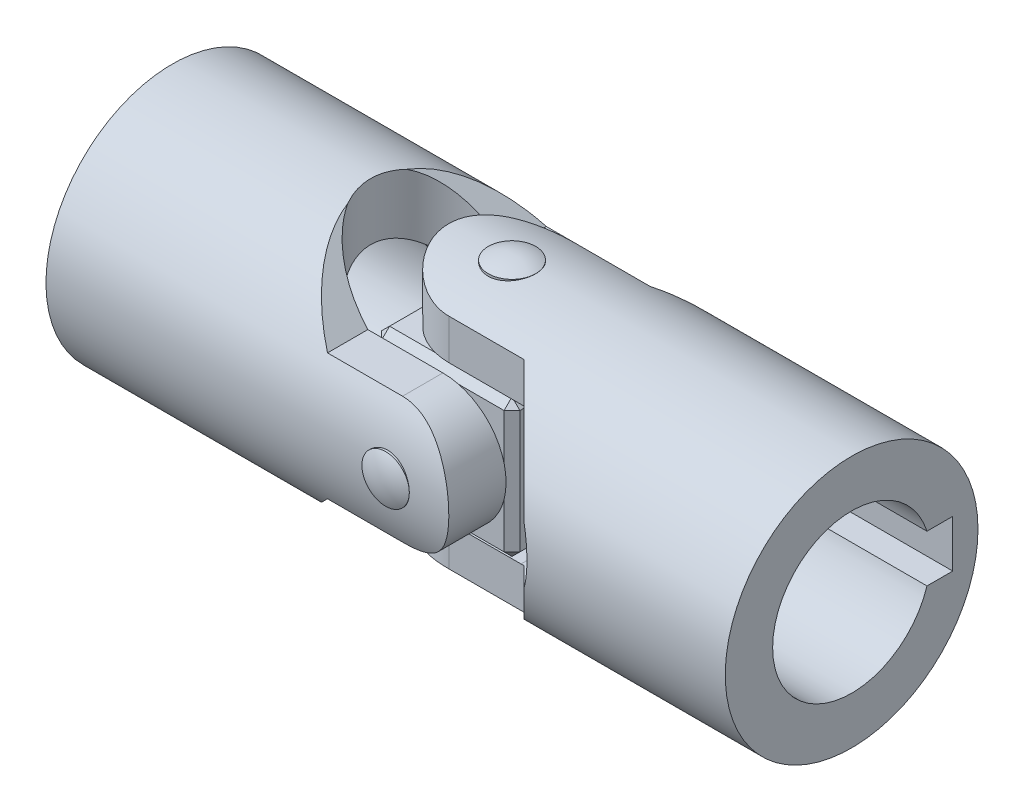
ISO-10303-21;
HEADER;
FILE_DESCRIPTION(('STEP AP214'),'2;1');
FILE_NAME('part.step','',(''),(''),'','','');
FILE_SCHEMA(('AUTOMOTIVE_DESIGN { 1 0 10303 214 1 1 1 1 }'));
ENDSEC;
DATA;
#1=APPLICATION_CONTEXT('core data for automotive mechanical design processes');
#2=APPLICATION_PROTOCOL_DEFINITION('international standard','automotive_design',2000,#1);
#3=PRODUCT_CONTEXT('',#1,'mechanical');
#4=PRODUCT('Part','Part','',(#3));
#5=PRODUCT_RELATED_PRODUCT_CATEGORY('part','',(#4));
#6=PRODUCT_DEFINITION_FORMATION('','',#4);
#7=PRODUCT_DEFINITION_CONTEXT('part definition',#1,'design');
#8=PRODUCT_DEFINITION('design','',#6,#7);
#9=PRODUCT_DEFINITION_SHAPE('','',#8);
#10=(LENGTH_UNIT() NAMED_UNIT(*) SI_UNIT(.MILLI.,.METRE.));
#11=(NAMED_UNIT(*) PLANE_ANGLE_UNIT() SI_UNIT($,.RADIAN.));
#12=(NAMED_UNIT(*) SI_UNIT($,.STERADIAN.) SOLID_ANGLE_UNIT());
#13=UNCERTAINTY_MEASURE_WITH_UNIT(LENGTH_MEASURE(1.E-05),#10,'distance_accuracy_value','');
#14=(GEOMETRIC_REPRESENTATION_CONTEXT(3) GLOBAL_UNCERTAINTY_ASSIGNED_CONTEXT((#13)) GLOBAL_UNIT_ASSIGNED_CONTEXT((#10,
#11,#12)) REPRESENTATION_CONTEXT('',''));
#15=CARTESIAN_POINT('',(0.,0.,0.));
#16=DIRECTION('',(0.,0.,1.));
#17=DIRECTION('',(1.,0.,0.));
#18=AXIS2_PLACEMENT_3D('',#15,#16,#17);
#19=CARTESIAN_POINT('',(0.,16.,0.));
#20=DIRECTION('',(0.,-1.,0.));
#21=DIRECTION('',(-1.,0.,0.));
#22=AXIS2_PLACEMENT_3D('',#19,#20,#21);
#23=CYLINDRICAL_SURFACE('',#22,3.);
#24=CARTESIAN_POINT('',(0.,16.,0.));
#25=DIRECTION('',(0.,1.,0.));
#26=DIRECTION('',(1.,0.,0.));
#27=AXIS2_PLACEMENT_3D('',#24,#25,#26);
#28=CIRCLE('',#27,3.);
#29=CARTESIAN_POINT('',(3.,16.,0.));
#30=VERTEX_POINT('',#29);
#31=EDGE_CURVE('P0_E10',#30,#30,#28,.T.);
#32=ORIENTED_EDGE('',*,*,#31,.F.);
#33=EDGE_LOOP('',(#32));
#34=FACE_BOUND('',#33,.T.);
#35=CARTESIAN_POINT('',(0.,-16.,0.));
#36=DIRECTION('',(0.,1.,0.));
#37=DIRECTION('',(0.,0.,1.));
#38=AXIS2_PLACEMENT_3D('',#35,#36,#37);
#39=CIRCLE('',#38,3.);
#40=CARTESIAN_POINT('',(0.,-16.,3.));
#41=VERTEX_POINT('',#40);
#42=EDGE_CURVE('P0_E20',#41,#41,#39,.T.);
#43=ORIENTED_EDGE('',*,*,#42,.T.);
#44=EDGE_LOOP('',(#43));
#45=FACE_BOUND('',#44,.T.);
#46=ADVANCED_FACE('P0_F14',(#34,#45),#23,.T.);
#47=CARTESIAN_POINT('',(0.,9.95330668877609,0.));
#48=DIRECTION('',(0.,1.,0.));
#49=DIRECTION('',(0.,0.,-1.));
#50=AXIS2_PLACEMENT_3D('',#47,#48,#49);
#51=SPHERICAL_SURFACE('',#50,6.75);
#52=ORIENTED_EDGE('',*,*,#31,.T.);
#53=EDGE_LOOP('',(#52));
#54=FACE_BOUND('',#53,.T.);
#55=ADVANCED_FACE('P0_F29',(#54),#51,.T.);
#56=CARTESIAN_POINT('',(0.,-9.95330668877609,0.));
#57=DIRECTION('',(0.,-1.,0.));
#58=DIRECTION('',(0.,0.,-1.));
#59=AXIS2_PLACEMENT_3D('',#56,#57,#58);
#60=SPHERICAL_SURFACE('',#59,6.75);
#61=ORIENTED_EDGE('',*,*,#42,.F.);
#62=EDGE_LOOP('',(#61));
#63=FACE_BOUND('',#62,.T.);
#64=ADVANCED_FACE('P0_F27',(#63),#60,.T.);
#65=CLOSED_SHELL('',(#46,#55,#64));
#66=MANIFOLD_SOLID_BREP('P0_B1',#65);
#67=CARTESIAN_POINT('',(0.,0.,16.));
#68=DIRECTION('',(0.,0.,-1.));
#69=DIRECTION('',(-1.,0.,0.));
#70=AXIS2_PLACEMENT_3D('',#67,#68,#69);
#71=CYLINDRICAL_SURFACE('',#70,3.);
#72=CARTESIAN_POINT('',(0.,0.,16.));
#73=DIRECTION('',(0.,0.,1.));
#74=DIRECTION('',(1.,0.,0.));
#75=AXIS2_PLACEMENT_3D('',#72,#73,#74);
#76=CIRCLE('',#75,3.);
#77=CARTESIAN_POINT('',(3.,0.,16.));
#78=VERTEX_POINT('',#77);
#79=EDGE_CURVE('P1_E10',#78,#78,#76,.T.);
#80=ORIENTED_EDGE('',*,*,#79,.F.);
#81=EDGE_LOOP('',(#80));
#82=FACE_BOUND('',#81,.T.);
#83=CARTESIAN_POINT('',(0.,0.,-16.));
#84=DIRECTION('',(0.,0.,1.));
#85=DIRECTION('',(0.,-1.,0.));
#86=AXIS2_PLACEMENT_3D('',#83,#84,#85);
#87=CIRCLE('',#86,3.);
#88=CARTESIAN_POINT('',(0.,-3.,-16.));
#89=VERTEX_POINT('',#88);
#90=EDGE_CURVE('P1_E20',#89,#89,#87,.T.);
#91=ORIENTED_EDGE('',*,*,#90,.T.);
#92=EDGE_LOOP('',(#91));
#93=FACE_BOUND('',#92,.T.);
#94=ADVANCED_FACE('P1_F14',(#82,#93),#71,.T.);
#95=CARTESIAN_POINT('',(0.,0.,9.95330668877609));
#96=DIRECTION('',(0.,0.,1.));
#97=DIRECTION('',(0.,1.,0.));
#98=AXIS2_PLACEMENT_3D('',#95,#96,#97);
#99=SPHERICAL_SURFACE('',#98,6.75);
#100=ORIENTED_EDGE('',*,*,#79,.T.);
#101=EDGE_LOOP('',(#100));
#102=FACE_BOUND('',#101,.T.);
#103=ADVANCED_FACE('P1_F29',(#102),#99,.T.);
#104=CARTESIAN_POINT('',(0.,0.,-9.95330668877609));
#105=DIRECTION('',(0.,0.,-1.));
#106=DIRECTION('',(0.,1.,0.));
#107=AXIS2_PLACEMENT_3D('',#104,#105,#106);
#108=SPHERICAL_SURFACE('',#107,6.75);
#109=ORIENTED_EDGE('',*,*,#90,.F.);
#110=EDGE_LOOP('',(#109));
#111=FACE_BOUND('',#110,.T.);
#112=ADVANCED_FACE('P1_F27',(#111),#108,.T.);
#113=CLOSED_SHELL('',(#94,#103,#112));
#114=MANIFOLD_SOLID_BREP('P1_B1',#113);
#115=CARTESIAN_POINT('',(0.,0.,8.75));
#116=DIRECTION('',(0.,0.,-1.));
#117=DIRECTION('',(-1.,0.,0.));
#118=AXIS2_PLACEMENT_3D('',#115,#116,#117);
#119=CYLINDRICAL_SURFACE('',#118,3.);
#120=CARTESIAN_POINT('',(0.,0.,0.));
#121=DIRECTION('',(0.,0.707106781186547,-0.707106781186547));
#122=DIRECTION('',(0.,-0.707106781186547,-0.707106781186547));
#123=AXIS2_PLACEMENT_3D('',#120,#121,#122);
#124=ELLIPSE('',#123,4.24264068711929,3.);
#125=CARTESIAN_POINT('',(3.,0.,0.));
#126=VERTEX_POINT('',#125);
#127=CARTESIAN_POINT('',(-3.,0.,0.));
#128=VERTEX_POINT('',#127);
#129=EDGE_CURVE('P2_E116',#126,#128,#124,.F.);
#130=ORIENTED_EDGE('',*,*,#129,.F.);
#131=CARTESIAN_POINT('',(0.,0.,0.));
#132=DIRECTION('',(0.,-0.707106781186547,-0.707106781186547));
#133=DIRECTION('',(0.,0.707106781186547,-0.707106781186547));
#134=AXIS2_PLACEMENT_3D('',#131,#132,#133);
#135=ELLIPSE('',#134,4.24264068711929,3.);
#136=EDGE_CURVE('P2_E120',#128,#126,#135,.F.);
#137=ORIENTED_EDGE('',*,*,#136,.F.);
#138=EDGE_LOOP('',(#130,#137));
#139=FACE_BOUND('',#138,.T.);
#140=CARTESIAN_POINT('',(0.,0.,8.75));
#141=DIRECTION('',(0.,0.,1.));
#142=DIRECTION('',(1.,0.,0.));
#143=AXIS2_PLACEMENT_3D('',#140,#141,#142);
#144=CIRCLE('',#143,3.);
#145=CARTESIAN_POINT('',(3.,0.,8.75));
#146=VERTEX_POINT('',#145);
#147=EDGE_CURVE('P2_E127',#146,#146,#144,.T.);
#148=ORIENTED_EDGE('',*,*,#147,.T.);
#149=EDGE_LOOP('',(#148));
#150=FACE_BOUND('',#149,.T.);
#151=ADVANCED_FACE('P2_F16',(#139,#150),#119,.F.);
#152=CARTESIAN_POINT('',(8.75,8.75,8.75));
#153=DIRECTION('',(0.,0.,1.));
#154=DIRECTION('',(1.,0.,0.));
#155=AXIS2_PLACEMENT_3D('',#152,#153,#154);
#156=PLANE('',#155);
#157=DIRECTION('',(0.,-1.,0.));
#158=VECTOR('',#157,1.);
#159=CARTESIAN_POINT('',(-7.75,-8.75,8.75));
#160=LINE('',#159,#158);
#161=CARTESIAN_POINT('',(-7.75,7.75,8.75));
#162=VERTEX_POINT('',#161);
#163=CARTESIAN_POINT('',(-7.75,-7.75,8.75));
#164=VERTEX_POINT('',#163);
#165=EDGE_CURVE('P2_E164',#162,#164,#160,.T.);
#166=ORIENTED_EDGE('',*,*,#165,.T.);
#167=DIRECTION('',(1.,0.,0.));
#168=VECTOR('',#167,1.);
#169=CARTESIAN_POINT('',(8.75,-7.75,8.75));
#170=LINE('',#169,#168);
#171=CARTESIAN_POINT('',(7.75,-7.75,8.75));
#172=VERTEX_POINT('',#171);
#173=EDGE_CURVE('P2_E168',#164,#172,#170,.T.);
#174=ORIENTED_EDGE('',*,*,#173,.T.);
#175=DIRECTION('',(0.,1.,0.));
#176=VECTOR('',#175,1.);
#177=CARTESIAN_POINT('',(7.75,8.75,8.75));
#178=LINE('',#177,#176);
#179=CARTESIAN_POINT('',(7.75,7.75,8.75));
#180=VERTEX_POINT('',#179);
#181=EDGE_CURVE('P2_E166',#172,#180,#178,.T.);
#182=ORIENTED_EDGE('',*,*,#181,.T.);
#183=DIRECTION('',(-1.,0.,0.));
#184=VECTOR('',#183,1.);
#185=CARTESIAN_POINT('',(-8.75,7.75,8.75));
#186=LINE('',#185,#184);
#187=EDGE_CURVE('P2_E162',#180,#162,#186,.T.);
#188=ORIENTED_EDGE('',*,*,#187,.T.);
#189=EDGE_LOOP('',(#166,#174,#182,#188));
#190=FACE_BOUND('',#189,.T.);
#191=ORIENTED_EDGE('',*,*,#147,.F.);
#192=EDGE_LOOP('',(#191));
#193=FACE_BOUND('',#192,.T.);
#194=ADVANCED_FACE('P2_F282',(#190,#193),#156,.T.);
#195=CARTESIAN_POINT('',(8.75,8.75,-8.75));
#196=DIRECTION('',(0.,0.,1.));
#197=DIRECTION('',(1.,0.,0.));
#198=AXIS2_PLACEMENT_3D('',#195,#196,#197);
#199=PLANE('',#198);
#200=DIRECTION('',(-1.,0.,0.));
#201=VECTOR('',#200,1.);
#202=CARTESIAN_POINT('',(8.75,-7.74999999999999,-8.75));
#203=LINE('',#202,#201);
#204=CARTESIAN_POINT('',(7.74999999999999,-7.74999999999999,-8.75));
#205=VERTEX_POINT('',#204);
#206=CARTESIAN_POINT('',(-7.74999999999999,-7.74999999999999,-8.75));
#207=VERTEX_POINT('',#206);
#208=EDGE_CURVE('P2_E157',#205,#207,#203,.T.);
#209=ORIENTED_EDGE('',*,*,#208,.T.);
#210=DIRECTION('',(0.,1.,0.));
#211=VECTOR('',#210,1.);
#212=CARTESIAN_POINT('',(-7.74999999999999,8.75,-8.75));
#213=LINE('',#212,#211);
#214=CARTESIAN_POINT('',(-7.74999999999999,7.75,-8.75));
#215=VERTEX_POINT('',#214);
#216=EDGE_CURVE('P2_E159',#207,#215,#213,.T.);
#217=ORIENTED_EDGE('',*,*,#216,.T.);
#218=DIRECTION('',(1.,0.,0.));
#219=VECTOR('',#218,1.);
#220=CARTESIAN_POINT('',(8.75,7.75,-8.75));
#221=LINE('',#220,#219);
#222=CARTESIAN_POINT('',(7.74999999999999,7.75,-8.75));
#223=VERTEX_POINT('',#222);
#224=EDGE_CURVE('P2_E153',#215,#223,#221,.T.);
#225=ORIENTED_EDGE('',*,*,#224,.T.);
#226=DIRECTION('',(0.,-1.,0.));
#227=VECTOR('',#226,1.);
#228=CARTESIAN_POINT('',(7.74999999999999,8.75,-8.75));
#229=LINE('',#228,#227);
#230=EDGE_CURVE('P2_E155',#223,#205,#229,.T.);
#231=ORIENTED_EDGE('',*,*,#230,.T.);
#232=EDGE_LOOP('',(#209,#217,#225,#231));
#233=FACE_BOUND('',#232,.T.);
#234=CARTESIAN_POINT('',(0.,0.,-8.75));
#235=DIRECTION('',(0.,0.,1.));
#236=DIRECTION('',(1.,0.,0.));
#237=AXIS2_PLACEMENT_3D('',#234,#235,#236);
#238=CIRCLE('',#237,3.);
#239=CARTESIAN_POINT('',(3.,0.,-8.75));
#240=VERTEX_POINT('',#239);
#241=EDGE_CURVE('P2_E259',#240,#240,#238,.T.);
#242=ORIENTED_EDGE('',*,*,#241,.T.);
#243=EDGE_LOOP('',(#242));
#244=FACE_BOUND('',#243,.T.);
#245=ADVANCED_FACE('P2_F267',(#233,#244),#199,.F.);
#246=CARTESIAN_POINT('',(-8.75,8.75,8.75));
#247=DIRECTION('',(0.,-1.,0.));
#248=DIRECTION('',(0.,0.,-1.));
#249=AXIS2_PLACEMENT_3D('',#246,#247,#248);
#250=PLANE('',#249);
#251=DIRECTION('',(-1.,0.,0.));
#252=VECTOR('',#251,1.);
#253=CARTESIAN_POINT('',(-8.75,8.75,-7.74999999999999));
#254=LINE('',#253,#252);
#255=CARTESIAN_POINT('',(7.74999999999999,8.75,-7.74999999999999));
#256=VERTEX_POINT('',#255);
#257=CARTESIAN_POINT('',(-7.74999999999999,8.75,-7.74999999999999));
#258=VERTEX_POINT('',#257);
#259=EDGE_CURVE('P2_E25',#256,#258,#254,.T.);
#260=ORIENTED_EDGE('',*,*,#259,.T.);
#261=DIRECTION('',(0.,0.,1.));
#262=VECTOR('',#261,1.);
#263=CARTESIAN_POINT('',(-7.74999999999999,8.75,8.75));
#264=LINE('',#263,#262);
#265=CARTESIAN_POINT('',(-7.74999999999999,8.75,7.74999999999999));
#266=VERTEX_POINT('',#265);
#267=EDGE_CURVE('P2_E11',#258,#266,#264,.T.);
#268=ORIENTED_EDGE('',*,*,#267,.T.);
#269=DIRECTION('',(1.,0.,0.));
#270=VECTOR('',#269,1.);
#271=CARTESIAN_POINT('',(8.75,8.75,7.74999999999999));
#272=LINE('',#271,#270);
#273=CARTESIAN_POINT('',(7.74999999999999,8.75,7.74999999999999));
#274=VERTEX_POINT('',#273);
#275=EDGE_CURVE('P2_E180',#266,#274,#272,.T.);
#276=ORIENTED_EDGE('',*,*,#275,.T.);
#277=DIRECTION('',(0.,0.,-1.));
#278=VECTOR('',#277,1.);
#279=CARTESIAN_POINT('',(7.74999999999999,8.75,8.75));
#280=LINE('',#279,#278);
#281=EDGE_CURVE('P2_E36',#274,#256,#280,.T.);
#282=ORIENTED_EDGE('',*,*,#281,.T.);
#283=EDGE_LOOP('',(#260,#268,#276,#282));
#284=FACE_BOUND('',#283,.T.);
#285=CARTESIAN_POINT('',(0.,8.75,0.));
#286=DIRECTION('',(0.,1.,0.));
#287=DIRECTION('',(0.,0.,1.));
#288=AXIS2_PLACEMENT_3D('',#285,#286,#287);
#289=CIRCLE('',#288,3.);
#290=CARTESIAN_POINT('',(0.,8.75,3.));
#291=VERTEX_POINT('',#290);
#292=EDGE_CURVE('P2_E249',#291,#291,#289,.T.);
#293=ORIENTED_EDGE('',*,*,#292,.F.);
#294=EDGE_LOOP('',(#293));
#295=FACE_BOUND('',#294,.T.);
#296=ADVANCED_FACE('P2_F290',(#284,#295),#250,.F.);
#297=CARTESIAN_POINT('',(-8.75,-8.75,8.75));
#298=DIRECTION('',(1.,0.,0.));
#299=DIRECTION('',(0.,0.,-1.));
#300=AXIS2_PLACEMENT_3D('',#297,#298,#299);
#301=PLANE('',#300);
#302=DIRECTION('',(0.,-1.,0.));
#303=VECTOR('',#302,1.);
#304=CARTESIAN_POINT('',(-8.75,-8.75,-7.75));
#305=LINE('',#304,#303);
#306=CARTESIAN_POINT('',(-8.75,7.75,-7.75));
#307=VERTEX_POINT('',#306);
#308=CARTESIAN_POINT('',(-8.75,-7.74999999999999,-7.75));
#309=VERTEX_POINT('',#308);
#310=EDGE_CURVE('P2_E148',#307,#309,#305,.T.);
#311=ORIENTED_EDGE('',*,*,#310,.T.);
#312=DIRECTION('',(0.,0.,1.));
#313=VECTOR('',#312,1.);
#314=CARTESIAN_POINT('',(-8.75,-7.74999999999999,8.75));
#315=LINE('',#314,#313);
#316=CARTESIAN_POINT('',(-8.75,-7.74999999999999,7.74999999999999));
#317=VERTEX_POINT('',#316);
#318=EDGE_CURVE('P2_E150',#309,#317,#315,.T.);
#319=ORIENTED_EDGE('',*,*,#318,.T.);
#320=DIRECTION('',(0.,1.,0.));
#321=VECTOR('',#320,1.);
#322=CARTESIAN_POINT('',(-8.75,8.75,7.74999999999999));
#323=LINE('',#322,#321);
#324=CARTESIAN_POINT('',(-8.75,7.75,7.74999999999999));
#325=VERTEX_POINT('',#324);
#326=EDGE_CURVE('P2_E146',#317,#325,#323,.T.);
#327=ORIENTED_EDGE('',*,*,#326,.T.);
#328=DIRECTION('',(0.,0.,-1.));
#329=VECTOR('',#328,1.);
#330=CARTESIAN_POINT('',(-8.75,7.75,8.75));
#331=LINE('',#330,#329);
#332=EDGE_CURVE('P2_E144',#325,#307,#331,.T.);
#333=ORIENTED_EDGE('',*,*,#332,.T.);
#334=EDGE_LOOP('',(#311,#319,#327,#333));
#335=FACE_BOUND('',#334,.T.);
#336=ADVANCED_FACE('P2_F297',(#335),#301,.F.);
#337=CARTESIAN_POINT('',(-8.75,-8.75,8.75));
#338=DIRECTION('',(0.,1.,0.));
#339=DIRECTION('',(0.,0.,1.));
#340=AXIS2_PLACEMENT_3D('',#337,#338,#339);
#341=PLANE('',#340);
#342=DIRECTION('',(-1.,0.,0.));
#343=VECTOR('',#342,1.);
#344=CARTESIAN_POINT('',(-8.75,-8.75,7.74999999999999));
#345=LINE('',#344,#343);
#346=CARTESIAN_POINT('',(7.74999999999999,-8.75,7.74999999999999));
#347=VERTEX_POINT('',#346);
#348=CARTESIAN_POINT('',(-7.75,-8.75,7.74999999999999));
#349=VERTEX_POINT('',#348);
#350=EDGE_CURVE('P2_E137',#347,#349,#345,.T.);
#351=ORIENTED_EDGE('',*,*,#350,.T.);
#352=DIRECTION('',(0.,0.,-1.));
#353=VECTOR('',#352,1.);
#354=CARTESIAN_POINT('',(-7.75,-8.75,8.75));
#355=LINE('',#354,#353);
#356=CARTESIAN_POINT('',(-7.75,-8.75,-7.75));
#357=VERTEX_POINT('',#356);
#358=EDGE_CURVE('P2_E141',#349,#357,#355,.T.);
#359=ORIENTED_EDGE('',*,*,#358,.T.);
#360=DIRECTION('',(1.,0.,0.));
#361=VECTOR('',#360,1.);
#362=CARTESIAN_POINT('',(-8.75,-8.75,-7.75));
#363=LINE('',#362,#361);
#364=CARTESIAN_POINT('',(7.74999999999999,-8.75,-7.75));
#365=VERTEX_POINT('',#364);
#366=EDGE_CURVE('P2_E139',#357,#365,#363,.T.);
#367=ORIENTED_EDGE('',*,*,#366,.T.);
#368=DIRECTION('',(0.,0.,1.));
#369=VECTOR('',#368,1.);
#370=CARTESIAN_POINT('',(7.74999999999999,-8.75,8.75));
#371=LINE('',#370,#369);
#372=EDGE_CURVE('P2_E130',#365,#347,#371,.T.);
#373=ORIENTED_EDGE('',*,*,#372,.T.);
#374=EDGE_LOOP('',(#351,#359,#367,#373));
#375=FACE_BOUND('',#374,.T.);
#376=CARTESIAN_POINT('',(0.,-8.75,0.));
#377=DIRECTION('',(0.,1.,0.));
#378=DIRECTION('',(0.,0.,1.));
#379=AXIS2_PLACEMENT_3D('',#376,#377,#378);
#380=CIRCLE('',#379,3.);
#381=CARTESIAN_POINT('',(0.,-8.75,3.));
#382=VERTEX_POINT('',#381);
#383=EDGE_CURVE('P2_E255',#382,#382,#380,.T.);
#384=ORIENTED_EDGE('',*,*,#383,.T.);
#385=EDGE_LOOP('',(#384));
#386=FACE_BOUND('',#385,.T.);
#387=ADVANCED_FACE('P2_F277',(#375,#386),#341,.F.);
#388=CARTESIAN_POINT('',(8.75,-8.75,8.75));
#389=DIRECTION('',(-1.,0.,0.));
#390=DIRECTION('',(0.,0.,1.));
#391=AXIS2_PLACEMENT_3D('',#388,#389,#390);
#392=PLANE('',#391);
#393=DIRECTION('',(0.,-1.,0.));
#394=VECTOR('',#393,1.);
#395=CARTESIAN_POINT('',(8.75,-8.75,7.74999999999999));
#396=LINE('',#395,#394);
#397=CARTESIAN_POINT('',(8.75,7.75,7.74999999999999));
#398=VERTEX_POINT('',#397);
#399=CARTESIAN_POINT('',(8.75,-7.75,7.74999999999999));
#400=VERTEX_POINT('',#399);
#401=EDGE_CURVE('P2_E173',#398,#400,#396,.T.);
#402=ORIENTED_EDGE('',*,*,#401,.T.);
#403=DIRECTION('',(0.,0.,-1.));
#404=VECTOR('',#403,1.);
#405=CARTESIAN_POINT('',(8.75,-7.75,8.75));
#406=LINE('',#405,#404);
#407=CARTESIAN_POINT('',(8.75,-7.75,-7.75));
#408=VERTEX_POINT('',#407);
#409=EDGE_CURVE('P2_E177',#400,#408,#406,.T.);
#410=ORIENTED_EDGE('',*,*,#409,.T.);
#411=DIRECTION('',(0.,1.,0.));
#412=VECTOR('',#411,1.);
#413=CARTESIAN_POINT('',(8.75,-8.75,-7.75));
#414=LINE('',#413,#412);
#415=CARTESIAN_POINT('',(8.75,7.75,-7.75));
#416=VERTEX_POINT('',#415);
#417=EDGE_CURVE('P2_E175',#408,#416,#414,.T.);
#418=ORIENTED_EDGE('',*,*,#417,.T.);
#419=DIRECTION('',(0.,0.,1.));
#420=VECTOR('',#419,1.);
#421=CARTESIAN_POINT('',(8.75,7.75,8.75));
#422=LINE('',#421,#420);
#423=EDGE_CURVE('P2_E171',#416,#398,#422,.T.);
#424=ORIENTED_EDGE('',*,*,#423,.T.);
#425=EDGE_LOOP('',(#402,#410,#418,#424));
#426=FACE_BOUND('',#425,.T.);
#427=ADVANCED_FACE('P2_F269',(#426),#392,.F.);
#428=CARTESIAN_POINT('',(0.,0.,0.));
#429=DIRECTION('',(0.,0.707106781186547,-0.707106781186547));
#430=DIRECTION('',(0.,-0.707106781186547,-0.707106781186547));
#431=AXIS2_PLACEMENT_3D('',#428,#429,#430);
#432=ELLIPSE('',#431,4.24264068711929,3.);
#433=EDGE_CURVE('P2_E119',#126,#128,#432,.T.);
#434=ORIENTED_EDGE('',*,*,#433,.F.);
#435=CARTESIAN_POINT('',(0.,0.,0.));
#436=DIRECTION('',(0.,-0.707106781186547,-0.707106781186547));
#437=DIRECTION('',(0.,0.707106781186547,-0.707106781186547));
#438=AXIS2_PLACEMENT_3D('',#435,#436,#437);
#439=ELLIPSE('',#438,4.24264068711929,3.);
#440=EDGE_CURVE('P2_E111',#128,#126,#439,.T.);
#441=ORIENTED_EDGE('',*,*,#440,.F.);
#442=EDGE_LOOP('',(#434,#441));
#443=FACE_BOUND('',#442,.T.);
#444=ORIENTED_EDGE('',*,*,#241,.F.);
#445=EDGE_LOOP('',(#444));
#446=FACE_BOUND('',#445,.T.);
#447=ADVANCED_FACE('P2_F132',(#443,#446),#119,.F.);
#448=CARTESIAN_POINT('',(0.,-8.75,0.));
#449=DIRECTION('',(0.,1.,0.));
#450=DIRECTION('',(0.,0.,1.));
#451=AXIS2_PLACEMENT_3D('',#448,#449,#450);
#452=CYLINDRICAL_SURFACE('',#451,3.);
#453=ORIENTED_EDGE('',*,*,#433,.T.);
#454=ORIENTED_EDGE('',*,*,#136,.T.);
#455=EDGE_LOOP('',(#453,#454));
#456=FACE_BOUND('',#455,.T.);
#457=ORIENTED_EDGE('',*,*,#383,.F.);
#458=EDGE_LOOP('',(#457));
#459=FACE_BOUND('',#458,.T.);
#460=ADVANCED_FACE('P2_F124',(#456,#459),#452,.F.);
#461=ORIENTED_EDGE('',*,*,#129,.T.);
#462=ORIENTED_EDGE('',*,*,#440,.T.);
#463=EDGE_LOOP('',(#461,#462));
#464=FACE_BOUND('',#463,.T.);
#465=ORIENTED_EDGE('',*,*,#292,.T.);
#466=EDGE_LOOP('',(#465));
#467=FACE_BOUND('',#466,.T.);
#468=ADVANCED_FACE('P2_F113',(#464,#467),#452,.F.);
#469=CARTESIAN_POINT('',(7.74999999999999,8.75,8.75));
#470=DIRECTION('',(-0.707106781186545,-0.70710678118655,0.));
#471=DIRECTION('',(0.70710678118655,-0.707106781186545,0.));
#472=AXIS2_PLACEMENT_3D('',#469,#470,#471);
#473=PLANE('',#472);
#474=DIRECTION('',(0.70710678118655,-0.707106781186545,0.));
#475=VECTOR('',#474,1.);
#476=CARTESIAN_POINT('',(8.25,8.25,7.74999999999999));
#477=LINE('',#476,#475);
#478=EDGE_CURVE('P2_E20',#398,#274,#477,.F.);
#479=ORIENTED_EDGE('',*,*,#478,.F.);
#480=ORIENTED_EDGE('',*,*,#423,.F.);
#481=DIRECTION('',(-0.70710678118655,0.707106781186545,0.));
#482=VECTOR('',#481,1.);
#483=CARTESIAN_POINT('',(8.75,7.75,-7.75));
#484=LINE('',#483,#482);
#485=EDGE_CURVE('P2_E243',#256,#416,#484,.F.);
#486=ORIENTED_EDGE('',*,*,#485,.F.);
#487=ORIENTED_EDGE('',*,*,#281,.F.);
#488=EDGE_LOOP('',(#479,#480,#486,#487));
#489=FACE_BOUND('',#488,.T.);
#490=ADVANCED_FACE('P2_F18',(#489),#473,.F.);
#491=CARTESIAN_POINT('',(7.75,7.75,8.75));
#492=DIRECTION('',(0.577350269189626,0.57735026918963,0.577350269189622));
#493=DIRECTION('',(-0.70710678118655,0.707106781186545,0.));
#494=AXIS2_PLACEMENT_3D('',#491,#492,#493);
#495=PLANE('',#494);
#496=DIRECTION('',(0.707106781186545,0.,-0.70710678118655));
#497=VECTOR('',#496,1.);
#498=CARTESIAN_POINT('',(7.75,7.75,8.75));
#499=LINE('',#498,#497);
#500=EDGE_CURVE('P2_E238',#398,#180,#499,.F.);
#501=ORIENTED_EDGE('',*,*,#500,.F.);
#502=ORIENTED_EDGE('',*,*,#478,.T.);
#503=DIRECTION('',(0.,-0.707106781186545,0.70710678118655));
#504=VECTOR('',#503,1.);
#505=CARTESIAN_POINT('',(7.75,7.75,8.75));
#506=LINE('',#505,#504);
#507=EDGE_CURVE('P2_E241',#180,#274,#506,.F.);
#508=ORIENTED_EDGE('',*,*,#507,.F.);
#509=EDGE_LOOP('',(#501,#502,#508));
#510=FACE_BOUND('',#509,.T.);
#511=ADVANCED_FACE('P2_F374',(#510),#495,.T.);
#512=CARTESIAN_POINT('',(8.75,7.75,-7.75));
#513=DIRECTION('',(0.577350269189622,0.57735026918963,-0.577350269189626));
#514=DIRECTION('',(0.,0.707106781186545,0.70710678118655));
#515=AXIS2_PLACEMENT_3D('',#512,#513,#514);
#516=PLANE('',#515);
#517=DIRECTION('',(0.,-0.707106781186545,-0.70710678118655));
#518=VECTOR('',#517,1.);
#519=CARTESIAN_POINT('',(7.74999999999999,8.25,-8.25));
#520=LINE('',#519,#518);
#521=EDGE_CURVE('P2_E232',#256,#223,#520,.T.);
#522=ORIENTED_EDGE('',*,*,#521,.F.);
#523=ORIENTED_EDGE('',*,*,#485,.T.);
#524=DIRECTION('',(0.70710678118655,0.,0.707106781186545));
#525=VECTOR('',#524,1.);
#526=CARTESIAN_POINT('',(8.75,7.75,-7.75));
#527=LINE('',#526,#525);
#528=EDGE_CURVE('P2_E235',#223,#416,#527,.T.);
#529=ORIENTED_EDGE('',*,*,#528,.F.);
#530=EDGE_LOOP('',(#522,#523,#529));
#531=FACE_BOUND('',#530,.T.);
#532=ADVANCED_FACE('P2_F371',(#531),#516,.T.);
#533=CARTESIAN_POINT('',(8.75,7.75,8.75));
#534=DIRECTION('',(0.,0.70710678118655,0.707106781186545));
#535=DIRECTION('',(0.,-0.707106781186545,0.70710678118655));
#536=AXIS2_PLACEMENT_3D('',#533,#534,#535);
#537=PLANE('',#536);
#538=ORIENTED_EDGE('',*,*,#507,.T.);
#539=ORIENTED_EDGE('',*,*,#275,.F.);
#540=DIRECTION('',(0.,0.707106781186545,-0.70710678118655));
#541=VECTOR('',#540,1.);
#542=CARTESIAN_POINT('',(-7.75,8.25,8.25));
#543=LINE('',#542,#541);
#544=EDGE_CURVE('P2_E227',#162,#266,#543,.T.);
#545=ORIENTED_EDGE('',*,*,#544,.F.);
#546=ORIENTED_EDGE('',*,*,#187,.F.);
#547=EDGE_LOOP('',(#538,#539,#545,#546));
#548=FACE_BOUND('',#547,.T.);
#549=ADVANCED_FACE('P2_F367',(#548),#537,.T.);
#550=CARTESIAN_POINT('',(7.75,8.75,8.75));
#551=DIRECTION('',(0.70710678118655,0.,0.707106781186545));
#552=DIRECTION('',(0.707106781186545,0.,-0.70710678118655));
#553=AXIS2_PLACEMENT_3D('',#550,#551,#552);
#554=PLANE('',#553);
#555=ORIENTED_EDGE('',*,*,#500,.T.);
#556=ORIENTED_EDGE('',*,*,#181,.F.);
#557=DIRECTION('',(-0.707106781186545,0.,0.70710678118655));
#558=VECTOR('',#557,1.);
#559=CARTESIAN_POINT('',(7.75,-7.75,8.75));
#560=LINE('',#559,#558);
#561=EDGE_CURVE('P2_E224',#400,#172,#560,.T.);
#562=ORIENTED_EDGE('',*,*,#561,.F.);
#563=ORIENTED_EDGE('',*,*,#401,.F.);
#564=EDGE_LOOP('',(#555,#556,#562,#563));
#565=FACE_BOUND('',#564,.T.);
#566=ADVANCED_FACE('P2_F363',(#565),#554,.T.);
#567=CARTESIAN_POINT('',(8.75,-7.75,8.75));
#568=DIRECTION('',(-0.707106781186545,0.70710678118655,0.));
#569=DIRECTION('',(-0.70710678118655,-0.707106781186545,0.));
#570=AXIS2_PLACEMENT_3D('',#567,#568,#569);
#571=PLANE('',#570);
#572=DIRECTION('',(0.70710678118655,0.707106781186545,0.));
#573=VECTOR('',#572,1.);
#574=CARTESIAN_POINT('',(7.74999999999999,-8.75,-7.75));
#575=LINE('',#574,#573);
#576=EDGE_CURVE('P2_E218',#408,#365,#575,.F.);
#577=ORIENTED_EDGE('',*,*,#576,.F.);
#578=ORIENTED_EDGE('',*,*,#409,.F.);
#579=DIRECTION('',(-0.70710678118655,-0.707106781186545,0.));
#580=VECTOR('',#579,1.);
#581=CARTESIAN_POINT('',(8.25,-8.25,7.74999999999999));
#582=LINE('',#581,#580);
#583=EDGE_CURVE('P2_E221',#347,#400,#582,.F.);
#584=ORIENTED_EDGE('',*,*,#583,.F.);
#585=ORIENTED_EDGE('',*,*,#372,.F.);
#586=EDGE_LOOP('',(#577,#578,#584,#585));
#587=FACE_BOUND('',#586,.T.);
#588=ADVANCED_FACE('P2_F359',(#587),#571,.F.);
#589=CARTESIAN_POINT('',(8.75,-8.75,-7.75));
#590=DIRECTION('',(-0.707106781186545,0.,0.70710678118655));
#591=DIRECTION('',(0.70710678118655,0.,0.707106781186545));
#592=AXIS2_PLACEMENT_3D('',#589,#590,#591);
#593=PLANE('',#592);
#594=ORIENTED_EDGE('',*,*,#528,.T.);
#595=ORIENTED_EDGE('',*,*,#417,.F.);
#596=DIRECTION('',(-0.70710678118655,0.,-0.707106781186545));
#597=VECTOR('',#596,1.);
#598=CARTESIAN_POINT('',(8.25,-7.75,-8.25));
#599=LINE('',#598,#597);
#600=EDGE_CURVE('P2_E216',#205,#408,#599,.F.);
#601=ORIENTED_EDGE('',*,*,#600,.F.);
#602=ORIENTED_EDGE('',*,*,#230,.F.);
#603=EDGE_LOOP('',(#594,#595,#601,#602));
#604=FACE_BOUND('',#603,.T.);
#605=ADVANCED_FACE('P2_F355',(#604),#593,.F.);
#606=CARTESIAN_POINT('',(-8.75,8.75,-7.74999999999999));
#607=DIRECTION('',(0.,-0.70710678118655,0.707106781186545));
#608=DIRECTION('',(0.,-0.707106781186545,-0.70710678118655));
#609=AXIS2_PLACEMENT_3D('',#606,#607,#608);
#610=PLANE('',#609);
#611=ORIENTED_EDGE('',*,*,#521,.T.);
#612=ORIENTED_EDGE('',*,*,#224,.F.);
#613=DIRECTION('',(0.,0.707106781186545,0.70710678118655));
#614=VECTOR('',#613,1.);
#615=CARTESIAN_POINT('',(-7.74999999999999,7.75,-8.75));
#616=LINE('',#615,#614);
#617=EDGE_CURVE('P2_E213',#258,#215,#616,.F.);
#618=ORIENTED_EDGE('',*,*,#617,.F.);
#619=ORIENTED_EDGE('',*,*,#259,.F.);
#620=EDGE_LOOP('',(#611,#612,#618,#619));
#621=FACE_BOUND('',#620,.T.);
#622=ADVANCED_FACE('P2_F351',(#621),#610,.F.);
#623=CARTESIAN_POINT('',(-8.75,7.75,8.75));
#624=DIRECTION('',(0.707106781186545,-0.70710678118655,0.));
#625=DIRECTION('',(0.70710678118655,0.707106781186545,0.));
#626=AXIS2_PLACEMENT_3D('',#623,#624,#625);
#627=PLANE('',#626);
#628=DIRECTION('',(0.70710678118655,0.707106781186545,0.));
#629=VECTOR('',#628,1.);
#630=CARTESIAN_POINT('',(-8.75,7.75,7.74999999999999));
#631=LINE('',#630,#629);
#632=EDGE_CURVE('P2_E229',#266,#325,#631,.F.);
#633=ORIENTED_EDGE('',*,*,#632,.F.);
#634=ORIENTED_EDGE('',*,*,#267,.F.);
#635=DIRECTION('',(-0.70710678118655,-0.707106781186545,0.));
#636=VECTOR('',#635,1.);
#637=CARTESIAN_POINT('',(-8.25,8.25,-7.75));
#638=LINE('',#637,#636);
#639=EDGE_CURVE('P2_E210',#307,#258,#638,.F.);
#640=ORIENTED_EDGE('',*,*,#639,.F.);
#641=ORIENTED_EDGE('',*,*,#332,.F.);
#642=EDGE_LOOP('',(#633,#634,#640,#641));
#643=FACE_BOUND('',#642,.T.);
#644=ADVANCED_FACE('P2_F347',(#643),#627,.F.);
#645=CARTESIAN_POINT('',(-8.75,7.75,7.74999999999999));
#646=DIRECTION('',(-0.577350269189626,0.57735026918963,0.577350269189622));
#647=DIRECTION('',(-0.70710678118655,-0.707106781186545,0.));
#648=AXIS2_PLACEMENT_3D('',#645,#646,#647);
#649=PLANE('',#648);
#650=ORIENTED_EDGE('',*,*,#544,.T.);
#651=ORIENTED_EDGE('',*,*,#632,.T.);
#652=DIRECTION('',(0.707106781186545,0.,0.70710678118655));
#653=VECTOR('',#652,1.);
#654=CARTESIAN_POINT('',(-8.75,7.75,7.74999999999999));
#655=LINE('',#654,#653);
#656=EDGE_CURVE('P2_E207',#162,#325,#655,.F.);
#657=ORIENTED_EDGE('',*,*,#656,.F.);
#658=EDGE_LOOP('',(#650,#651,#657));
#659=FACE_BOUND('',#658,.T.);
#660=ADVANCED_FACE('P2_F343',(#659),#649,.T.);
#661=CARTESIAN_POINT('',(7.75,-7.75,8.75));
#662=DIRECTION('',(0.577350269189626,-0.57735026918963,0.577350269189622));
#663=DIRECTION('',(0.70710678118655,0.707106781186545,0.));
#664=AXIS2_PLACEMENT_3D('',#661,#662,#663);
#665=PLANE('',#664);
#666=ORIENTED_EDGE('',*,*,#583,.T.);
#667=ORIENTED_EDGE('',*,*,#561,.T.);
#668=DIRECTION('',(0.,-0.707106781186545,-0.70710678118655));
#669=VECTOR('',#668,1.);
#670=CARTESIAN_POINT('',(7.75,-7.75,8.75));
#671=LINE('',#670,#669);
#672=EDGE_CURVE('P2_E205',#347,#172,#671,.F.);
#673=ORIENTED_EDGE('',*,*,#672,.F.);
#674=EDGE_LOOP('',(#666,#667,#673));
#675=FACE_BOUND('',#674,.T.);
#676=ADVANCED_FACE('P2_F339',(#675),#665,.T.);
#677=CARTESIAN_POINT('',(7.74999999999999,-8.75,-7.75));
#678=DIRECTION('',(0.577350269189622,-0.577350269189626,-0.57735026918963));
#679=DIRECTION('',(0.,0.70710678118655,-0.707106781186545));
#680=AXIS2_PLACEMENT_3D('',#677,#678,#679);
#681=PLANE('',#680);
#682=ORIENTED_EDGE('',*,*,#600,.T.);
#683=ORIENTED_EDGE('',*,*,#576,.T.);
#684=DIRECTION('',(0.,-0.70710678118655,0.707106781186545));
#685=VECTOR('',#684,1.);
#686=CARTESIAN_POINT('',(7.74999999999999,-8.75,-7.75));
#687=LINE('',#686,#685);
#688=EDGE_CURVE('P2_E202',#205,#365,#687,.T.);
#689=ORIENTED_EDGE('',*,*,#688,.F.);
#690=EDGE_LOOP('',(#682,#683,#689));
#691=FACE_BOUND('',#690,.T.);
#692=ADVANCED_FACE('P2_F335',(#691),#681,.T.);
#693=CARTESIAN_POINT('',(-7.74999999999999,7.75,-8.75));
#694=DIRECTION('',(-0.577350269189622,0.57735026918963,-0.577350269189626));
#695=DIRECTION('',(0.,0.707106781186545,0.70710678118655));
#696=AXIS2_PLACEMENT_3D('',#693,#694,#695);
#697=PLANE('',#696);
#698=ORIENTED_EDGE('',*,*,#639,.T.);
#699=ORIENTED_EDGE('',*,*,#617,.T.);
#700=DIRECTION('',(0.70710678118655,0.,-0.707106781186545));
#701=VECTOR('',#700,1.);
#702=CARTESIAN_POINT('',(-7.74999999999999,7.75,-8.75));
#703=LINE('',#702,#701);
#704=EDGE_CURVE('P2_E200',#307,#215,#703,.T.);
#705=ORIENTED_EDGE('',*,*,#704,.F.);
#706=EDGE_LOOP('',(#698,#699,#705));
#707=FACE_BOUND('',#706,.T.);
#708=ADVANCED_FACE('P2_F331',(#707),#697,.T.);
#709=CARTESIAN_POINT('',(-7.75,8.75,8.75));
#710=DIRECTION('',(-0.70710678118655,0.,0.707106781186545));
#711=DIRECTION('',(0.707106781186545,0.,0.70710678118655));
#712=AXIS2_PLACEMENT_3D('',#709,#710,#711);
#713=PLANE('',#712);
#714=ORIENTED_EDGE('',*,*,#656,.T.);
#715=ORIENTED_EDGE('',*,*,#326,.F.);
#716=DIRECTION('',(-0.707106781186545,0.,-0.70710678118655));
#717=VECTOR('',#716,1.);
#718=CARTESIAN_POINT('',(-8.75,-7.74999999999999,7.74999999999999));
#719=LINE('',#718,#717);
#720=EDGE_CURVE('P2_E197',#164,#317,#719,.T.);
#721=ORIENTED_EDGE('',*,*,#720,.F.);
#722=ORIENTED_EDGE('',*,*,#165,.F.);
#723=EDGE_LOOP('',(#714,#715,#721,#722));
#724=FACE_BOUND('',#723,.T.);
#725=ADVANCED_FACE('P2_F327',(#724),#713,.T.);
#726=CARTESIAN_POINT('',(8.75,-7.75,8.75));
#727=DIRECTION('',(0.,-0.70710678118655,0.707106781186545));
#728=DIRECTION('',(0.,-0.707106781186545,-0.70710678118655));
#729=AXIS2_PLACEMENT_3D('',#726,#727,#728);
#730=PLANE('',#729);
#731=ORIENTED_EDGE('',*,*,#672,.T.);
#732=ORIENTED_EDGE('',*,*,#173,.F.);
#733=DIRECTION('',(0.,0.707106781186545,0.70710678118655));
#734=VECTOR('',#733,1.);
#735=CARTESIAN_POINT('',(-7.75,-8.25,8.25));
#736=LINE('',#735,#734);
#737=EDGE_CURVE('P2_E194',#349,#164,#736,.T.);
#738=ORIENTED_EDGE('',*,*,#737,.F.);
#739=ORIENTED_EDGE('',*,*,#350,.F.);
#740=EDGE_LOOP('',(#731,#732,#738,#739));
#741=FACE_BOUND('',#740,.T.);
#742=ADVANCED_FACE('P2_F323',(#741),#730,.T.);
#743=CARTESIAN_POINT('',(-8.75,-8.75,-7.75));
#744=DIRECTION('',(0.,0.707106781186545,0.70710678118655));
#745=DIRECTION('',(0.,-0.70710678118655,0.707106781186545));
#746=AXIS2_PLACEMENT_3D('',#743,#744,#745);
#747=PLANE('',#746);
#748=ORIENTED_EDGE('',*,*,#688,.T.);
#749=ORIENTED_EDGE('',*,*,#366,.F.);
#750=DIRECTION('',(0.,0.70710678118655,-0.707106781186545));
#751=VECTOR('',#750,1.);
#752=CARTESIAN_POINT('',(-7.75,-8.75,-7.75));
#753=LINE('',#752,#751);
#754=EDGE_CURVE('P2_E191',#207,#357,#753,.F.);
#755=ORIENTED_EDGE('',*,*,#754,.F.);
#756=ORIENTED_EDGE('',*,*,#208,.F.);
#757=EDGE_LOOP('',(#748,#749,#755,#756));
#758=FACE_BOUND('',#757,.T.);
#759=ADVANCED_FACE('P2_F319',(#758),#747,.F.);
#760=CARTESIAN_POINT('',(-8.75,-8.75,-7.75));
#761=DIRECTION('',(0.707106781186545,0.,0.70710678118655));
#762=DIRECTION('',(0.70710678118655,0.,-0.707106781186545));
#763=AXIS2_PLACEMENT_3D('',#760,#761,#762);
#764=PLANE('',#763);
#765=ORIENTED_EDGE('',*,*,#704,.T.);
#766=ORIENTED_EDGE('',*,*,#216,.F.);
#767=DIRECTION('',(-0.70710678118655,0.,0.707106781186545));
#768=VECTOR('',#767,1.);
#769=CARTESIAN_POINT('',(-8.25,-7.74999999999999,-8.25));
#770=LINE('',#769,#768);
#771=EDGE_CURVE('P2_E188',#309,#207,#770,.F.);
#772=ORIENTED_EDGE('',*,*,#771,.F.);
#773=ORIENTED_EDGE('',*,*,#310,.F.);
#774=EDGE_LOOP('',(#765,#766,#772,#773));
#775=FACE_BOUND('',#774,.T.);
#776=ADVANCED_FACE('P2_F315',(#775),#764,.F.);
#777=CARTESIAN_POINT('',(-8.75,-7.74999999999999,7.74999999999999));
#778=DIRECTION('',(-0.57735026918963,-0.577350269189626,0.577350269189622));
#779=DIRECTION('',(0.707106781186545,-0.70710678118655,0.));
#780=AXIS2_PLACEMENT_3D('',#777,#778,#779);
#781=PLANE('',#780);
#782=ORIENTED_EDGE('',*,*,#737,.T.);
#783=ORIENTED_EDGE('',*,*,#720,.T.);
#784=DIRECTION('',(-0.707106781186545,0.70710678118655,0.));
#785=VECTOR('',#784,1.);
#786=CARTESIAN_POINT('',(-8.75,-7.74999999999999,7.74999999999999));
#787=LINE('',#786,#785);
#788=EDGE_CURVE('P2_E186',#349,#317,#787,.T.);
#789=ORIENTED_EDGE('',*,*,#788,.F.);
#790=EDGE_LOOP('',(#782,#783,#789));
#791=FACE_BOUND('',#790,.T.);
#792=ADVANCED_FACE('P2_F311',(#791),#781,.T.);
#793=CARTESIAN_POINT('',(-7.75,-8.75,-7.75));
#794=DIRECTION('',(-0.577350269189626,-0.577350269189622,-0.57735026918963));
#795=DIRECTION('',(-0.70710678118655,0.,0.707106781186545));
#796=AXIS2_PLACEMENT_3D('',#793,#794,#795);
#797=PLANE('',#796);
#798=ORIENTED_EDGE('',*,*,#771,.T.);
#799=ORIENTED_EDGE('',*,*,#754,.T.);
#800=DIRECTION('',(0.707106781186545,-0.70710678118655,0.));
#801=VECTOR('',#800,1.);
#802=CARTESIAN_POINT('',(-7.75,-8.75,-7.75));
#803=LINE('',#802,#801);
#804=EDGE_CURVE('P2_E184',#309,#357,#803,.T.);
#805=ORIENTED_EDGE('',*,*,#804,.F.);
#806=EDGE_LOOP('',(#798,#799,#805));
#807=FACE_BOUND('',#806,.T.);
#808=ADVANCED_FACE('P2_F307',(#807),#797,.T.);
#809=CARTESIAN_POINT('',(-7.75,-8.75,8.75));
#810=DIRECTION('',(0.70710678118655,0.707106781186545,0.));
#811=DIRECTION('',(-0.707106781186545,0.70710678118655,0.));
#812=AXIS2_PLACEMENT_3D('',#809,#810,#811);
#813=PLANE('',#812);
#814=ORIENTED_EDGE('',*,*,#788,.T.);
#815=ORIENTED_EDGE('',*,*,#318,.F.);
#816=ORIENTED_EDGE('',*,*,#804,.T.);
#817=ORIENTED_EDGE('',*,*,#358,.F.);
#818=EDGE_LOOP('',(#814,#815,#816,#817));
#819=FACE_BOUND('',#818,.T.);
#820=ADVANCED_FACE('P2_F304',(#819),#813,.F.);
#821=CLOSED_SHELL('',(#151,#194,#245,#296,#336,#387,#427,#447,#460,#468,#490,#511,#532,#549,
#566,#588,#605,#622,#644,#660,#676,#692,#708,#725,#742,#759,#776,#792,#808,#820));
#822=MANIFOLD_SOLID_BREP('P2_B1',#821);
#823=CARTESIAN_POINT('',(-17.4999999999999,16.0000000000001,-16.));
#824=DIRECTION('',(-0.707106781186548,-0.707106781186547,0.));
#825=DIRECTION('',(0.707106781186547,-0.707106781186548,0.));
#826=AXIS2_PLACEMENT_3D('',#823,#824,#825);
#827=PLANE('',#826);
#828=CARTESIAN_POINT('',(-1.49999999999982,0.,0.));
#829=DIRECTION('',(-0.707106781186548,-0.707106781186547,0.));
#830=DIRECTION('',(0.707106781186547,-0.707106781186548,0.));
#831=AXIS2_PLACEMENT_3D('',#828,#829,#830);
#832=ELLIPSE('',#831,22.6274169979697,16.);
#833=CARTESIAN_POINT('',(-17.0632918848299,15.5632918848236,-3.71267366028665));
#834=VERTEX_POINT('',#833);
#835=CARTESIAN_POINT('',(-9.49999999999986,8.00000000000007,-13.856406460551));
#836=VERTEX_POINT('',#835);
#837=EDGE_CURVE('P3_E329',#834,#836,#832,.T.);
#838=ORIENTED_EDGE('',*,*,#837,.F.);
#839=CARTESIAN_POINT('',(-9.13999999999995,7.64000000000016,0.));
#840=DIRECTION('',(-0.707106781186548,-0.707106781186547,0.));
#841=DIRECTION('',(-0.707106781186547,0.707106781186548,0.));
#842=AXIS2_PLACEMENT_3D('',#839,#840,#841);
#843=ELLIPSE('',#842,12.3743686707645,8.75);
#844=CARTESIAN_POINT('',(-9.49999999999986,8.00000000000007,-8.74259114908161));
#845=VERTEX_POINT('',#844);
#846=EDGE_CURVE('P3_E242',#834,#845,#843,.T.);
#847=ORIENTED_EDGE('',*,*,#846,.T.);
#848=DIRECTION('',(0.,0.,1.));
#849=VECTOR('',#848,1.);
#850=CARTESIAN_POINT('',(-9.49999999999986,8.00000000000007,-16.));
#851=LINE('',#850,#849);
#852=EDGE_CURVE('P3_E270',#836,#845,#851,.T.);
#853=ORIENTED_EDGE('',*,*,#852,.F.);
#854=EDGE_LOOP('',(#838,#847,#853));
#855=FACE_BOUND('',#854,.T.);
#856=ADVANCED_FACE('P3_F16',(#855),#827,.F.);
#857=CARTESIAN_POINT('',(-9.49999999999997,-7.99999999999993,-16.));
#858=DIRECTION('',(-0.707106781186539,0.707106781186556,0.));
#859=DIRECTION('',(-0.707106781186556,-0.707106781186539,0.));
#860=AXIS2_PLACEMENT_3D('',#857,#858,#859);
#861=PLANE('',#860);
#862=DIRECTION('',(0.,0.,1.));
#863=VECTOR('',#862,1.);
#864=CARTESIAN_POINT('',(-9.49999999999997,-7.99999999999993,-16.));
#865=LINE('',#864,#863);
#866=CARTESIAN_POINT('',(-9.49999999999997,-7.99999999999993,-13.856406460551));
#867=VERTEX_POINT('',#866);
#868=CARTESIAN_POINT('',(-9.49999999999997,-7.99999999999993,-8.74259114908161));
#869=VERTEX_POINT('',#868);
#870=EDGE_CURVE('P3_E274',#867,#869,#865,.T.);
#871=ORIENTED_EDGE('',*,*,#870,.T.);
#872=CARTESIAN_POINT('',(-9.14000000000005,-7.64000000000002,0.));
#873=DIRECTION('',(-0.707106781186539,0.707106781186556,0.));
#874=DIRECTION('',(0.707106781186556,0.707106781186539,0.));
#875=AXIS2_PLACEMENT_3D('',#872,#873,#874);
#876=ELLIPSE('',#875,12.3743686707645,8.75);
#877=CARTESIAN_POINT('',(-17.0632918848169,-15.5632918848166,-3.71267366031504));
#878=VERTEX_POINT('',#877);
#879=EDGE_CURVE('P3_E212',#869,#878,#876,.T.);
#880=ORIENTED_EDGE('',*,*,#879,.T.);
#881=CARTESIAN_POINT('',(-1.49999999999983,0.,0.));
#882=DIRECTION('',(-0.707106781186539,0.707106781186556,0.));
#883=DIRECTION('',(0.707106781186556,0.707106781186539,0.));
#884=AXIS2_PLACEMENT_3D('',#881,#882,#883);
#885=ELLIPSE('',#884,22.6274169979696,16.);
#886=EDGE_CURVE('P3_E323',#867,#878,#885,.T.);
#887=ORIENTED_EDGE('',*,*,#886,.F.);
#888=EDGE_LOOP('',(#871,#880,#887));
#889=FACE_BOUND('',#888,.T.);
#890=ADVANCED_FACE('P3_F373',(#889),#861,.F.);
#891=CARTESIAN_POINT('',(0.,0.,-16.));
#892=DIRECTION('',(0.,0.,1.));
#893=DIRECTION('',(0.,1.,0.));
#894=AXIS2_PLACEMENT_3D('',#891,#892,#893);
#895=CYLINDRICAL_SURFACE('',#894,3.);
#896=CARTESIAN_POINT('',(0.,0.,-8.75));
#897=DIRECTION('',(0.,0.,-1.));
#898=DIRECTION('',(0.,-1.,0.));
#899=AXIS2_PLACEMENT_3D('',#896,#897,#898);
#900=CIRCLE('',#899,3.);
#901=CARTESIAN_POINT('',(0.,-3.,-8.75));
#902=VERTEX_POINT('',#901);
#903=EDGE_CURVE('P3_E197',#902,#902,#900,.F.);
#904=ORIENTED_EDGE('',*,*,#903,.T.);
#905=EDGE_LOOP('',(#904));
#906=FACE_BOUND('',#905,.T.);
#907=CARTESIAN_POINT('',(3.,0.,-16.));
#908=CARTESIAN_POINT('',(2.99999362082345,0.166943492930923,-15.999996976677));
#909=CARTESIAN_POINT('',(2.98601784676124,0.333969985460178,-15.9973601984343));
#910=CARTESIAN_POINT('',(2.93052000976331,0.663316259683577,-15.9870957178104));
#911=CARTESIAN_POINT('',(2.88897469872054,0.825631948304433,-15.9794638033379));
#912=CARTESIAN_POINT('',(2.77965459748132,1.14074592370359,-15.9600627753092));
#913=CARTESIAN_POINT('',(2.71190349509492,1.29355266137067,-15.9482973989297));
#914=CARTESIAN_POINT('',(2.55216224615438,1.585615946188,-15.9219142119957));
#915=CARTESIAN_POINT('',(2.46017406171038,1.72487358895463,-15.9072966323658));
#916=CARTESIAN_POINT('',(2.25340046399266,1.98756743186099,-15.8766267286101));
#917=CARTESIAN_POINT('',(2.13838111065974,2.11081791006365,-15.860560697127));
#918=CARTESIAN_POINT('',(1.88931338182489,2.33639212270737,-15.828906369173));
#919=CARTESIAN_POINT('',(1.75526364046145,2.43871435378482,-15.8133181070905));
#920=CARTESIAN_POINT('',(1.47062782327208,2.62029997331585,-15.7842510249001));
#921=CARTESIAN_POINT('',(1.31991925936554,2.6993744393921,-15.7707898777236));
#922=CARTESIAN_POINT('',(1.00706216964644,2.83101048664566,-15.7476942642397));
#923=CARTESIAN_POINT('',(0.844914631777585,2.88357435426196,-15.7380594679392));
#924=CARTESIAN_POINT('',(0.515769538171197,2.96010107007,-15.723845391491));
#925=CARTESIAN_POINT('',(0.348849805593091,2.98438780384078,-15.7192089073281));
#926=CARTESIAN_POINT('',(0.0132452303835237,3.00467616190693,-15.7153439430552));
#927=CARTESIAN_POINT('',(-0.155439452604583,3.00068032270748,-15.7161149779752));
#928=CARTESIAN_POINT('',(-0.487439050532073,2.96477959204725,-15.7229258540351));
#929=CARTESIAN_POINT('',(-0.650795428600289,2.9332429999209,-15.7288961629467));
#930=CARTESIAN_POINT('',(-0.969856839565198,2.84373598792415,-15.7453236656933));
#931=CARTESIAN_POINT('',(-1.12556154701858,2.78576444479,-15.7557810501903));
#932=CARTESIAN_POINT('',(-1.42597735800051,2.64467294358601,-15.7800771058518));
#933=CARTESIAN_POINT('',(-1.5706169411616,2.56140427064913,-15.7939356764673));
#934=CARTESIAN_POINT('',(-1.84400945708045,2.37218737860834,-15.8234594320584));
#935=CARTESIAN_POINT('',(-1.97276077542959,2.26623685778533,-15.8391248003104));
#936=CARTESIAN_POINT('',(-2.21284991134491,2.03267811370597,-15.8708000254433));
#937=CARTESIAN_POINT('',(-2.32388130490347,1.90475487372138,-15.8868114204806));
#938=CARTESIAN_POINT('',(-2.5229544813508,1.63193607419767,-15.9171477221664));
#939=CARTESIAN_POINT('',(-2.61099603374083,1.48704034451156,-15.9314726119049));
#940=CARTESIAN_POINT('',(-2.76163550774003,1.18406997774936,-15.9568507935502));
#941=CARTESIAN_POINT('',(-2.82420155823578,1.02597912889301,-15.9678999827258));
#942=CARTESIAN_POINT('',(-2.92180418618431,0.701278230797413,-15.9854501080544));
#943=CARTESIAN_POINT('',(-2.95684368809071,0.534669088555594,-15.9919515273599));
#944=CARTESIAN_POINT('',(-2.99797206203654,0.200297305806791,-15.9996072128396));
#945=CARTESIAN_POINT('',(-3.00448078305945,0.032588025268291,-16.0008390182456));
#946=CARTESIAN_POINT('',(-2.9894890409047,-0.301522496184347,-15.9980308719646));
#947=CARTESIAN_POINT('',(-2.96798995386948,-0.46792380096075,-15.9939911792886));
#948=CARTESIAN_POINT('',(-2.89794192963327,-0.793363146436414,-15.9811422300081));
#949=CARTESIAN_POINT('',(-2.84960543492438,-0.952448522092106,-15.9723704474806));
#950=CARTESIAN_POINT('',(-2.72748458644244,-1.26025726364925,-15.95103684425));
#951=CARTESIAN_POINT('',(-2.65369850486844,-1.40897992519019,-15.9384747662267));
#952=CARTESIAN_POINT('',(-2.48184374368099,-1.69363334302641,-15.9107606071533));
#953=CARTESIAN_POINT('',(-2.38351852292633,-1.82940655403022,-15.8955817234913));
#954=CARTESIAN_POINT('',(-2.1657237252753,-2.08267664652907,-15.8643868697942));
#955=CARTESIAN_POINT('',(-2.04625217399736,-2.20017181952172,-15.8483708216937));
#956=CARTESIAN_POINT('',(-1.78765536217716,-2.41514591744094,-15.817049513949));
#957=CARTESIAN_POINT('',(-1.64829018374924,-2.51233832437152,-15.8017565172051));
#958=CARTESIAN_POINT('',(-1.35496475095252,-2.68193350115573,-15.7738597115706));
#959=CARTESIAN_POINT('',(-1.20100503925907,-2.75433719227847,-15.761255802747));
#960=CARTESIAN_POINT('',(-0.883588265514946,-2.87189347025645,-15.7402604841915));
#961=CARTESIAN_POINT('',(-0.720181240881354,-2.91717737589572,-15.7318488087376));
#962=CARTESIAN_POINT('',(-0.387905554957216,-2.9796135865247,-15.7201440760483));
#963=CARTESIAN_POINT('',(-0.219037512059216,-2.99676906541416,-15.7168504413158));
#964=CARTESIAN_POINT('',(0.116496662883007,-3.00235524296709,-15.7157839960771));
#965=CARTESIAN_POINT('',(0.283155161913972,-2.99123790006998,-15.7179243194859));
#966=CARTESIAN_POINT('',(0.612182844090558,-2.94158350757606,-15.7272920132));
#967=CARTESIAN_POINT('',(0.774552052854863,-2.90304662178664,-15.7345193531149));
#968=CARTESIAN_POINT('',(1.09014896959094,-2.79983775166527,-15.7532101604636));
#969=CARTESIAN_POINT('',(1.24339318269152,-2.73521470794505,-15.7646656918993));
#970=CARTESIAN_POINT('',(1.53693650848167,-2.58171737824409,-15.7905277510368));
#971=CARTESIAN_POINT('',(1.67723470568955,-2.49284137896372,-15.8049344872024));
#972=CARTESIAN_POINT('',(1.94316736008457,-2.29178974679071,-15.8353453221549));
#973=CARTESIAN_POINT('',(2.06855082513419,-2.17928519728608,-15.8513701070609));
#974=CARTESIAN_POINT('',(2.29881032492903,-1.93485585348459,-15.8830566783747));
#975=CARTESIAN_POINT('',(2.40368164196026,-1.80292660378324,-15.8987183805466));
#976=CARTESIAN_POINT('',(2.59082190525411,-1.52196989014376,-15.928079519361));
#977=CARTESIAN_POINT('',(2.67287885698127,-1.37279918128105,-15.9417600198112));
#978=CARTESIAN_POINT('',(2.81063527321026,-1.06258022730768,-15.9654323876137));
#979=CARTESIAN_POINT('',(2.86635949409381,-0.901543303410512,-15.9754277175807));
#980=CARTESIAN_POINT('',(2.93855462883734,-0.616694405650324,-15.9885658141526));
#981=CARTESIAN_POINT('',(2.9615572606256,-0.494547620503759,-15.9928294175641));
#982=CARTESIAN_POINT('',(2.99228212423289,-0.248282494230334,-15.9985475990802));
#983=CARTESIAN_POINT('',(3.00000474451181,-0.124164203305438,-16.0000022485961));
#984=CARTESIAN_POINT('',(3.,0.,-16.));
#985=B_SPLINE_CURVE_WITH_KNOTS('',3,(#907,#908,#909,#910,#911,#912,#913,#914,#915,#916,#917,
#918,#919,#920,#921,#922,#923,#924,#925,#926,#927,#928,#929,#930,#931,#932,#933,#934,#935,#936,
#937,#938,#939,#940,#941,#942,#943,#944,#945,#946,#947,#948,#949,#950,#951,#952,#953,#954,#955,
#956,#957,#958,#959,#960,#961,#962,#963,#964,#965,#966,#967,#968,#969,#970,#971,#972,#973,#974,
#975,#976,#977,#978,#979,#980,#981,#982,#983,#984),.UNSPECIFIED.,.T.,.F.,(4,2,2,2,2,2,2,2,2,2,2,
2,2,2,2,2,2,2,2,2,2,2,2,2,2,2,2,2,2,2,2,2,2,2,2,2,2,2,4),(0.,0.500376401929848,1.0011752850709,
1.50152254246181,2.00182930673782,2.50750236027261,3.01321172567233,3.52292381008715,
4.03259192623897,4.53636302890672,5.04008895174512,5.53718001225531,6.03429219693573,
6.53438525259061,7.03452908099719,7.54255536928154,8.05058675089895,8.55925176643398,
9.06786273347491,9.56896348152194,10.0700396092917,10.5672046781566,11.0644035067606,
11.5670355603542,12.069714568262,12.579068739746,13.0884039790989,13.5952525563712,
14.1020439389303,14.600785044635,15.0995231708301,15.5973299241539,16.0951718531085,
16.6004673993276,17.1058790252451,17.6158409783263,18.1253225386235,18.4974868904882,
18.8696417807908),.UNSPECIFIED.);
#986=CARTESIAN_POINT('',(3.,0.,-16.));
#987=VERTEX_POINT('',#986);
#988=EDGE_CURVE('P3_E314',#987,#987,#985,.T.);
#989=ORIENTED_EDGE('',*,*,#988,.F.);
#990=EDGE_LOOP('',(#989));
#991=FACE_BOUND('',#990,.T.);
#992=ADVANCED_FACE('P3_F307',(#906,#991),#895,.F.);
#993=CARTESIAN_POINT('',(-9.49999999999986,8.00000000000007,-16.));
#994=DIRECTION('',(0.,-1.,0.));
#995=DIRECTION('',(1.,0.,0.));
#996=AXIS2_PLACEMENT_3D('',#993,#994,#995);
#997=PLANE('',#996);
#998=DIRECTION('',(0.,0.,1.));
#999=VECTOR('',#998,1.);
#1000=CARTESIAN_POINT('',(0.,8.,-16.));
#1001=LINE('',#1000,#999);
#1002=CARTESIAN_POINT('',(0.,8.,8.75));
#1003=VERTEX_POINT('',#1002);
#1004=CARTESIAN_POINT('',(0.,8.,13.856406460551));
#1005=VERTEX_POINT('',#1004);
#1006=EDGE_CURVE('P3_E269',#1003,#1005,#1001,.T.);
#1007=ORIENTED_EDGE('',*,*,#1006,.F.);
#1008=DIRECTION('',(-1.,0.,0.));
#1009=VECTOR('',#1008,1.);
#1010=CARTESIAN_POINT('',(-9.49999999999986,8.00000000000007,8.75));
#1011=LINE('',#1010,#1009);
#1012=CARTESIAN_POINT('',(-9.13999999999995,8.00000000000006,8.75));
#1013=VERTEX_POINT('',#1012);
#1014=EDGE_CURVE('P3_E249',#1003,#1013,#1011,.T.);
#1015=ORIENTED_EDGE('',*,*,#1014,.T.);
#1016=CARTESIAN_POINT('',(-9.13999999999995,8.00000000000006,0.));
#1017=DIRECTION('',(0.,-1.,0.));
#1018=DIRECTION('',(1.,0.,0.));
#1019=AXIS2_PLACEMENT_3D('',#1016,#1017,#1018);
#1020=CIRCLE('',#1019,8.75);
#1021=CARTESIAN_POINT('',(-9.49999999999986,8.00000000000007,8.7425911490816));
#1022=VERTEX_POINT('',#1021);
#1023=EDGE_CURVE('P3_E238',#1013,#1022,#1020,.T.);
#1024=ORIENTED_EDGE('',*,*,#1023,.T.);
#1025=CARTESIAN_POINT('',(-9.49999999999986,8.00000000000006,13.856406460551));
#1026=VERTEX_POINT('',#1025);
#1027=EDGE_CURVE('P3_E273',#1022,#1026,#851,.T.);
#1028=ORIENTED_EDGE('',*,*,#1027,.T.);
#1029=DIRECTION('',(1.,0.,0.));
#1030=VECTOR('',#1029,1.);
#1031=CARTESIAN_POINT('',(-42.9999999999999,8.0000000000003,13.856406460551));
#1032=LINE('',#1031,#1030);
#1033=EDGE_CURVE('P3_E333',#1005,#1026,#1032,.F.);
#1034=ORIENTED_EDGE('',*,*,#1033,.F.);
#1035=EDGE_LOOP('',(#1007,#1015,#1024,#1028,#1034));
#1036=FACE_BOUND('',#1035,.T.);
#1037=ADVANCED_FACE('P3_F392',(#1036),#997,.F.);
#1038=CARTESIAN_POINT('',(0.,-8.,-16.));
#1039=DIRECTION('',(0.,1.,0.));
#1040=DIRECTION('',(-1.,0.,0.));
#1041=AXIS2_PLACEMENT_3D('',#1038,#1039,#1040);
#1042=PLANE('',#1041);
#1043=DIRECTION('',(-1.,0.,0.));
#1044=VECTOR('',#1043,1.);
#1045=CARTESIAN_POINT('',(0.,-8.,-8.75));
#1046=LINE('',#1045,#1044);
#1047=CARTESIAN_POINT('',(0.,-8.,-8.75));
#1048=VERTEX_POINT('',#1047);
#1049=CARTESIAN_POINT('',(-9.14000000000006,-7.99999999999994,-8.75));
#1050=VERTEX_POINT('',#1049);
#1051=EDGE_CURVE('P3_E198',#1048,#1050,#1046,.T.);
#1052=ORIENTED_EDGE('',*,*,#1051,.T.);
#1053=CARTESIAN_POINT('',(-9.14000000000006,-7.99999999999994,0.));
#1054=DIRECTION('',(0.,1.,0.));
#1055=DIRECTION('',(-1.,0.,0.));
#1056=AXIS2_PLACEMENT_3D('',#1053,#1054,#1055);
#1057=CIRCLE('',#1056,8.75);
#1058=EDGE_CURVE('P3_E218',#1050,#869,#1057,.T.);
#1059=ORIENTED_EDGE('',*,*,#1058,.T.);
#1060=ORIENTED_EDGE('',*,*,#870,.F.);
#1061=DIRECTION('',(1.,0.,0.));
#1062=VECTOR('',#1061,1.);
#1063=CARTESIAN_POINT('',(-43.,-7.9999999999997,-13.856406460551));
#1064=LINE('',#1063,#1062);
#1065=CARTESIAN_POINT('',(0.,-8.,-13.856406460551));
#1066=VERTEX_POINT('',#1065);
#1067=EDGE_CURVE('P3_E319',#1066,#867,#1064,.F.);
#1068=ORIENTED_EDGE('',*,*,#1067,.F.);
#1069=DIRECTION('',(0.,0.,1.));
#1070=VECTOR('',#1069,1.);
#1071=CARTESIAN_POINT('',(0.,-8.,-16.));
#1072=LINE('',#1071,#1070);
#1073=EDGE_CURVE('P3_E278',#1066,#1048,#1072,.T.);
#1074=ORIENTED_EDGE('',*,*,#1073,.T.);
#1075=EDGE_LOOP('',(#1052,#1059,#1060,#1068,#1074));
#1076=FACE_BOUND('',#1075,.T.);
#1077=ADVANCED_FACE('P3_F418',(#1076),#1042,.F.);
#1078=CARTESIAN_POINT('',(0.,0.,-16.));
#1079=DIRECTION('',(0.,0.,1.));
#1080=DIRECTION('',(0.,1.,0.));
#1081=AXIS2_PLACEMENT_3D('',#1078,#1079,#1080);
#1082=CYLINDRICAL_SURFACE('',#1081,8.);
#1083=CARTESIAN_POINT('',(0.,-8.,8.75));
#1084=VERTEX_POINT('',#1083);
#1085=CARTESIAN_POINT('',(0.,-8.,13.856406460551));
#1086=VERTEX_POINT('',#1085);
#1087=EDGE_CURVE('P3_E264',#1084,#1086,#1072,.T.);
#1088=ORIENTED_EDGE('',*,*,#1087,.F.);
#1089=CARTESIAN_POINT('',(0.,0.,8.75));
#1090=DIRECTION('',(0.,0.,1.));
#1091=DIRECTION('',(0.,1.,0.));
#1092=AXIS2_PLACEMENT_3D('',#1089,#1090,#1091);
#1093=CIRCLE('',#1092,8.);
#1094=EDGE_CURVE('P3_E250',#1084,#1003,#1093,.T.);
#1095=ORIENTED_EDGE('',*,*,#1094,.T.);
#1096=ORIENTED_EDGE('',*,*,#1006,.T.);
#1097=CARTESIAN_POINT('',(0.,-8.,13.856406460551));
#1098=CARTESIAN_POINT('',(0.209508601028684,-8.00003946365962,13.8563436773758));
#1099=CARTESIAN_POINT('',(0.418987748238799,-7.99177180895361,13.8611560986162));
#1100=CARTESIAN_POINT('',(0.83611647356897,-7.95892452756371,13.8800638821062));
#1101=CARTESIAN_POINT('',(1.04376709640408,-7.93435492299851,13.8941535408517));
#1102=CARTESIAN_POINT('',(1.45454893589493,-7.86939203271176,13.9310433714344));
#1103=CARTESIAN_POINT('',(1.65769923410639,-7.82909024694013,13.9537931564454));
#1104=CARTESIAN_POINT('',(2.05929942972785,-7.73316925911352,14.0071810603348));
#1105=CARTESIAN_POINT('',(2.25774878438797,-7.67754829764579,14.0378200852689));
#1106=CARTESIAN_POINT('',(2.64823249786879,-7.55174413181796,14.1058941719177));
#1107=CARTESIAN_POINT('',(2.84028106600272,-7.48159607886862,14.1433128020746));
#1108=CARTESIAN_POINT('',(3.21746903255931,-7.32730880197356,14.2238572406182));
#1109=CARTESIAN_POINT('',(3.40260576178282,-7.24316423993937,14.2669852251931));
#1110=CARTESIAN_POINT('',(3.94665475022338,-6.97054388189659,14.4032235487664));
#1111=CARTESIAN_POINT('',(4.29398397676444,-6.76195364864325,14.5031472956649));
#1112=CARTESIAN_POINT('',(4.97858756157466,-6.27723766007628,14.7197869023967));
#1113=CARTESIAN_POINT('',(5.3127161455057,-5.99698361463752,14.837207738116));
#1114=CARTESIAN_POINT('',(5.77664267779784,-5.53875004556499,15.0116324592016));
#1115=CARTESIAN_POINT('',(5.92513799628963,-5.37960869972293,15.0695178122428));
#1116=CARTESIAN_POINT('',(6.20902947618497,-5.04929247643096,15.1833832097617));
#1117=CARTESIAN_POINT('',(6.34442375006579,-4.87811587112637,15.2393629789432));
#1118=CARTESIAN_POINT('',(6.60992718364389,-4.51257168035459,15.3517328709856));
#1119=CARTESIAN_POINT('',(6.73905377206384,-4.31741862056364,15.4078929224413));
#1120=CARTESIAN_POINT('',(6.98021684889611,-3.915540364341,15.5148881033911));
#1121=CARTESIAN_POINT('',(7.09226059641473,-3.7088201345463,15.5657254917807));
#1122=CARTESIAN_POINT('',(7.29819752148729,-3.28508543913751,15.6606301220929));
#1123=CARTESIAN_POINT('',(7.39209499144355,-3.06807342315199,15.7046989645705));
#1124=CARTESIAN_POINT('',(7.56068975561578,-2.62527605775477,15.7847559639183));
#1125=CARTESIAN_POINT('',(7.63538909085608,-2.39949164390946,15.8207449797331));
#1126=CARTESIAN_POINT('',(7.76002254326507,-1.95729466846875,15.8812846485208));
#1127=CARTESIAN_POINT('',(7.8113405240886,-1.74135824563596,15.9064669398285));
#1128=CARTESIAN_POINT('',(7.89594329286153,-1.30515370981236,15.9481836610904));
#1129=CARTESIAN_POINT('',(7.92922886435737,-1.08488578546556,15.9647184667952));
#1130=CARTESIAN_POINT('',(7.9773111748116,-0.641956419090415,15.9886540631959));
#1131=CARTESIAN_POINT('',(7.99211703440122,-0.419296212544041,15.9960593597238));
#1132=CARTESIAN_POINT('',(8.00306296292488,0.026591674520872,16.0015309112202));
#1133=CARTESIAN_POINT('',(7.99920417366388,0.249819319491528,15.999597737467));
#1134=CARTESIAN_POINT('',(7.97403118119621,0.675452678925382,15.9870282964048));
#1135=CARTESIAN_POINT('',(7.9542696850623,0.877975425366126,15.9771662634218));
#1136=CARTESIAN_POINT('',(7.89946704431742,1.28050360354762,15.9499533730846));
#1137=CARTESIAN_POINT('',(7.86442072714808,1.48050815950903,15.9325999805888));
#1138=CARTESIAN_POINT('',(7.77944550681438,1.87649187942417,15.8908277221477));
#1139=CARTESIAN_POINT('',(7.72952208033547,2.07247249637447,15.8664114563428));
#1140=CARTESIAN_POINT('',(7.61527672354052,2.45932071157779,15.8110702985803));
#1141=CARTESIAN_POINT('',(7.55094919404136,2.65018628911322,15.780142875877));
#1142=CARTESIAN_POINT('',(7.40754225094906,3.02815332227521,15.7120222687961));
#1143=CARTESIAN_POINT('',(7.32827655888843,3.21516996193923,15.6747506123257));
#1144=CARTESIAN_POINT('',(7.15624886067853,3.58177960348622,15.5950667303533));
#1145=CARTESIAN_POINT('',(7.06348230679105,3.76137007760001,15.5526527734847));
#1146=CARTESIAN_POINT('',(6.76599154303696,4.28761052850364,15.4190495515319));
#1147=CARTESIAN_POINT('',(6.54199250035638,4.62194825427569,15.3214579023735));
#1148=CARTESIAN_POINT('',(6.02478553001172,5.28146177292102,15.1075326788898));
#1149=CARTESIAN_POINT('',(5.72703911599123,5.60278977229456,14.9902995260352));
#1150=CARTESIAN_POINT('',(5.24434328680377,6.04521804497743,14.814880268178));
#1151=CARTESIAN_POINT('',(5.07728299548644,6.1861976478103,14.7564320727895));
#1152=CARTESIAN_POINT('',(4.73176569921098,6.45431514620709,14.6411432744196));
#1153=CARTESIAN_POINT('',(4.55330693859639,6.58145090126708,14.5843029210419));
#1154=CARTESIAN_POINT('',(4.17399974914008,6.82878098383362,14.470227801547));
#1155=CARTESIAN_POINT('',(3.97244963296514,6.94799818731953,14.4132042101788));
#1156=CARTESIAN_POINT('',(3.55858787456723,7.1687816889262,14.3046739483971));
#1157=CARTESIAN_POINT('',(3.34628101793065,7.27035574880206,14.2531648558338));
#1158=CARTESIAN_POINT('',(2.91248418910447,7.45472008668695,14.1576102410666));
#1159=CARTESIAN_POINT('',(2.69101162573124,7.5375442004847,14.1135513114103));
#1160=CARTESIAN_POINT('',(2.24023625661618,7.68358566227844,14.0345783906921));
#1161=CARTESIAN_POINT('',(2.01093689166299,7.74681150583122,13.9996604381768));
#1162=CARTESIAN_POINT('',(1.48881764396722,7.8658470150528,13.9332085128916));
#1163=CARTESIAN_POINT('',(1.19427521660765,7.91598488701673,13.9046314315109));
#1164=CARTESIAN_POINT('',(0.748688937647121,7.96630003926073,13.8758202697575));
#1165=CARTESIAN_POINT('',(0.599374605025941,7.97892327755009,13.8685587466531));
#1166=CARTESIAN_POINT('',(0.300056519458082,7.99577620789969,13.8588460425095));
#1167=CARTESIAN_POINT('',(0.150052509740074,8.00000246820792,13.8563968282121));
#1168=CARTESIAN_POINT('',(0.,8.,13.856406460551));
#1169=B_SPLINE_CURVE_WITH_KNOTS('',3,(#1097,#1098,#1099,#1100,#1101,#1102,#1103,#1104,#1105,
#1106,#1107,#1108,#1109,#1110,#1111,#1112,#1113,#1114,#1115,#1116,#1117,#1118,#1119,#1120,#1121,
#1122,#1123,#1124,#1125,#1126,#1127,#1128,#1129,#1130,#1131,#1132,#1133,#1134,#1135,#1136,#1137,
#1138,#1139,#1140,#1141,#1142,#1143,#1144,#1145,#1146,#1147,#1148,#1149,#1150,#1151,#1152,#1153,
#1154,#1155,#1156,#1157,#1158,#1159,#1160,#1161,#1162,#1163,#1164,#1165,#1166,#1167,#1168),
.UNSPECIFIED.,.F.,.F.,(4,2,2,2,2,2,2,2,2,2,2,2,2,2,2,2,2,2,2,2,2,2,2,2,2,2,2,2,2,2,2,2,2,2,2,4),
(0.,0.628260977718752,1.2561360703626,1.88041252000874,2.50476069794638,3.12761542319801,
3.75070824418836,4.99759657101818,6.34646587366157,7.02156853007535,7.69676830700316,
8.41779956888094,9.1385235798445,9.85907689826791,10.5795535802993,11.2487698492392,
11.9179570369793,12.586813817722,13.2556296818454,13.8660785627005,14.4767341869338,
15.087165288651,15.6978340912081,16.3166930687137,16.9357609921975,18.1731913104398,
19.527495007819,20.2057391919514,20.8840880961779,21.6062046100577,22.3280026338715,
23.0484875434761,23.7686596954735,24.6663908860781,25.1161903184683,25.5661735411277),.UNSPECIFIED.);
#1170=EDGE_CURVE('P3_E268',#1086,#1005,#1169,.T.);
#1171=ORIENTED_EDGE('',*,*,#1170,.F.);
#1172=EDGE_LOOP('',(#1088,#1095,#1096,#1171));
#1173=FACE_BOUND('',#1172,.T.);
#1174=ADVANCED_FACE('P3_F299',(#1173),#1082,.T.);
#1175=CARTESIAN_POINT('',(-43.,3.00267569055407E-13,0.));
#1176=DIRECTION('',(1.,0.,0.));
#1177=DIRECTION('',(0.,1.,0.));
#1178=AXIS2_PLACEMENT_3D('',#1175,#1176,#1177);
#1179=CYLINDRICAL_SURFACE('',#1178,16.);
#1180=CARTESIAN_POINT('',(-17.0632918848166,15.5632918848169,3.71267366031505));
#1181=VERTEX_POINT('',#1180);
#1182=EDGE_CURVE('P3_E330',#1026,#1181,#832,.T.);
#1183=ORIENTED_EDGE('',*,*,#1182,.T.);
#1184=CARTESIAN_POINT('',(-9.13999999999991,13.3954283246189,8.75));
#1185=CARTESIAN_POINT('',(-9.25283971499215,13.3954251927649,8.75000106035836));
#1186=CARTESIAN_POINT('',(-9.36566288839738,13.3968547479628,8.74781672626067));
#1187=CARTESIAN_POINT('',(-9.5910633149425,13.4025474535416,8.73909385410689));
#1188=CARTESIAN_POINT('',(-9.70364058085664,13.4068104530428,8.73255554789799));
#1189=CARTESIAN_POINT('',(-10.0404773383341,13.4237908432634,8.70645163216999));
#1190=CARTESIAN_POINT('',(-10.2640685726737,13.4406997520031,8.68039695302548));
#1191=CARTESIAN_POINT('',(-10.7060221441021,13.4848752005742,8.61160737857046));
#1192=CARTESIAN_POINT('',(-10.9244095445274,13.5120712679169,8.56898592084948));
#1193=CARTESIAN_POINT('',(-11.3560413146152,13.5758154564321,8.46763325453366));
#1194=CARTESIAN_POINT('',(-11.569284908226,13.6123649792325,8.40889963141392));
#1195=CARTESIAN_POINT('',(-11.9886732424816,13.69343736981,8.27621823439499));
#1196=CARTESIAN_POINT('',(-12.1948376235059,13.7379356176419,8.20231733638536));
#1197=CARTESIAN_POINT('',(-12.5997673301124,13.8336090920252,8.03990918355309));
#1198=CARTESIAN_POINT('',(-12.7985297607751,13.8847868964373,7.95139628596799));
#1199=CARTESIAN_POINT('',(-13.3829088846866,14.0463366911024,7.66476204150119));
#1200=CARTESIAN_POINT('',(-13.7562369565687,14.1646470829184,7.44566697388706));
#1201=CARTESIAN_POINT('',(-14.4996090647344,14.4232237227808,6.93259182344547));
#1202=CARTESIAN_POINT('',(-14.865663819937,14.5645039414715,6.63334336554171));
#1203=CARTESIAN_POINT('',(-15.3752678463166,14.7747150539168,6.14325463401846));
#1204=CARTESIAN_POINT('',(-15.538627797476,14.8445349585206,5.97292711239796));
#1205=CARTESIAN_POINT('',(-15.8515035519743,14.9820562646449,5.61907254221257));
#1206=CARTESIAN_POINT('',(-16.0010171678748,15.0497573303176,5.43554341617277));
#1207=CARTESIAN_POINT('',(-16.2973531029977,15.1870511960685,5.03993762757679));
#1208=CARTESIAN_POINT('',(-16.44286238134,15.2563142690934,4.82676080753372));
#1209=CARTESIAN_POINT('',(-16.7151735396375,15.3885213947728,4.38703575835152));
#1210=CARTESIAN_POINT('',(-16.8419835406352,15.4514681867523,4.1604933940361));
#1211=CARTESIAN_POINT('',(-17.0756357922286,15.5692529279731,3.69538730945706));
#1212=CARTESIAN_POINT('',(-17.1824840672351,15.624093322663,3.45682724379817));
#1213=CARTESIAN_POINT('',(-17.3749422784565,15.7240263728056,2.96932180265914));
#1214=CARTESIAN_POINT('',(-17.4605550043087,15.7691203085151,2.72037779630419));
#1215=CARTESIAN_POINT('',(-17.6032041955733,15.8448725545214,2.23501304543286));
#1216=CARTESIAN_POINT('',(-17.662014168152,15.8764142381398,1.99925087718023));
#1217=CARTESIAN_POINT('',(-17.7599531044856,15.92919913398,1.52253248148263));
#1218=CARTESIAN_POINT('',(-17.7990830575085,15.9504428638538,1.28157651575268));
#1219=CARTESIAN_POINT('',(-17.8570750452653,15.9819994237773,0.796675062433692));
#1220=CARTESIAN_POINT('',(-17.8759495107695,15.992318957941,0.552731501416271));
#1221=CARTESIAN_POINT('',(-17.8931828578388,16.0017390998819,0.0639118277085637));
#1222=CARTESIAN_POINT('',(-17.891543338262,16.000840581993,-0.180964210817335));
#1223=CARTESIAN_POINT('',(-17.8690169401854,15.9885324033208,-0.644051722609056));
#1224=CARTESIAN_POINT('',(-17.8501443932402,15.9782228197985,-0.862394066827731));
#1225=CARTESIAN_POINT('',(-17.7961819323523,15.9488705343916,-1.29647368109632));
#1226=CARTESIAN_POINT('',(-17.7610919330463,15.9298277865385,-1.5122109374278));
#1227=CARTESIAN_POINT('',(-17.6751045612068,15.8834568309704,-1.93958886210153));
#1228=CARTESIAN_POINT('',(-17.6242076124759,15.8561288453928,-2.15122964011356));
#1229=CARTESIAN_POINT('',(-17.5071599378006,15.7938093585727,-2.56908938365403));
#1230=CARTESIAN_POINT('',(-17.4410086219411,15.7588175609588,-2.77530813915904));
#1231=CARTESIAN_POINT('',(-17.2933102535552,15.6815165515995,-3.18333227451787));
#1232=CARTESIAN_POINT('',(-17.2116051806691,15.6391326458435,-3.3850662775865));
#1233=CARTESIAN_POINT('',(-17.0340034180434,15.5482150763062,-3.78077924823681));
#1234=CARTESIAN_POINT('',(-16.9381020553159,15.4996793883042,-3.97475563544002));
#1235=CARTESIAN_POINT('',(-16.6302599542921,15.346324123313,-4.54359391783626));
#1236=CARTESIAN_POINT('',(-16.3980903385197,15.233707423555,-4.90561337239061));
#1237=CARTESIAN_POINT('',(-15.8582534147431,14.9836317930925,-5.62595480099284));
#1238=CARTESIAN_POINT('',(-15.545167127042,14.8448041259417,-5.97974004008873));
#1239=CARTESIAN_POINT('',(-15.0366163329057,14.6350187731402,-6.46899812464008));
#1240=CARTESIAN_POINT('',(-14.8604291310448,14.5647664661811,-6.62530783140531));
#1241=CARTESIAN_POINT('',(-14.4956779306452,14.4254068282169,-6.92348740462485));
#1242=CARTESIAN_POINT('',(-14.307111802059,14.3562996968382,-7.06535477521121));
#1243=CARTESIAN_POINT('',(-13.901417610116,14.2151098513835,-7.34556927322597));
#1244=CARTESIAN_POINT('',(-13.6832336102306,14.1432948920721,-7.48252526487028));
#1245=CARTESIAN_POINT('',(-13.2343089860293,14.00554419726,-7.73729266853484));
#1246=CARTESIAN_POINT('',(-13.0035741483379,13.9396057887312,-7.85511280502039));
#1247=CARTESIAN_POINT('',(-12.5312238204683,13.8161520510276,-8.07027280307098));
#1248=CARTESIAN_POINT('',(-12.2896340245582,13.7586180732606,-8.16765822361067));
#1249=CARTESIAN_POINT('',(-11.7967008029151,13.6542169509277,-8.34102058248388));
#1250=CARTESIAN_POINT('',(-11.5453614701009,13.6073453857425,-8.41700639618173));
#1251=CARTESIAN_POINT('',(-11.1163247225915,13.5393444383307,-8.52577490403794));
#1252=CARTESIAN_POINT('',(-10.940681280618,13.5147715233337,-8.56460886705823));
#1253=CARTESIAN_POINT('',(-10.5865979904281,13.4721664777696,-8.63147142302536));
#1254=CARTESIAN_POINT('',(-10.408158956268,13.4541324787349,-8.65950310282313));
#1255=CARTESIAN_POINT('',(-10.0486603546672,13.4250145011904,-8.70458218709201));
#1256=CARTESIAN_POINT('',(-9.86759355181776,13.4139563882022,-8.7215887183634));
#1257=CARTESIAN_POINT('',(-9.50435665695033,13.3991440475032,-8.74431076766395));
#1258=CARTESIAN_POINT('',(-9.32218600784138,13.3953938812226,-8.75002000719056));
#1259=CARTESIAN_POINT('',(-9.1399999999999,13.3954283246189,-8.75));
#1260=B_SPLINE_CURVE_WITH_KNOTS('',3,(#1184,#1185,#1186,#1187,#1188,#1189,#1190,#1191,#1192,
#1193,#1194,#1195,#1196,#1197,#1198,#1199,#1200,#1201,#1202,#1203,#1204,#1205,#1206,#1207,#1208,
#1209,#1210,#1211,#1212,#1213,#1214,#1215,#1216,#1217,#1218,#1219,#1220,#1221,#1222,#1223,#1224,
#1225,#1226,#1227,#1228,#1229,#1230,#1231,#1232,#1233,#1234,#1235,#1236,#1237,#1238,#1239,#1240,
#1241,#1242,#1243,#1244,#1245,#1246,#1247,#1248,#1249,#1250,#1251,#1252,#1253,#1254,#1255,#1256,
#1257,#1258,#1259),.UNSPECIFIED.,.F.,.F.,(4,2,2,2,2,2,2,2,2,2,2,2,2,2,2,2,2,2,2,2,2,2,2,2,2,2,2,
2,2,2,2,2,2,2,2,2,2,4),(0.,0.338456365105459,0.676894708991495,1.35309365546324,
2.02474179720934,2.69649064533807,3.3661938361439,4.03615625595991,5.37728893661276,
6.85128358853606,7.5890173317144,8.32686742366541,9.12754086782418,9.92786555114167,
10.7279483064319,11.5279259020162,12.2619790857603,12.9959953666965,13.7295609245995,
14.4630693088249,15.1204848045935,15.7779037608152,16.4353050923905,17.0927318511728,
17.7572335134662,18.4219543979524,19.7505977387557,21.2213460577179,21.9581020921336,
22.6949852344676,23.4962661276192,24.2971806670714,25.0962901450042,25.8950677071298,
26.4393192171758,26.9834150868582,27.5295167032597,28.0759217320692),.UNSPECIFIED.);
#1261=EDGE_CURVE('P3_E233',#1181,#834,#1260,.T.);
#1262=ORIENTED_EDGE('',*,*,#1261,.T.);
#1263=ORIENTED_EDGE('',*,*,#837,.T.);
#1264=DIRECTION('',(1.,0.,0.));
#1265=VECTOR('',#1264,1.);
#1266=CARTESIAN_POINT('',(-42.9999999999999,8.0000000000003,-13.856406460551));
#1267=LINE('',#1266,#1265);
#1268=CARTESIAN_POINT('',(0.,8.,-13.856406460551));
#1269=VERTEX_POINT('',#1268);
#1270=EDGE_CURVE('P3_E326',#836,#1269,#1267,.T.);
#1271=ORIENTED_EDGE('',*,*,#1270,.T.);
#1272=CARTESIAN_POINT('',(0.,8.,-13.856406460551));
#1273=CARTESIAN_POINT('',(0.209508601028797,8.00003946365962,-13.8563436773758));
#1274=CARTESIAN_POINT('',(0.418987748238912,7.9917718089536,-13.8611560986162));
#1275=CARTESIAN_POINT('',(0.836116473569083,7.95892452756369,-13.8800638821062));
#1276=CARTESIAN_POINT('',(1.04376709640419,7.93435492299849,-13.8941535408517));
#1277=CARTESIAN_POINT('',(1.45454893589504,7.86939203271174,-13.9310433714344));
#1278=CARTESIAN_POINT('',(1.6576992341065,7.8290902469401,-13.9537931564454));
#1279=CARTESIAN_POINT('',(2.05929942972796,7.73316925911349,-14.0071810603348));
#1280=CARTESIAN_POINT('',(2.25774878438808,7.67754829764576,-14.0378200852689));
#1281=CARTESIAN_POINT('',(2.6482324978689,7.55174413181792,-14.1058941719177));
#1282=CARTESIAN_POINT('',(2.84028106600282,7.48159607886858,-14.1433128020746));
#1283=CARTESIAN_POINT('',(3.21746903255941,7.32730880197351,-14.2238572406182));
#1284=CARTESIAN_POINT('',(3.40260576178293,7.24316423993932,-14.2669852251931));
#1285=CARTESIAN_POINT('',(3.94665475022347,6.97054388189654,-14.4032235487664));
#1286=CARTESIAN_POINT('',(4.29398397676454,6.76195364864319,-14.5031472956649));
#1287=CARTESIAN_POINT('',(4.97858756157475,6.27723766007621,-14.7197869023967));
#1288=CARTESIAN_POINT('',(5.31271614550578,5.99698361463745,-14.837207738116));
#1289=CARTESIAN_POINT('',(5.77664267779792,5.53875004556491,-15.0116324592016));
#1290=CARTESIAN_POINT('',(5.9251379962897,5.37960869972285,-15.0695178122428));
#1291=CARTESIAN_POINT('',(6.20902947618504,5.04929247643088,-15.1833832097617));
#1292=CARTESIAN_POINT('',(6.34442375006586,4.87811587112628,-15.2393629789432));
#1293=CARTESIAN_POINT('',(6.60992718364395,4.51257168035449,-15.3517328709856));
#1294=CARTESIAN_POINT('',(6.7390537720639,4.31741862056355,-15.4078929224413));
#1295=CARTESIAN_POINT('',(6.98021684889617,3.9155403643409,-15.5148881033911));
#1296=CARTESIAN_POINT('',(7.09226059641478,3.7088201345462,-15.5657254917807));
#1297=CARTESIAN_POINT('',(7.29819752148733,3.28508543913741,-15.6606301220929));
#1298=CARTESIAN_POINT('',(7.39209499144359,3.06807342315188,-15.7046989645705));
#1299=CARTESIAN_POINT('',(7.56068975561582,2.62527605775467,-15.7847559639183));
#1300=CARTESIAN_POINT('',(7.63538909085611,2.39949164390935,-15.8207449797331));
#1301=CARTESIAN_POINT('',(7.7600225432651,1.95729466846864,-15.8812846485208));
#1302=CARTESIAN_POINT('',(7.81134052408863,1.74135824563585,-15.9064669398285));
#1303=CARTESIAN_POINT('',(7.89594329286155,1.30515370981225,-15.9481836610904));
#1304=CARTESIAN_POINT('',(7.92922886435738,1.08488578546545,-15.9647184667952));
#1305=CARTESIAN_POINT('',(7.97731117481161,0.641956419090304,-15.9886540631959));
#1306=CARTESIAN_POINT('',(7.99211703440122,0.419296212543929,-15.9960593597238));
#1307=CARTESIAN_POINT('',(8.00306296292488,-0.0265916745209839,-16.0015309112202));
#1308=CARTESIAN_POINT('',(7.99920417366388,-0.24981931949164,-15.999597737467));
#1309=CARTESIAN_POINT('',(7.9740311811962,-0.675452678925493,-15.9870282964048));
#1310=CARTESIAN_POINT('',(7.95426968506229,-0.877975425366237,-15.9771662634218));
#1311=CARTESIAN_POINT('',(7.8994670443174,-1.28050360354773,-15.9499533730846));
#1312=CARTESIAN_POINT('',(7.86442072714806,-1.48050815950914,-15.9325999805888));
#1313=CARTESIAN_POINT('',(7.77944550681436,-1.87649187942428,-15.8908277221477));
#1314=CARTESIAN_POINT('',(7.72952208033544,-2.07247249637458,-15.8664114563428));
#1315=CARTESIAN_POINT('',(7.61527672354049,-2.45932071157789,-15.8110702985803));
#1316=CARTESIAN_POINT('',(7.55094919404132,-2.65018628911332,-15.780142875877));
#1317=CARTESIAN_POINT('',(7.40754225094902,-3.02815332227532,-15.7120222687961));
#1318=CARTESIAN_POINT('',(7.32827655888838,-3.21516996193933,-15.6747506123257));
#1319=CARTESIAN_POINT('',(7.15624886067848,-3.58177960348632,-15.5950667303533));
#1320=CARTESIAN_POINT('',(7.063482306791,-3.76137007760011,-15.5526527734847));
#1321=CARTESIAN_POINT('',(6.7659915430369,-4.28761052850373,-15.4190495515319));
#1322=CARTESIAN_POINT('',(6.54199250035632,-4.62194825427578,-15.3214579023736));
#1323=CARTESIAN_POINT('',(6.02478553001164,-5.2814617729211,-15.1075326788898));
#1324=CARTESIAN_POINT('',(5.72703911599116,-5.60278977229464,-14.9902995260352));
#1325=CARTESIAN_POINT('',(5.24434328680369,-6.04521804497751,-14.814880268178));
#1326=CARTESIAN_POINT('',(5.07728299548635,-6.18619764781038,-14.7564320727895));
#1327=CARTESIAN_POINT('',(4.73176569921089,-6.45431514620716,-14.6411432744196));
#1328=CARTESIAN_POINT('',(4.5533069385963,-6.58145090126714,-14.5843029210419));
#1329=CARTESIAN_POINT('',(4.17399974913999,-6.82878098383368,-14.470227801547));
#1330=CARTESIAN_POINT('',(3.97244963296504,-6.94799818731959,-14.4132042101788));
#1331=CARTESIAN_POINT('',(3.55858787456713,-7.16878168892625,-14.3046739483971));
#1332=CARTESIAN_POINT('',(3.34628101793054,-7.27035574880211,-14.2531648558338));
#1333=CARTESIAN_POINT('',(2.91248418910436,-7.45472008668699,-14.1576102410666));
#1334=CARTESIAN_POINT('',(2.69101162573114,-7.53754420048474,-14.1135513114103));
#1335=CARTESIAN_POINT('',(2.24023625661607,-7.68358566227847,-14.0345783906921));
#1336=CARTESIAN_POINT('',(2.01093689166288,-7.74681150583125,-13.9996604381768));
#1337=CARTESIAN_POINT('',(1.48881764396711,-7.86584701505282,-13.9332085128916));
#1338=CARTESIAN_POINT('',(1.19427521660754,-7.91598488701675,-13.9046314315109));
#1339=CARTESIAN_POINT('',(0.748688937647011,-7.96630003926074,-13.8758202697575));
#1340=CARTESIAN_POINT('',(0.59937460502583,-7.9789232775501,-13.8685587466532));
#1341=CARTESIAN_POINT('',(0.300056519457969,-7.99577620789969,-13.8588460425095));
#1342=CARTESIAN_POINT('',(0.150052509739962,-8.00000246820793,-13.8563968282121));
#1343=CARTESIAN_POINT('',(0.,-8.,-13.856406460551));
#1344=B_SPLINE_CURVE_WITH_KNOTS('',3,(#1272,#1273,#1274,#1275,#1276,#1277,#1278,#1279,#1280,
#1281,#1282,#1283,#1284,#1285,#1286,#1287,#1288,#1289,#1290,#1291,#1292,#1293,#1294,#1295,#1296,
#1297,#1298,#1299,#1300,#1301,#1302,#1303,#1304,#1305,#1306,#1307,#1308,#1309,#1310,#1311,#1312,
#1313,#1314,#1315,#1316,#1317,#1318,#1319,#1320,#1321,#1322,#1323,#1324,#1325,#1326,#1327,#1328,
#1329,#1330,#1331,#1332,#1333,#1334,#1335,#1336,#1337,#1338,#1339,#1340,#1341,#1342,#1343),
.UNSPECIFIED.,.F.,.F.,(4,2,2,2,2,2,2,2,2,2,2,2,2,2,2,2,2,2,2,2,2,2,2,2,2,2,2,2,2,2,2,2,2,2,2,4),
(0.,0.628260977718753,1.2561360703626,1.88041252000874,2.50476069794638,3.12761542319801,
3.75070824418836,4.99759657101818,6.34646587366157,7.02156853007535,7.69676830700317,
8.41779956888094,9.13852357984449,9.85907689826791,10.5795535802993,11.2487698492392,
11.9179570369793,12.586813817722,13.2556296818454,13.8660785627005,14.4767341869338,
15.087165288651,15.6978340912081,16.3166930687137,16.9357609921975,18.1731913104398,
19.527495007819,20.2057391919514,20.8840880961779,21.6062046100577,22.3280026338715,
23.0484875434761,23.7686596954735,24.6663908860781,25.1161903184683,25.5661735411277),.UNSPECIFIED.);
#1345=EDGE_CURVE('P3_E287',#1269,#1066,#1344,.T.);
#1346=ORIENTED_EDGE('',*,*,#1345,.T.);
#1347=ORIENTED_EDGE('',*,*,#1067,.T.);
#1348=ORIENTED_EDGE('',*,*,#886,.T.);
#1349=CARTESIAN_POINT('',(-9.14000000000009,-13.3954283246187,-8.75));
#1350=CARTESIAN_POINT('',(-9.25283971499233,-13.3954251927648,-8.75000106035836));
#1351=CARTESIAN_POINT('',(-9.36566288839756,-13.3968547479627,-8.74781672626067));
#1352=CARTESIAN_POINT('',(-9.59106331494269,-13.4025474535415,-8.73909385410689));
#1353=CARTESIAN_POINT('',(-9.70364058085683,-13.4068104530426,-8.73255554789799));
#1354=CARTESIAN_POINT('',(-10.0404773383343,-13.4237908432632,-8.70645163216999));
#1355=CARTESIAN_POINT('',(-10.2640685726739,-13.4406997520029,-8.68039695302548));
#1356=CARTESIAN_POINT('',(-10.7060221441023,-13.4848752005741,-8.61160737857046));
#1357=CARTESIAN_POINT('',(-10.9244095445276,-13.5120712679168,-8.56898592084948));
#1358=CARTESIAN_POINT('',(-11.3560413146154,-13.5758154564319,-8.46763325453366));
#1359=CARTESIAN_POINT('',(-11.5692849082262,-13.6123649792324,-8.40889963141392));
#1360=CARTESIAN_POINT('',(-11.9886732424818,-13.6934373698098,-8.27621823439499));
#1361=CARTESIAN_POINT('',(-12.1948376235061,-13.7379356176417,-8.20231733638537));
#1362=CARTESIAN_POINT('',(-12.5997673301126,-13.833609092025,-8.03990918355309));
#1363=CARTESIAN_POINT('',(-12.7985297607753,-13.8847868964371,-7.95139628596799));
#1364=CARTESIAN_POINT('',(-13.3829088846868,-14.0463366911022,-7.66476204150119));
#1365=CARTESIAN_POINT('',(-13.7562369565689,-14.1646470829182,-7.44566697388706));
#1366=CARTESIAN_POINT('',(-14.4996090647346,-14.4232237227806,-6.93259182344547));
#1367=CARTESIAN_POINT('',(-14.8656638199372,-14.5645039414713,-6.63334336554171));
#1368=CARTESIAN_POINT('',(-15.3752678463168,-14.7747150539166,-6.14325463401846));
#1369=CARTESIAN_POINT('',(-15.5386277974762,-14.8445349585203,-5.97292711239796));
#1370=CARTESIAN_POINT('',(-15.8515035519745,-14.9820562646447,-5.61907254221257));
#1371=CARTESIAN_POINT('',(-16.001017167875,-15.0497573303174,-5.43554341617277));
#1372=CARTESIAN_POINT('',(-16.2973531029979,-15.1870511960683,-5.03993762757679));
#1373=CARTESIAN_POINT('',(-16.4428623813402,-15.2563142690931,-4.82676080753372));
#1374=CARTESIAN_POINT('',(-16.7151735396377,-15.3885213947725,-4.38703575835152));
#1375=CARTESIAN_POINT('',(-16.8419835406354,-15.451468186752,-4.1604933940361));
#1376=CARTESIAN_POINT('',(-17.0756357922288,-15.5692529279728,-3.69538730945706));
#1377=CARTESIAN_POINT('',(-17.1824840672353,-15.6240933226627,-3.45682724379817));
#1378=CARTESIAN_POINT('',(-17.3749422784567,-15.7240263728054,-2.96932180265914));
#1379=CARTESIAN_POINT('',(-17.4605550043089,-15.7691203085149,-2.72037779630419));
#1380=CARTESIAN_POINT('',(-17.6032041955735,-15.8448725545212,-2.23501304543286));
#1381=CARTESIAN_POINT('',(-17.6620141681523,-15.8764142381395,-1.99925087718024));
#1382=CARTESIAN_POINT('',(-17.7599531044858,-15.9291991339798,-1.52253248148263));
#1383=CARTESIAN_POINT('',(-17.7990830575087,-15.9504428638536,-1.28157651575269));
#1384=CARTESIAN_POINT('',(-17.8570750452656,-15.9819994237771,-0.796675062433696));
#1385=CARTESIAN_POINT('',(-17.8759495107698,-15.9923189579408,-0.552731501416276));
#1386=CARTESIAN_POINT('',(-17.893182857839,-16.0017390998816,-0.0639118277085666));
#1387=CARTESIAN_POINT('',(-17.8915433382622,-16.0008405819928,0.180964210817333));
#1388=CARTESIAN_POINT('',(-17.8690169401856,-15.9885324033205,0.644051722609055));
#1389=CARTESIAN_POINT('',(-17.8501443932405,-15.9782228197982,0.86239406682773));
#1390=CARTESIAN_POINT('',(-17.7961819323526,-15.9488705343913,1.29647368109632));
#1391=CARTESIAN_POINT('',(-17.7610919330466,-15.9298277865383,1.5122109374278));
#1392=CARTESIAN_POINT('',(-17.675104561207,-15.8834568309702,1.93958886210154));
#1393=CARTESIAN_POINT('',(-17.6242076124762,-15.8561288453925,2.15122964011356));
#1394=CARTESIAN_POINT('',(-17.5071599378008,-15.7938093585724,2.56908938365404));
#1395=CARTESIAN_POINT('',(-17.4410086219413,-15.7588175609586,2.77530813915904));
#1396=CARTESIAN_POINT('',(-17.2933102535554,-15.6815165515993,3.18333227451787));
#1397=CARTESIAN_POINT('',(-17.2116051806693,-15.6391326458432,3.38506627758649));
#1398=CARTESIAN_POINT('',(-17.0340034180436,-15.548215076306,3.7807792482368));
#1399=CARTESIAN_POINT('',(-16.9381020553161,-15.4996793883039,3.97475563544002));
#1400=CARTESIAN_POINT('',(-16.6302599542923,-15.3463241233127,4.54359391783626));
#1401=CARTESIAN_POINT('',(-16.3980903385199,-15.2337074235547,4.90561337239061));
#1402=CARTESIAN_POINT('',(-15.8582534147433,-14.9836317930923,5.62595480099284));
#1403=CARTESIAN_POINT('',(-15.5451671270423,-14.8448041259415,5.97974004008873));
#1404=CARTESIAN_POINT('',(-15.0366163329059,-14.63501877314,6.46899812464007));
#1405=CARTESIAN_POINT('',(-14.8604291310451,-14.5647664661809,6.62530783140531));
#1406=CARTESIAN_POINT('',(-14.4956779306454,-14.4254068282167,6.92348740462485));
#1407=CARTESIAN_POINT('',(-14.3071118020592,-14.356299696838,7.06535477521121));
#1408=CARTESIAN_POINT('',(-13.9014176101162,-14.2151098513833,7.34556927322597));
#1409=CARTESIAN_POINT('',(-13.6832336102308,-14.1432948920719,7.48252526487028));
#1410=CARTESIAN_POINT('',(-13.2343089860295,-14.0055441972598,7.73729266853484));
#1411=CARTESIAN_POINT('',(-13.0035741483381,-13.9396057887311,7.85511280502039));
#1412=CARTESIAN_POINT('',(-12.5312238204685,-13.8161520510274,8.07027280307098));
#1413=CARTESIAN_POINT('',(-12.2896340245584,-13.7586180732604,8.16765822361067));
#1414=CARTESIAN_POINT('',(-11.7967008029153,-13.6542169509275,8.34102058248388));
#1415=CARTESIAN_POINT('',(-11.5453614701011,-13.6073453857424,8.41700639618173));
#1416=CARTESIAN_POINT('',(-11.1163247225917,-13.5393444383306,8.52577490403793));
#1417=CARTESIAN_POINT('',(-10.9406812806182,-13.5147715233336,8.56460886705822));
#1418=CARTESIAN_POINT('',(-10.5865979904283,-13.4721664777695,8.63147142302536));
#1419=CARTESIAN_POINT('',(-10.4081589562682,-13.4541324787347,8.65950310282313));
#1420=CARTESIAN_POINT('',(-10.0486603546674,-13.4250145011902,8.70458218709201));
#1421=CARTESIAN_POINT('',(-9.86759355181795,-13.413956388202,8.7215887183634));
#1422=CARTESIAN_POINT('',(-9.50435665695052,-13.3991440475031,8.74431076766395));
#1423=CARTESIAN_POINT('',(-9.32218600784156,-13.3953938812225,8.75002000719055));
#1424=CARTESIAN_POINT('',(-9.14000000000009,-13.3954283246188,8.75));
#1425=B_SPLINE_CURVE_WITH_KNOTS('',3,(#1349,#1350,#1351,#1352,#1353,#1354,#1355,#1356,#1357,
#1358,#1359,#1360,#1361,#1362,#1363,#1364,#1365,#1366,#1367,#1368,#1369,#1370,#1371,#1372,#1373,
#1374,#1375,#1376,#1377,#1378,#1379,#1380,#1381,#1382,#1383,#1384,#1385,#1386,#1387,#1388,#1389,
#1390,#1391,#1392,#1393,#1394,#1395,#1396,#1397,#1398,#1399,#1400,#1401,#1402,#1403,#1404,#1405,
#1406,#1407,#1408,#1409,#1410,#1411,#1412,#1413,#1414,#1415,#1416,#1417,#1418,#1419,#1420,#1421,
#1422,#1423,#1424),.UNSPECIFIED.,.F.,.F.,(4,2,2,2,2,2,2,2,2,2,2,2,2,2,2,2,2,2,2,2,2,2,2,2,2,2,2,
2,2,2,2,2,2,2,2,2,2,4),(0.,0.338456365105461,0.676894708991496,1.35309365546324,
2.02474179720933,2.69649064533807,3.3661938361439,4.03615625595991,5.37728893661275,
6.85128358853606,7.5890173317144,8.32686742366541,9.12754086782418,9.92786555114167,
10.7279483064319,11.5279259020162,12.2619790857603,12.9959953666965,13.7295609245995,
14.4630693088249,15.1204848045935,15.7779037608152,16.4353050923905,17.0927318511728,
17.7572335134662,18.4219543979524,19.7505977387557,21.2213460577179,21.9581020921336,
22.6949852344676,23.4962661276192,24.2971806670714,25.0962901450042,25.8950677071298,
26.4393192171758,26.9834150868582,27.5295167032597,28.0759217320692),.UNSPECIFIED.);
#1426=CARTESIAN_POINT('',(-17.0632918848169,-15.5632918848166,3.71267366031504));
#1427=VERTEX_POINT('',#1426);
#1428=EDGE_CURVE('P3_E211',#878,#1427,#1425,.T.);
#1429=ORIENTED_EDGE('',*,*,#1428,.T.);
#1430=CARTESIAN_POINT('',(-9.49999999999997,-7.99999999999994,13.856406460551));
#1431=VERTEX_POINT('',#1430);
#1432=EDGE_CURVE('P3_E322',#1427,#1431,#885,.T.);
#1433=ORIENTED_EDGE('',*,*,#1432,.T.);
#1434=DIRECTION('',(1.,0.,0.));
#1435=VECTOR('',#1434,1.);
#1436=CARTESIAN_POINT('',(-43.,-7.9999999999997,13.856406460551));
#1437=LINE('',#1436,#1435);
#1438=EDGE_CURVE('P3_E336',#1431,#1086,#1437,.T.);
#1439=ORIENTED_EDGE('',*,*,#1438,.T.);
#1440=ORIENTED_EDGE('',*,*,#1170,.T.);
#1441=ORIENTED_EDGE('',*,*,#1033,.T.);
#1442=EDGE_LOOP('',(#1183,#1262,#1263,#1271,#1346,#1347,#1348,#1429,#1433,#1439,#1440,#1441));
#1443=FACE_BOUND('',#1442,.T.);
#1444=ORIENTED_EDGE('',*,*,#988,.T.);
#1445=EDGE_LOOP('',(#1444));
#1446=FACE_BOUND('',#1445,.T.);
#1447=CARTESIAN_POINT('',(0.,3.,15.7162336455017));
#1448=CARTESIAN_POINT('',(0.166914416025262,2.99999359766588,15.7162368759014));
#1449=CARTESIAN_POINT('',(0.333911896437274,2.98602252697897,15.7189215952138));
#1450=CARTESIAN_POINT('',(0.663197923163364,2.93054506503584,15.7293570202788));
#1451=CARTESIAN_POINT('',(0.825482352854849,2.88901531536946,15.7371120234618));
#1452=CARTESIAN_POINT('',(1.1405301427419,2.77974071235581,15.7567795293));
#1453=CARTESIAN_POINT('',(1.29330221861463,2.71202027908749,15.7686881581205));
#1454=CARTESIAN_POINT('',(1.58530711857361,2.55235131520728,15.7953165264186));
#1455=CARTESIAN_POINT('',(1.72454099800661,2.46040467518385,15.8100360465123));
#1456=CARTESIAN_POINT('',(1.98726039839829,2.25367357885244,15.8408322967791));
#1457=CARTESIAN_POINT('',(2.11055296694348,2.13864585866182,15.8569223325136));
#1458=CARTESIAN_POINT('',(2.33620877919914,1.88954355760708,15.8885291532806));
#1459=CARTESIAN_POINT('',(2.4385706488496,1.75546772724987,15.904045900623));
#1460=CARTESIAN_POINT('',(2.62019875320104,1.4708077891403,15.9329003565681));
#1461=CARTESIAN_POINT('',(2.69928306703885,1.32010568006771,15.9462205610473));
#1462=CARTESIAN_POINT('',(2.83093908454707,1.0072625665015,15.9690321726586));
#1463=CARTESIAN_POINT('',(2.88351296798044,0.845122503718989,15.9785238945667));
#1464=CARTESIAN_POINT('',(2.96005909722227,0.516005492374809,15.9925151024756));
#1465=CARTESIAN_POINT('',(2.98435661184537,0.349106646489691,15.9970713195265));
#1466=CARTESIAN_POINT('',(3.0046737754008,0.0135433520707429,16.0008736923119));
#1467=CARTESIAN_POINT('',(3.00069583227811,-0.155120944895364,16.0001203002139));
#1468=CARTESIAN_POINT('',(2.96482445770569,-0.487196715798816,15.9934326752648));
#1469=CARTESIAN_POINT('',(2.93328126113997,-0.650647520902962,15.9875634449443));
#1470=CARTESIAN_POINT('',(2.84372870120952,-0.969894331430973,15.9713765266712));
#1471=CARTESIAN_POINT('',(2.78571837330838,-1.1256900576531,15.9610586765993));
#1472=CARTESIAN_POINT('',(2.64454453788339,-1.42622013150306,15.9370252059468));
#1473=CARTESIAN_POINT('',(2.561241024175,-1.57088714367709,15.9232907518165));
#1474=CARTESIAN_POINT('',(2.37194866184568,-1.84431995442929,15.893942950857));
#1475=CARTESIAN_POINT('',(2.26595750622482,-1.97308413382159,15.8783294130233));
#1476=CARTESIAN_POINT('',(2.03236859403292,-2.21313123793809,15.8466702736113));
#1477=CARTESIAN_POINT('',(1.90446443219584,-2.32411581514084,15.8306217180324));
#1478=CARTESIAN_POINT('',(1.63170093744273,-2.52310343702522,15.8001301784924));
#1479=CARTESIAN_POINT('',(1.48684135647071,-2.61110614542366,15.785687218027));
#1480=CARTESIAN_POINT('',(1.18388345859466,-2.76171704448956,15.7600378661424));
#1481=CARTESIAN_POINT('',(1.02576308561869,-2.82428187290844,15.7488370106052));
#1482=CARTESIAN_POINT('',(0.700997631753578,-2.92187313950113,15.7310248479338));
#1483=CARTESIAN_POINT('',(0.534353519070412,-2.95690269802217,15.7244130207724));
#1484=CARTESIAN_POINT('',(0.199961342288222,-2.99799345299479,15.7166304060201));
#1485=CARTESIAN_POINT('',(0.0322677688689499,-3.00448328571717,15.7153791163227));
#1486=CARTESIAN_POINT('',(-0.301806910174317,-2.98945937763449,15.7182438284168));
#1487=CARTESIAN_POINT('',(-0.468188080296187,-2.96794702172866,15.7223595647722));
#1488=CARTESIAN_POINT('',(-0.793505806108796,-2.89789736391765,15.7354196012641));
#1489=CARTESIAN_POINT('',(-0.95249250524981,-2.84958477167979,15.7443237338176));
#1490=CARTESIAN_POINT('',(-1.26011437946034,-2.72754448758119,15.7659226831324));
#1491=CARTESIAN_POINT('',(-1.40874879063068,-2.65381492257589,15.7786177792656));
#1492=CARTESIAN_POINT('',(-1.69333523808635,-2.48204706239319,15.8065515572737));
#1493=CARTESIAN_POINT('',(-1.82912107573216,-2.38373799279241,15.8218179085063));
#1494=CARTESIAN_POINT('',(-2.08242408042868,-2.16596688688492,15.853096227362));
#1495=CARTESIAN_POINT('',(-2.19993960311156,-2.04650294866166,15.8691082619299));
#1496=CARTESIAN_POINT('',(-2.41496752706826,-1.78789883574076,15.9003324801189));
#1497=CARTESIAN_POINT('',(-2.51219165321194,-1.64851706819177,15.9155311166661));
#1498=CARTESIAN_POINT('',(-2.68184241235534,-1.35514904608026,15.943188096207));
#1499=CARTESIAN_POINT('',(-2.75427000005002,-1.20116335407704,15.9556465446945));
#1500=CARTESIAN_POINT('',(-2.87184019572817,-0.883755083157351,15.9763611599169));
#1501=CARTESIAN_POINT('',(-2.91712437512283,-0.720386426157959,15.9846390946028));
#1502=CARTESIAN_POINT('',(-2.97957409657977,-0.38819245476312,15.9961528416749));
#1503=CARTESIAN_POINT('',(-2.99674259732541,-0.219367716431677,15.9993891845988));
#1504=CARTESIAN_POINT('',(-3.00237060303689,0.116181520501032,16.0004445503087));
#1505=CARTESIAN_POINT('',(-2.99126550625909,0.282898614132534,15.9983457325));
#1506=CARTESIAN_POINT('',(-2.94161514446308,0.61204673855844,15.9891373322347));
#1507=CARTESIAN_POINT('',(-2.90307014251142,0.774477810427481,15.9820277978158));
#1508=CARTESIAN_POINT('',(-2.79981758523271,1.0902129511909,15.9635967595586));
#1509=CARTESIAN_POINT('',(-2.73515637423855,1.24353263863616,15.9522827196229));
#1510=CARTESIAN_POINT('',(-2.58155909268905,1.53721126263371,15.9266674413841));
#1511=CARTESIAN_POINT('',(-2.49262139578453,1.67756933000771,15.912366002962));
#1512=CARTESIAN_POINT('',(-2.29149709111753,1.94351005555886,15.882095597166));
#1513=CARTESIAN_POINT('',(-2.17899593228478,2.06885247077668,15.8661056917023));
#1514=CARTESIAN_POINT('',(-1.93459087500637,2.29903072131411,15.8343926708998));
#1515=CARTESIAN_POINT('',(-1.8026824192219,2.40386172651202,15.8186696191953));
#1516=CARTESIAN_POINT('',(-1.52174709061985,2.59095267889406,15.7891115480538));
#1517=CARTESIAN_POINT('',(-1.37257312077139,2.67299481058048,15.7752953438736));
#1518=CARTESIAN_POINT('',(-1.06234842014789,2.81072264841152,15.7513416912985));
#1519=CARTESIAN_POINT('',(-0.901309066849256,2.86643323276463,15.7412007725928));
#1520=CARTESIAN_POINT('',(-0.616495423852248,2.9385945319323,15.7278603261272));
#1521=CARTESIAN_POINT('',(-0.494388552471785,2.96158211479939,15.7235262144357));
#1522=CARTESIAN_POINT('',(-0.248203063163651,2.99228702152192,15.7177117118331));
#1523=CARTESIAN_POINT('',(-0.124124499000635,3.00000476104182,15.7162312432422));
#1524=CARTESIAN_POINT('',(0.,3.,15.7162336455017));
#1525=B_SPLINE_CURVE_WITH_KNOTS('',3,(#1447,#1448,#1449,#1450,#1451,#1452,#1453,#1454,#1455,
#1456,#1457,#1458,#1459,#1460,#1461,#1462,#1463,#1464,#1465,#1466,#1467,#1468,#1469,#1470,#1471,
#1472,#1473,#1474,#1475,#1476,#1477,#1478,#1479,#1480,#1481,#1482,#1483,#1484,#1485,#1486,#1487,
#1488,#1489,#1490,#1491,#1492,#1493,#1494,#1495,#1496,#1497,#1498,#1499,#1500,#1501,#1502,#1503,
#1504,#1505,#1506,#1507,#1508,#1509,#1510,#1511,#1512,#1513,#1514,#1515,#1516,#1517,#1518,#1519,
#1520,#1521,#1522,#1523,#1524),.UNSPECIFIED.,.T.,.F.,(4,2,2,2,2,2,2,2,2,2,2,2,2,2,2,2,2,2,2,2,2,
2,2,2,2,2,2,2,2,2,2,2,2,2,2,2,2,2,4),(0.,0.500289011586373,1.00100260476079,1.50125045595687,
2.00145927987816,2.50724671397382,3.01306734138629,3.52274208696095,4.03237491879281,
4.53608550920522,5.03975320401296,5.53711301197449,6.03449094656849,6.53467383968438,
7.03490761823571,7.54281229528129,8.050724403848,8.55949872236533,9.06821537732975,
9.5692649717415,10.0702897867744,10.5671758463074,11.0640985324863,11.5667572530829,
12.0694611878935,12.5788825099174,13.0882842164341,13.5950053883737,14.1016732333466,
14.6005860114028,15.0994940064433,15.5975205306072,16.0955804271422,16.6007692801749,
17.1060769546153,17.6160600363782,18.1255603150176,18.4976061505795,18.8696418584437),.UNSPECIFIED.);
#1526=CARTESIAN_POINT('',(0.,3.,15.7162336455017));
#1527=VERTEX_POINT('',#1526);
#1528=EDGE_CURVE('P3_E310',#1527,#1527,#1525,.T.);
#1529=ORIENTED_EDGE('',*,*,#1528,.T.);
#1530=EDGE_LOOP('',(#1529));
#1531=FACE_BOUND('',#1530,.T.);
#1532=CARTESIAN_POINT('',(-43.,3.00267569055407E-13,0.));
#1533=DIRECTION('',(-1.,0.,0.));
#1534=DIRECTION('',(0.,-1.,0.));
#1535=AXIS2_PLACEMENT_3D('',#1532,#1533,#1534);
#1536=CIRCLE('',#1535,16.);
#1537=CARTESIAN_POINT('',(-43.0000000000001,-15.9999999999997,0.));
#1538=VERTEX_POINT('',#1537);
#1539=EDGE_CURVE('P3_E420',#1538,#1538,#1536,.T.);
#1540=ORIENTED_EDGE('',*,*,#1539,.F.);
#1541=EDGE_LOOP('',(#1540));
#1542=FACE_BOUND('',#1541,.T.);
#1543=ADVANCED_FACE('P3_F18',(#1443,#1446,#1531,#1542),#1179,.T.);
#1544=CARTESIAN_POINT('',(-43.,3.00267569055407E-13,0.));
#1545=DIRECTION('',(-1.,0.,0.));
#1546=DIRECTION('',(0.,-1.,0.));
#1547=AXIS2_PLACEMENT_3D('',#1544,#1545,#1546);
#1548=PLANE('',#1547);
#1549=DIRECTION('',(0.,1.,0.));
#1550=VECTOR('',#1549,1.);
#1551=CARTESIAN_POINT('',(-43.,2.9904292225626E-13,3.));
#1552=LINE('',#1551,#1550);
#1553=CARTESIAN_POINT('',(-43.0000000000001,-12.7999999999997,3.));
#1554=VERTEX_POINT('',#1553);
#1555=CARTESIAN_POINT('',(-43.0000000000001,-9.53939201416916,3.));
#1556=VERTEX_POINT('',#1555);
#1557=EDGE_CURVE('P3_E156',#1554,#1556,#1552,.T.);
#1558=ORIENTED_EDGE('',*,*,#1557,.F.);
#1559=DIRECTION('',(0.,0.,1.));
#1560=VECTOR('',#1559,1.);
#1561=CARTESIAN_POINT('',(-43.0000000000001,-12.7999999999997,3.));
#1562=LINE('',#1561,#1560);
#1563=CARTESIAN_POINT('',(-43.0000000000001,-12.7999999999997,-3.));
#1564=VERTEX_POINT('',#1563);
#1565=EDGE_CURVE('P3_E151',#1564,#1554,#1562,.T.);
#1566=ORIENTED_EDGE('',*,*,#1565,.F.);
#1567=DIRECTION('',(0.,-1.,0.));
#1568=VECTOR('',#1567,1.);
#1569=CARTESIAN_POINT('',(-43.,2.99777710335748E-13,-3.));
#1570=LINE('',#1569,#1568);
#1571=CARTESIAN_POINT('',(-43.0000000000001,-9.53939201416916,-3.));
#1572=VERTEX_POINT('',#1571);
#1573=EDGE_CURVE('P3_E159',#1572,#1564,#1570,.T.);
#1574=ORIENTED_EDGE('',*,*,#1573,.F.);
#1575=CARTESIAN_POINT('',(-43.,3.00267569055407E-13,0.));
#1576=DIRECTION('',(-1.,0.,0.));
#1577=DIRECTION('',(0.,-1.,0.));
#1578=AXIS2_PLACEMENT_3D('',#1575,#1576,#1577);
#1579=CIRCLE('',#1578,10.);
#1580=EDGE_CURVE('P3_E260',#1556,#1572,#1579,.T.);
#1581=ORIENTED_EDGE('',*,*,#1580,.F.);
#1582=EDGE_LOOP('',(#1558,#1566,#1574,#1581));
#1583=FACE_BOUND('',#1582,.T.);
#1584=ORIENTED_EDGE('',*,*,#1539,.T.);
#1585=EDGE_LOOP('',(#1584));
#1586=FACE_BOUND('',#1585,.T.);
#1587=ADVANCED_FACE('P3_F167',(#1583,#1586),#1548,.T.);
#1588=CARTESIAN_POINT('',(0.,0.,8.75));
#1589=DIRECTION('',(0.,0.,1.));
#1590=DIRECTION('',(0.,1.,0.));
#1591=AXIS2_PLACEMENT_3D('',#1588,#1589,#1590);
#1592=CIRCLE('',#1591,3.);
#1593=CARTESIAN_POINT('',(0.,3.,8.75));
#1594=VERTEX_POINT('',#1593);
#1595=EDGE_CURVE('P3_E246',#1594,#1594,#1592,.F.);
#1596=ORIENTED_EDGE('',*,*,#1595,.T.);
#1597=EDGE_LOOP('',(#1596));
#1598=FACE_BOUND('',#1597,.T.);
#1599=ORIENTED_EDGE('',*,*,#1528,.F.);
#1600=EDGE_LOOP('',(#1599));
#1601=FACE_BOUND('',#1600,.T.);
#1602=ADVANCED_FACE('P3_F301',(#1598,#1601),#895,.F.);
#1603=ORIENTED_EDGE('',*,*,#852,.T.);
#1604=CARTESIAN_POINT('',(-9.13999999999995,8.00000000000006,0.));
#1605=DIRECTION('',(0.,-1.,0.));
#1606=DIRECTION('',(1.,0.,0.));
#1607=AXIS2_PLACEMENT_3D('',#1604,#1605,#1606);
#1608=CIRCLE('',#1607,8.75);
#1609=CARTESIAN_POINT('',(-9.13999999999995,8.00000000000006,-8.75));
#1610=VERTEX_POINT('',#1609);
#1611=EDGE_CURVE('P3_E243',#845,#1610,#1608,.T.);
#1612=ORIENTED_EDGE('',*,*,#1611,.T.);
#1613=DIRECTION('',(1.,0.,0.));
#1614=VECTOR('',#1613,1.);
#1615=CARTESIAN_POINT('',(-9.49999999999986,8.00000000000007,-8.75));
#1616=LINE('',#1615,#1614);
#1617=CARTESIAN_POINT('',(0.,8.,-8.75));
#1618=VERTEX_POINT('',#1617);
#1619=EDGE_CURVE('P3_E196',#1610,#1618,#1616,.T.);
#1620=ORIENTED_EDGE('',*,*,#1619,.T.);
#1621=EDGE_CURVE('P3_E266',#1269,#1618,#1001,.T.);
#1622=ORIENTED_EDGE('',*,*,#1621,.F.);
#1623=ORIENTED_EDGE('',*,*,#1270,.F.);
#1624=EDGE_LOOP('',(#1603,#1612,#1620,#1622,#1623));
#1625=FACE_BOUND('',#1624,.T.);
#1626=ADVANCED_FACE('P3_F305',(#1625),#997,.F.);
#1627=ORIENTED_EDGE('',*,*,#1027,.F.);
#1628=EDGE_CURVE('P3_E239',#1022,#1181,#843,.T.);
#1629=ORIENTED_EDGE('',*,*,#1628,.T.);
#1630=ORIENTED_EDGE('',*,*,#1182,.F.);
#1631=EDGE_LOOP('',(#1627,#1629,#1630));
#1632=FACE_BOUND('',#1631,.T.);
#1633=ADVANCED_FACE('P3_F376',(#1632),#827,.F.);
#1634=ORIENTED_EDGE('',*,*,#1432,.F.);
#1635=CARTESIAN_POINT('',(-9.49999999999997,-7.99999999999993,8.7425911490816));
#1636=VERTEX_POINT('',#1635);
#1637=EDGE_CURVE('P3_E208',#1427,#1636,#876,.T.);
#1638=ORIENTED_EDGE('',*,*,#1637,.T.);
#1639=EDGE_CURVE('P3_E277',#1636,#1431,#865,.T.);
#1640=ORIENTED_EDGE('',*,*,#1639,.T.);
#1641=EDGE_LOOP('',(#1634,#1638,#1640));
#1642=FACE_BOUND('',#1641,.T.);
#1643=ADVANCED_FACE('P3_F381',(#1642),#861,.F.);
#1644=CARTESIAN_POINT('',(-9.14000000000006,-7.99999999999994,0.));
#1645=DIRECTION('',(0.,1.,0.));
#1646=DIRECTION('',(-1.,0.,0.));
#1647=AXIS2_PLACEMENT_3D('',#1644,#1645,#1646);
#1648=CIRCLE('',#1647,8.75);
#1649=CARTESIAN_POINT('',(-9.14000000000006,-7.99999999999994,8.75));
#1650=VERTEX_POINT('',#1649);
#1651=EDGE_CURVE('P3_E205',#1636,#1650,#1648,.T.);
#1652=ORIENTED_EDGE('',*,*,#1651,.T.);
#1653=DIRECTION('',(1.,0.,0.));
#1654=VECTOR('',#1653,1.);
#1655=CARTESIAN_POINT('',(0.,-8.,8.75));
#1656=LINE('',#1655,#1654);
#1657=EDGE_CURVE('P3_E253',#1650,#1084,#1656,.T.);
#1658=ORIENTED_EDGE('',*,*,#1657,.T.);
#1659=ORIENTED_EDGE('',*,*,#1087,.T.);
#1660=ORIENTED_EDGE('',*,*,#1438,.F.);
#1661=ORIENTED_EDGE('',*,*,#1639,.F.);
#1662=EDGE_LOOP('',(#1652,#1658,#1659,#1660,#1661));
#1663=FACE_BOUND('',#1662,.T.);
#1664=ADVANCED_FACE('P3_F298',(#1663),#1042,.F.);
#1665=ORIENTED_EDGE('',*,*,#1621,.T.);
#1666=CARTESIAN_POINT('',(0.,0.,-8.75));
#1667=DIRECTION('',(0.,0.,-1.));
#1668=DIRECTION('',(0.,-1.,0.));
#1669=AXIS2_PLACEMENT_3D('',#1666,#1667,#1668);
#1670=CIRCLE('',#1669,8.);
#1671=EDGE_CURVE('P3_E40',#1618,#1048,#1670,.T.);
#1672=ORIENTED_EDGE('',*,*,#1671,.T.);
#1673=ORIENTED_EDGE('',*,*,#1073,.F.);
#1674=ORIENTED_EDGE('',*,*,#1345,.F.);
#1675=EDGE_LOOP('',(#1665,#1672,#1673,#1674));
#1676=FACE_BOUND('',#1675,.T.);
#1677=ADVANCED_FACE('P3_F292',(#1676),#1082,.T.);
#1678=CARTESIAN_POINT('',(-18.,1.25693400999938E-13,0.));
#1679=DIRECTION('',(-1.,0.,0.));
#1680=DIRECTION('',(0.,-1.,0.));
#1681=AXIS2_PLACEMENT_3D('',#1678,#1679,#1680);
#1682=CYLINDRICAL_SURFACE('',#1681,10.);
#1683=CARTESIAN_POINT('',(-18.,1.25693400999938E-13,0.));
#1684=DIRECTION('',(-1.,0.,0.));
#1685=DIRECTION('',(0.,-1.,0.));
#1686=AXIS2_PLACEMENT_3D('',#1683,#1684,#1685);
#1687=CIRCLE('',#1686,10.);
#1688=CARTESIAN_POINT('',(-18.0000000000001,-9.53939201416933,3.));
#1689=VERTEX_POINT('',#1688);
#1690=CARTESIAN_POINT('',(-18.0000000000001,-9.53939201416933,-3.));
#1691=VERTEX_POINT('',#1690);
#1692=EDGE_CURVE('P3_E261',#1689,#1691,#1687,.T.);
#1693=ORIENTED_EDGE('',*,*,#1692,.F.);
#1694=DIRECTION('',(-1.,0.,0.));
#1695=VECTOR('',#1694,1.);
#1696=CARTESIAN_POINT('',(-18.0000000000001,-9.53939201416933,3.));
#1697=LINE('',#1696,#1695);
#1698=EDGE_CURVE('P3_E184',#1689,#1556,#1697,.T.);
#1699=ORIENTED_EDGE('',*,*,#1698,.T.);
#1700=ORIENTED_EDGE('',*,*,#1580,.T.);
#1701=DIRECTION('',(-1.,0.,0.));
#1702=VECTOR('',#1701,1.);
#1703=CARTESIAN_POINT('',(-18.0000000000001,-9.53939201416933,-3.));
#1704=LINE('',#1703,#1702);
#1705=EDGE_CURVE('P3_E162',#1572,#1691,#1704,.F.);
#1706=ORIENTED_EDGE('',*,*,#1705,.T.);
#1707=EDGE_LOOP('',(#1693,#1699,#1700,#1706));
#1708=FACE_BOUND('',#1707,.T.);
#1709=ADVANCED_FACE('P3_F297',(#1708),#1682,.F.);
#1710=CARTESIAN_POINT('',(-18.,1.25693400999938E-13,0.));
#1711=DIRECTION('',(-1.,0.,0.));
#1712=DIRECTION('',(0.,-1.,0.));
#1713=AXIS2_PLACEMENT_3D('',#1710,#1711,#1712);
#1714=PLANE('',#1713);
#1715=DIRECTION('',(0.,1.,0.));
#1716=VECTOR('',#1715,1.);
#1717=CARTESIAN_POINT('',(-18.,1.25326006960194E-13,3.));
#1718=LINE('',#1717,#1716);
#1719=CARTESIAN_POINT('',(-18.0000000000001,-8.21964111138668,3.));
#1720=VERTEX_POINT('',#1719);
#1721=EDGE_CURVE('P3_E182',#1689,#1720,#1718,.T.);
#1722=ORIENTED_EDGE('',*,*,#1721,.F.);
#1723=ORIENTED_EDGE('',*,*,#1692,.T.);
#1724=DIRECTION('',(0.,-1.,0.));
#1725=VECTOR('',#1724,1.);
#1726=CARTESIAN_POINT('',(-18.,1.26060795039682E-13,-3.));
#1727=LINE('',#1726,#1725);
#1728=CARTESIAN_POINT('',(-18.0000000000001,-8.21964111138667,-3.));
#1729=VERTEX_POINT('',#1728);
#1730=EDGE_CURVE('P3_E176',#1729,#1691,#1727,.T.);
#1731=ORIENTED_EDGE('',*,*,#1730,.F.);
#1732=CARTESIAN_POINT('',(-18.,1.25693400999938E-13,0.));
#1733=DIRECTION('',(-1.,0.,0.));
#1734=DIRECTION('',(0.,-1.,0.));
#1735=AXIS2_PLACEMENT_3D('',#1732,#1733,#1734);
#1736=CIRCLE('',#1735,8.75);
#1737=EDGE_CURVE('P3_E252',#1720,#1729,#1736,.T.);
#1738=ORIENTED_EDGE('',*,*,#1737,.F.);
#1739=EDGE_LOOP('',(#1722,#1723,#1731,#1738));
#1740=FACE_BOUND('',#1739,.T.);
#1741=ADVANCED_FACE('P3_F358',(#1740),#1714,.T.);
#1742=CARTESIAN_POINT('',(8.,0.,0.));
#1743=DIRECTION('',(-1.,0.,0.));
#1744=DIRECTION('',(0.,-1.,0.));
#1745=AXIS2_PLACEMENT_3D('',#1742,#1743,#1744);
#1746=CYLINDRICAL_SURFACE('',#1745,8.75);
#1747=CARTESIAN_POINT('',(-9.14,0.,0.));
#1748=DIRECTION('',(-0.707106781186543,0.707106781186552,0.));
#1749=DIRECTION('',(-0.707106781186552,-0.707106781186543,0.));
#1750=AXIS2_PLACEMENT_3D('',#1747,#1748,#1749);
#1751=ELLIPSE('',#1750,12.3743686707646,8.75);
#1752=CARTESIAN_POINT('',(-9.14,0.,8.75));
#1753=VERTEX_POINT('',#1752);
#1754=CARTESIAN_POINT('',(-17.3596411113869,-8.21964111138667,3.));
#1755=VERTEX_POINT('',#1754);
#1756=EDGE_CURVE('P3_E343',#1753,#1755,#1751,.F.);
#1757=ORIENTED_EDGE('',*,*,#1756,.T.);
#1758=DIRECTION('',(-1.,0.,0.));
#1759=VECTOR('',#1758,1.);
#1760=CARTESIAN_POINT('',(7.99999999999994,-8.21964111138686,3.));
#1761=LINE('',#1760,#1759);
#1762=EDGE_CURVE('P3_E179',#1755,#1720,#1761,.T.);
#1763=ORIENTED_EDGE('',*,*,#1762,.T.);
#1764=ORIENTED_EDGE('',*,*,#1737,.T.);
#1765=DIRECTION('',(-1.,0.,0.));
#1766=VECTOR('',#1765,1.);
#1767=CARTESIAN_POINT('',(7.99999999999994,-8.21964111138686,-3.));
#1768=LINE('',#1767,#1766);
#1769=CARTESIAN_POINT('',(-17.3596411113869,-8.21964111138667,-3.));
#1770=VERTEX_POINT('',#1769);
#1771=EDGE_CURVE('P3_E172',#1729,#1770,#1768,.F.);
#1772=ORIENTED_EDGE('',*,*,#1771,.T.);
#1773=CARTESIAN_POINT('',(-9.14,0.,-8.75));
#1774=VERTEX_POINT('',#1773);
#1775=EDGE_CURVE('P3_E342',#1770,#1774,#1751,.F.);
#1776=ORIENTED_EDGE('',*,*,#1775,.T.);
#1777=CARTESIAN_POINT('',(-9.14,0.,0.));
#1778=DIRECTION('',(-0.707106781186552,-0.707106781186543,0.));
#1779=DIRECTION('',(-0.707106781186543,0.707106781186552,0.));
#1780=AXIS2_PLACEMENT_3D('',#1777,#1778,#1779);
#1781=ELLIPSE('',#1780,12.3743686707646,8.75);
#1782=EDGE_CURVE('P3_E339',#1774,#1753,#1781,.F.);
#1783=ORIENTED_EDGE('',*,*,#1782,.T.);
#1784=EDGE_LOOP('',(#1757,#1763,#1764,#1772,#1776,#1783));
#1785=FACE_BOUND('',#1784,.T.);
#1786=ADVANCED_FACE('P3_F353',(#1785),#1746,.F.);
#1787=CARTESIAN_POINT('',(7.99999999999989,-16.0000000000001,8.75));
#1788=DIRECTION('',(0.,0.,1.));
#1789=DIRECTION('',(0.,1.,0.));
#1790=AXIS2_PLACEMENT_3D('',#1787,#1788,#1789);
#1791=PLANE('',#1790);
#1792=ORIENTED_EDGE('',*,*,#1595,.F.);
#1793=EDGE_LOOP('',(#1792));
#1794=FACE_BOUND('',#1793,.T.);
#1795=ORIENTED_EDGE('',*,*,#1657,.F.);
#1796=DIRECTION('',(0.,1.,0.));
#1797=VECTOR('',#1796,1.);
#1798=CARTESIAN_POINT('',(-9.14000000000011,-15.9999999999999,8.75));
#1799=LINE('',#1798,#1797);
#1800=EDGE_CURVE('P3_E191',#1650,#1753,#1799,.T.);
#1801=ORIENTED_EDGE('',*,*,#1800,.T.);
#1802=EDGE_CURVE('P3_E188',#1753,#1013,#1799,.T.);
#1803=ORIENTED_EDGE('',*,*,#1802,.T.);
#1804=ORIENTED_EDGE('',*,*,#1014,.F.);
#1805=ORIENTED_EDGE('',*,*,#1094,.F.);
#1806=EDGE_LOOP('',(#1795,#1801,#1803,#1804,#1805));
#1807=FACE_BOUND('',#1806,.T.);
#1808=ADVANCED_FACE('P3_F226',(#1794,#1807),#1791,.F.);
#1809=CARTESIAN_POINT('',(-9.14000000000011,-15.9999999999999,0.));
#1810=DIRECTION('',(0.,1.,0.));
#1811=DIRECTION('',(-1.,0.,0.));
#1812=AXIS2_PLACEMENT_3D('',#1809,#1810,#1811);
#1813=CYLINDRICAL_SURFACE('',#1812,8.75);
#1814=ORIENTED_EDGE('',*,*,#846,.F.);
#1815=ORIENTED_EDGE('',*,*,#1261,.F.);
#1816=ORIENTED_EDGE('',*,*,#1628,.F.);
#1817=ORIENTED_EDGE('',*,*,#1023,.F.);
#1818=ORIENTED_EDGE('',*,*,#1802,.F.);
#1819=ORIENTED_EDGE('',*,*,#1782,.F.);
#1820=DIRECTION('',(0.,1.,0.));
#1821=VECTOR('',#1820,1.);
#1822=CARTESIAN_POINT('',(-9.14000000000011,-15.9999999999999,-8.75));
#1823=LINE('',#1822,#1821);
#1824=EDGE_CURVE('P3_E187',#1774,#1610,#1823,.T.);
#1825=ORIENTED_EDGE('',*,*,#1824,.T.);
#1826=ORIENTED_EDGE('',*,*,#1611,.F.);
#1827=EDGE_LOOP('',(#1814,#1815,#1816,#1817,#1818,#1819,#1825,#1826));
#1828=FACE_BOUND('',#1827,.T.);
#1829=ADVANCED_FACE('P3_F220',(#1828),#1813,.F.);
#1830=CARTESIAN_POINT('',(-9.14000000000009,-12.7999999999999,0.));
#1831=DIRECTION('',(0.,-1.,0.));
#1832=DIRECTION('',(1.,0.,0.));
#1833=AXIS2_PLACEMENT_3D('',#1830,#1831,#1832);
#1834=CIRCLE('',#1833,8.75);
#1835=CARTESIAN_POINT('',(-17.3596411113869,-12.7999999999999,-3.));
#1836=VERTEX_POINT('',#1835);
#1837=CARTESIAN_POINT('',(-17.3596411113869,-12.7999999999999,3.));
#1838=VERTEX_POINT('',#1837);
#1839=EDGE_CURVE('P3_E25',#1836,#1838,#1834,.F.);
#1840=ORIENTED_EDGE('',*,*,#1839,.T.);
#1841=DIRECTION('',(0.,1.,0.));
#1842=VECTOR('',#1841,1.);
#1843=CARTESIAN_POINT('',(-17.3596411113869,-15.9999999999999,3.));
#1844=LINE('',#1843,#1842);
#1845=EDGE_CURVE('P3_E11',#1838,#1755,#1844,.T.);
#1846=ORIENTED_EDGE('',*,*,#1845,.T.);
#1847=ORIENTED_EDGE('',*,*,#1756,.F.);
#1848=ORIENTED_EDGE('',*,*,#1800,.F.);
#1849=ORIENTED_EDGE('',*,*,#1651,.F.);
#1850=ORIENTED_EDGE('',*,*,#1637,.F.);
#1851=ORIENTED_EDGE('',*,*,#1428,.F.);
#1852=ORIENTED_EDGE('',*,*,#879,.F.);
#1853=ORIENTED_EDGE('',*,*,#1058,.F.);
#1854=EDGE_CURVE('P3_E192',#1050,#1774,#1823,.T.);
#1855=ORIENTED_EDGE('',*,*,#1854,.T.);
#1856=ORIENTED_EDGE('',*,*,#1775,.F.);
#1857=DIRECTION('',(0.,1.,0.));
#1858=VECTOR('',#1857,1.);
#1859=CARTESIAN_POINT('',(-17.3596411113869,-15.9999999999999,-3.));
#1860=LINE('',#1859,#1858);
#1861=EDGE_CURVE('P3_E346',#1770,#1836,#1860,.F.);
#1862=ORIENTED_EDGE('',*,*,#1861,.T.);
#1863=EDGE_LOOP('',(#1840,#1846,#1847,#1848,#1849,#1850,#1851,#1852,#1853,#1855,#1856,#1862));
#1864=FACE_BOUND('',#1863,.T.);
#1865=ADVANCED_FACE('P3_F225',(#1864),#1813,.F.);
#1866=CARTESIAN_POINT('',(7.99999999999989,-16.0000000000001,-8.75));
#1867=DIRECTION('',(0.,0.,-1.));
#1868=DIRECTION('',(0.,-1.,0.));
#1869=AXIS2_PLACEMENT_3D('',#1866,#1867,#1868);
#1870=PLANE('',#1869);
#1871=ORIENTED_EDGE('',*,*,#903,.F.);
#1872=EDGE_LOOP('',(#1871));
#1873=FACE_BOUND('',#1872,.T.);
#1874=ORIENTED_EDGE('',*,*,#1824,.F.);
#1875=ORIENTED_EDGE('',*,*,#1854,.F.);
#1876=ORIENTED_EDGE('',*,*,#1051,.F.);
#1877=ORIENTED_EDGE('',*,*,#1671,.F.);
#1878=ORIENTED_EDGE('',*,*,#1619,.F.);
#1879=EDGE_LOOP('',(#1874,#1875,#1876,#1877,#1878));
#1880=FACE_BOUND('',#1879,.T.);
#1881=ADVANCED_FACE('P3_F229',(#1873,#1880),#1870,.F.);
#1882=CARTESIAN_POINT('',(8.,0.,3.));
#1883=DIRECTION('',(0.,0.,1.));
#1884=DIRECTION('',(0.,1.,0.));
#1885=AXIS2_PLACEMENT_3D('',#1882,#1883,#1884);
#1886=PLANE('',#1885);
#1887=ORIENTED_EDGE('',*,*,#1721,.T.);
#1888=ORIENTED_EDGE('',*,*,#1762,.F.);
#1889=ORIENTED_EDGE('',*,*,#1845,.F.);
#1890=DIRECTION('',(-1.,0.,0.));
#1891=VECTOR('',#1890,1.);
#1892=CARTESIAN_POINT('',(7.99999999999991,-12.8000000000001,3.));
#1893=LINE('',#1892,#1891);
#1894=EDGE_CURVE('P3_E155',#1838,#1554,#1893,.T.);
#1895=ORIENTED_EDGE('',*,*,#1894,.T.);
#1896=ORIENTED_EDGE('',*,*,#1557,.T.);
#1897=ORIENTED_EDGE('',*,*,#1698,.F.);
#1898=EDGE_LOOP('',(#1887,#1888,#1889,#1895,#1896,#1897));
#1899=FACE_BOUND('',#1898,.T.);
#1900=ADVANCED_FACE('P3_F362',(#1899),#1886,.F.);
#1901=CARTESIAN_POINT('',(7.99999999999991,-12.8000000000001,3.));
#1902=DIRECTION('',(0.,-1.,0.));
#1903=DIRECTION('',(1.,0.,0.));
#1904=AXIS2_PLACEMENT_3D('',#1901,#1902,#1903);
#1905=PLANE('',#1904);
#1906=DIRECTION('',(-1.,0.,0.));
#1907=VECTOR('',#1906,1.);
#1908=CARTESIAN_POINT('',(7.99999999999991,-12.8000000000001,-3.));
#1909=LINE('',#1908,#1907);
#1910=EDGE_CURVE('P3_E32',#1836,#1564,#1909,.T.);
#1911=ORIENTED_EDGE('',*,*,#1910,.T.);
#1912=ORIENTED_EDGE('',*,*,#1565,.T.);
#1913=ORIENTED_EDGE('',*,*,#1894,.F.);
#1914=ORIENTED_EDGE('',*,*,#1839,.F.);
#1915=EDGE_LOOP('',(#1911,#1912,#1913,#1914));
#1916=FACE_BOUND('',#1915,.T.);
#1917=ADVANCED_FACE('P3_F148',(#1916),#1905,.F.);
#1918=CARTESIAN_POINT('',(8.,0.,-3.));
#1919=DIRECTION('',(0.,0.,-1.));
#1920=DIRECTION('',(0.,-1.,0.));
#1921=AXIS2_PLACEMENT_3D('',#1918,#1919,#1920);
#1922=PLANE('',#1921);
#1923=ORIENTED_EDGE('',*,*,#1573,.T.);
#1924=ORIENTED_EDGE('',*,*,#1910,.F.);
#1925=ORIENTED_EDGE('',*,*,#1861,.F.);
#1926=ORIENTED_EDGE('',*,*,#1771,.F.);
#1927=ORIENTED_EDGE('',*,*,#1730,.T.);
#1928=ORIENTED_EDGE('',*,*,#1705,.F.);
#1929=EDGE_LOOP('',(#1923,#1924,#1925,#1926,#1927,#1928));
#1930=FACE_BOUND('',#1929,.T.);
#1931=ADVANCED_FACE('P3_F160',(#1930),#1922,.F.);
#1932=CLOSED_SHELL('',(#856,#890,#992,#1037,#1077,#1174,#1543,#1587,#1602,#1626,#1633,#1643,
#1664,#1677,#1709,#1741,#1786,#1808,#1829,#1865,#1881,#1900,#1917,#1931));
#1933=MANIFOLD_SOLID_BREP('P3_B1',#1932);
#1934=CARTESIAN_POINT('',(17.5,-16.,16.));
#1935=DIRECTION('',(0.707106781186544,0.,-0.707106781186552));
#1936=DIRECTION('',(-0.707106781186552,0.,-0.707106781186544));
#1937=AXIS2_PLACEMENT_3D('',#1934,#1935,#1936);
#1938=PLANE('',#1937);
#1939=CARTESIAN_POINT('',(1.49999999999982,0.,0.));
#1940=DIRECTION('',(0.707106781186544,0.,-0.707106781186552));
#1941=DIRECTION('',(-0.707106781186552,0.,-0.707106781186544));
#1942=AXIS2_PLACEMENT_3D('',#1939,#1940,#1941);
#1943=ELLIPSE('',#1942,22.6274169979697,16.);
#1944=CARTESIAN_POINT('',(17.0632918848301,-3.71267366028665,15.5632918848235));
#1945=VERTEX_POINT('',#1944);
#1946=CARTESIAN_POINT('',(9.49999999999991,-13.856406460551,8.));
#1947=VERTEX_POINT('',#1946);
#1948=EDGE_CURVE('P4_E328',#1945,#1947,#1943,.T.);
#1949=ORIENTED_EDGE('',*,*,#1948,.F.);
#1950=CARTESIAN_POINT('',(9.14,0.,7.64000000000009));
#1951=DIRECTION('',(0.707106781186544,0.,-0.707106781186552));
#1952=DIRECTION('',(0.707106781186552,0.,0.707106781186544));
#1953=AXIS2_PLACEMENT_3D('',#1950,#1951,#1952);
#1954=ELLIPSE('',#1953,12.3743686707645,8.75);
#1955=CARTESIAN_POINT('',(9.49999999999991,-8.74259114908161,8.));
#1956=VERTEX_POINT('',#1955);
#1957=EDGE_CURVE('P4_E241',#1945,#1956,#1954,.T.);
#1958=ORIENTED_EDGE('',*,*,#1957,.T.);
#1959=DIRECTION('',(0.,1.,0.));
#1960=VECTOR('',#1959,1.);
#1961=CARTESIAN_POINT('',(9.49999999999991,-16.,8.));
#1962=LINE('',#1961,#1960);
#1963=EDGE_CURVE('P4_E269',#1947,#1956,#1962,.T.);
#1964=ORIENTED_EDGE('',*,*,#1963,.F.);
#1965=EDGE_LOOP('',(#1949,#1958,#1964));
#1966=FACE_BOUND('',#1965,.T.);
#1967=ADVANCED_FACE('P4_F15',(#1966),#1938,.F.);
#1968=CARTESIAN_POINT('',(9.49999999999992,-16.,-8.));
#1969=DIRECTION('',(0.707106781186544,0.,0.707106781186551));
#1970=DIRECTION('',(0.707106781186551,0.,-0.707106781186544));
#1971=AXIS2_PLACEMENT_3D('',#1968,#1969,#1970);
#1972=PLANE('',#1971);
#1973=DIRECTION('',(0.,1.,0.));
#1974=VECTOR('',#1973,1.);
#1975=CARTESIAN_POINT('',(9.49999999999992,-16.,-8.));
#1976=LINE('',#1975,#1974);
#1977=CARTESIAN_POINT('',(9.49999999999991,-13.856406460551,-8.));
#1978=VERTEX_POINT('',#1977);
#1979=CARTESIAN_POINT('',(9.49999999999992,-8.74259114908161,-8.));
#1980=VERTEX_POINT('',#1979);
#1981=EDGE_CURVE('P4_E273',#1978,#1980,#1976,.T.);
#1982=ORIENTED_EDGE('',*,*,#1981,.T.);
#1983=CARTESIAN_POINT('',(9.14,0.,-7.64000000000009));
#1984=DIRECTION('',(0.707106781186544,0.,0.707106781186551));
#1985=DIRECTION('',(-0.707106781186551,0.,0.707106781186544));
#1986=AXIS2_PLACEMENT_3D('',#1983,#1984,#1985);
#1987=ELLIPSE('',#1986,12.3743686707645,8.75);
#1988=CARTESIAN_POINT('',(17.0632918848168,-3.71267366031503,-15.5632918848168));
#1989=VERTEX_POINT('',#1988);
#1990=EDGE_CURVE('P4_E211',#1980,#1989,#1987,.T.);
#1991=ORIENTED_EDGE('',*,*,#1990,.T.);
#1992=CARTESIAN_POINT('',(1.49999999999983,0.,0.));
#1993=DIRECTION('',(0.707106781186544,0.,0.707106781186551));
#1994=DIRECTION('',(-0.707106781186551,0.,0.707106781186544));
#1995=AXIS2_PLACEMENT_3D('',#1992,#1993,#1994);
#1996=ELLIPSE('',#1995,22.6274169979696,16.);
#1997=EDGE_CURVE('P4_E322',#1978,#1989,#1996,.T.);
#1998=ORIENTED_EDGE('',*,*,#1997,.F.);
#1999=EDGE_LOOP('',(#1982,#1991,#1998));
#2000=FACE_BOUND('',#1999,.T.);
#2001=ADVANCED_FACE('P4_F372',(#2000),#1972,.F.);
#2002=CARTESIAN_POINT('',(0.,-16.,0.));
#2003=DIRECTION('',(0.,1.,0.));
#2004=DIRECTION('',(0.,0.,1.));
#2005=AXIS2_PLACEMENT_3D('',#2002,#2003,#2004);
#2006=CYLINDRICAL_SURFACE('',#2005,3.);
#2007=CARTESIAN_POINT('',(0.,-8.75,0.));
#2008=DIRECTION('',(0.,-1.,0.));
#2009=DIRECTION('',(0.,0.,-1.));
#2010=AXIS2_PLACEMENT_3D('',#2007,#2008,#2009);
#2011=CIRCLE('',#2010,3.);
#2012=CARTESIAN_POINT('',(0.,-8.75,-3.));
#2013=VERTEX_POINT('',#2012);
#2014=EDGE_CURVE('P4_E196',#2013,#2013,#2011,.F.);
#2015=ORIENTED_EDGE('',*,*,#2014,.T.);
#2016=EDGE_LOOP('',(#2015));
#2017=FACE_BOUND('',#2016,.T.);
#2018=CARTESIAN_POINT('',(-3.,-16.,0.));
#2019=CARTESIAN_POINT('',(-2.99999362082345,-15.999996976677,0.166943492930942));
#2020=CARTESIAN_POINT('',(-2.98601784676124,-15.9973601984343,0.333969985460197));
#2021=CARTESIAN_POINT('',(-2.93052000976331,-15.9870957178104,0.663316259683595));
#2022=CARTESIAN_POINT('',(-2.88897469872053,-15.9794638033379,0.825631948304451));
#2023=CARTESIAN_POINT('',(-2.77965459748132,-15.9600627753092,1.1407459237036));
#2024=CARTESIAN_POINT('',(-2.71190349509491,-15.9482973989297,1.29355266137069));
#2025=CARTESIAN_POINT('',(-2.55216224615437,-15.9219142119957,1.58561594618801));
#2026=CARTESIAN_POINT('',(-2.46017406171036,-15.9072966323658,1.72487358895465));
#2027=CARTESIAN_POINT('',(-2.25340046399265,-15.8766267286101,1.98756743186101));
#2028=CARTESIAN_POINT('',(-2.13838111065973,-15.860560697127,2.11081791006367));
#2029=CARTESIAN_POINT('',(-1.88931338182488,-15.828906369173,2.33639212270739));
#2030=CARTESIAN_POINT('',(-1.75526364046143,-15.8133181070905,2.43871435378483));
#2031=CARTESIAN_POINT('',(-1.47062782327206,-15.7842510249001,2.62029997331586));
#2032=CARTESIAN_POINT('',(-1.31991925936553,-15.7707898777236,2.69937443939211));
#2033=CARTESIAN_POINT('',(-1.00706216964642,-15.7476942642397,2.83101048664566));
#2034=CARTESIAN_POINT('',(-0.844914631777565,-15.7380594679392,2.88357435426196));
#2035=CARTESIAN_POINT('',(-0.515769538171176,-15.723845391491,2.96010107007));
#2036=CARTESIAN_POINT('',(-0.34884980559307,-15.7192089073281,2.98438780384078));
#2037=CARTESIAN_POINT('',(-0.0132452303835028,-15.7153439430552,3.00467616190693));
#2038=CARTESIAN_POINT('',(0.155439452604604,-15.7161149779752,3.00068032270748));
#2039=CARTESIAN_POINT('',(0.487439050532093,-15.7229258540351,2.96477959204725));
#2040=CARTESIAN_POINT('',(0.650795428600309,-15.7288961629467,2.9332429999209));
#2041=CARTESIAN_POINT('',(0.969856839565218,-15.7453236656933,2.84373598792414));
#2042=CARTESIAN_POINT('',(1.1255615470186,-15.7557810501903,2.78576444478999));
#2043=CARTESIAN_POINT('',(1.42597735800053,-15.7800771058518,2.644672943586));
#2044=CARTESIAN_POINT('',(1.57061694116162,-15.7939356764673,2.56140427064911));
#2045=CARTESIAN_POINT('',(1.84400945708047,-15.8234594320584,2.37218737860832));
#2046=CARTESIAN_POINT('',(1.9727607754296,-15.8391248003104,2.26623685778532));
#2047=CARTESIAN_POINT('',(2.21284991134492,-15.8708000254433,2.03267811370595));
#2048=CARTESIAN_POINT('',(2.32388130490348,-15.8868114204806,1.90475487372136));
#2049=CARTESIAN_POINT('',(2.52295448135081,-15.9171477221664,1.63193607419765));
#2050=CARTESIAN_POINT('',(2.61099603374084,-15.9314726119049,1.48704034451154));
#2051=CARTESIAN_POINT('',(2.76163550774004,-15.9568507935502,1.18406997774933));
#2052=CARTESIAN_POINT('',(2.82420155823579,-15.9678999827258,1.02597912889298));
#2053=CARTESIAN_POINT('',(2.92180418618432,-15.9854501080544,0.70127823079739));
#2054=CARTESIAN_POINT('',(2.95684368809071,-15.9919515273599,0.534669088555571));
#2055=CARTESIAN_POINT('',(2.99797206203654,-15.9996072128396,0.200297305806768));
#2056=CARTESIAN_POINT('',(3.00448078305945,-16.0008390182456,0.0325880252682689));
#2057=CARTESIAN_POINT('',(2.9894890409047,-15.9980308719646,-0.30152249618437));
#2058=CARTESIAN_POINT('',(2.96798995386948,-15.9939911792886,-0.467923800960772));
#2059=CARTESIAN_POINT('',(2.89794192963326,-15.9811422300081,-0.793363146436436));
#2060=CARTESIAN_POINT('',(2.84960543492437,-15.9723704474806,-0.952448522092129));
#2061=CARTESIAN_POINT('',(2.72748458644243,-15.95103684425,-1.26025726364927));
#2062=CARTESIAN_POINT('',(2.65369850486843,-15.9384747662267,-1.40897992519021));
#2063=CARTESIAN_POINT('',(2.48184374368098,-15.9107606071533,-1.69363334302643));
#2064=CARTESIAN_POINT('',(2.38351852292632,-15.8955817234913,-1.82940655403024));
#2065=CARTESIAN_POINT('',(2.16572372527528,-15.8643868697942,-2.08267664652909));
#2066=CARTESIAN_POINT('',(2.04625217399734,-15.8483708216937,-2.20017181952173));
#2067=CARTESIAN_POINT('',(1.78765536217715,-15.817049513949,-2.41514591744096));
#2068=CARTESIAN_POINT('',(1.64829018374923,-15.8017565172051,-2.51233832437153));
#2069=CARTESIAN_POINT('',(1.3549647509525,-15.7738597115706,-2.68193350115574));
#2070=CARTESIAN_POINT('',(1.20100503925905,-15.761255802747,-2.75433719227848));
#2071=CARTESIAN_POINT('',(0.883588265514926,-15.7402604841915,-2.87189347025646));
#2072=CARTESIAN_POINT('',(0.720181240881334,-15.7318488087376,-2.91717737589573));
#2073=CARTESIAN_POINT('',(0.387905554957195,-15.7201440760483,-2.97961358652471));
#2074=CARTESIAN_POINT('',(0.219037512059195,-15.7168504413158,-2.99676906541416));
#2075=CARTESIAN_POINT('',(-0.116496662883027,-15.7157839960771,-3.00235524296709));
#2076=CARTESIAN_POINT('',(-0.283155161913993,-15.7179243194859,-2.99123790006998));
#2077=CARTESIAN_POINT('',(-0.612182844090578,-15.7272920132,-2.94158350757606));
#2078=CARTESIAN_POINT('',(-0.774552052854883,-15.7345193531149,-2.90304662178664));
#2079=CARTESIAN_POINT('',(-1.09014896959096,-15.7532101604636,-2.79983775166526));
#2080=CARTESIAN_POINT('',(-1.24339318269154,-15.7646656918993,-2.73521470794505));
#2081=CARTESIAN_POINT('',(-1.53693650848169,-15.7905277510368,-2.58171737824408));
#2082=CARTESIAN_POINT('',(-1.67723470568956,-15.8049344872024,-2.49284137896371));
#2083=CARTESIAN_POINT('',(-1.94316736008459,-15.8353453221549,-2.2917897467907));
#2084=CARTESIAN_POINT('',(-2.06855082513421,-15.8513701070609,-2.17928519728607));
#2085=CARTESIAN_POINT('',(-2.29881032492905,-15.8830566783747,-1.93485585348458));
#2086=CARTESIAN_POINT('',(-2.40368164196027,-15.8987183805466,-1.80292660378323));
#2087=CARTESIAN_POINT('',(-2.59082190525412,-15.928079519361,-1.52196989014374));
#2088=CARTESIAN_POINT('',(-2.67287885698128,-15.9417600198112,-1.37279918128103));
#2089=CARTESIAN_POINT('',(-2.81063527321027,-15.9654323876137,-1.06258022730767));
#2090=CARTESIAN_POINT('',(-2.86635949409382,-15.9754277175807,-0.901543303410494));
#2091=CARTESIAN_POINT('',(-2.93855462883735,-15.9885658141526,-0.616694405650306));
#2092=CARTESIAN_POINT('',(-2.9615572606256,-15.9928294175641,-0.49454762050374));
#2093=CARTESIAN_POINT('',(-2.99228212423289,-15.9985475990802,-0.248282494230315));
#2094=CARTESIAN_POINT('',(-3.00000474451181,-16.0000022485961,-0.124164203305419));
#2095=CARTESIAN_POINT('',(-3.,-16.,0.));
#2096=B_SPLINE_CURVE_WITH_KNOTS('',3,(#2018,#2019,#2020,#2021,#2022,#2023,#2024,#2025,#2026,
#2027,#2028,#2029,#2030,#2031,#2032,#2033,#2034,#2035,#2036,#2037,#2038,#2039,#2040,#2041,#2042,
#2043,#2044,#2045,#2046,#2047,#2048,#2049,#2050,#2051,#2052,#2053,#2054,#2055,#2056,#2057,#2058,
#2059,#2060,#2061,#2062,#2063,#2064,#2065,#2066,#2067,#2068,#2069,#2070,#2071,#2072,#2073,#2074,
#2075,#2076,#2077,#2078,#2079,#2080,#2081,#2082,#2083,#2084,#2085,#2086,#2087,#2088,#2089,#2090,
#2091,#2092,#2093,#2094,#2095),.UNSPECIFIED.,.T.,.F.,(4,2,2,2,2,2,2,2,2,2,2,2,2,2,2,2,2,2,2,2,2,
2,2,2,2,2,2,2,2,2,2,2,2,2,2,2,2,2,4),(0.,0.500376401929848,1.0011752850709,1.50152254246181,
2.00182930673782,2.50750236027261,3.01321172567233,3.52292381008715,4.03259192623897,
4.53636302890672,5.04008895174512,5.53718001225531,6.03429219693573,6.53438525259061,
7.03452908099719,7.54255536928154,8.05058675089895,8.55925176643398,9.06786273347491,
9.56896348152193,10.0700396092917,10.5672046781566,11.0644035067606,11.5670355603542,
12.069714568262,12.579068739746,13.0884039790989,13.5952525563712,14.1020439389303,
14.600785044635,15.0995231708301,15.5973299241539,16.0951718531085,16.6004673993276,
17.1058790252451,17.6158409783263,18.1253225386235,18.4974868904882,18.8696417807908),.UNSPECIFIED.);
#2097=CARTESIAN_POINT('',(-3.,-16.,0.));
#2098=VERTEX_POINT('',#2097);
#2099=EDGE_CURVE('P4_E313',#2098,#2098,#2096,.T.);
#2100=ORIENTED_EDGE('',*,*,#2099,.F.);
#2101=EDGE_LOOP('',(#2100));
#2102=FACE_BOUND('',#2101,.T.);
#2103=ADVANCED_FACE('P4_F306',(#2017,#2102),#2006,.F.);
#2104=CARTESIAN_POINT('',(9.49999999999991,-16.,8.));
#2105=DIRECTION('',(0.,0.,-1.));
#2106=DIRECTION('',(-1.,0.,0.));
#2107=AXIS2_PLACEMENT_3D('',#2104,#2105,#2106);
#2108=PLANE('',#2107);
#2109=DIRECTION('',(0.,1.,0.));
#2110=VECTOR('',#2109,1.);
#2111=CARTESIAN_POINT('',(0.,-16.,8.));
#2112=LINE('',#2111,#2110);
#2113=CARTESIAN_POINT('',(0.,8.75,8.));
#2114=VERTEX_POINT('',#2113);
#2115=CARTESIAN_POINT('',(0.,13.856406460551,8.));
#2116=VERTEX_POINT('',#2115);
#2117=EDGE_CURVE('P4_E268',#2114,#2116,#2112,.T.);
#2118=ORIENTED_EDGE('',*,*,#2117,.F.);
#2119=DIRECTION('',(1.,0.,0.));
#2120=VECTOR('',#2119,1.);
#2121=CARTESIAN_POINT('',(9.49999999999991,8.75,8.));
#2122=LINE('',#2121,#2120);
#2123=CARTESIAN_POINT('',(9.14,8.75,8.));
#2124=VERTEX_POINT('',#2123);
#2125=EDGE_CURVE('P4_E248',#2114,#2124,#2122,.T.);
#2126=ORIENTED_EDGE('',*,*,#2125,.T.);
#2127=CARTESIAN_POINT('',(9.14,0.,8.));
#2128=DIRECTION('',(0.,0.,-1.));
#2129=DIRECTION('',(-1.,0.,0.));
#2130=AXIS2_PLACEMENT_3D('',#2127,#2128,#2129);
#2131=CIRCLE('',#2130,8.75);
#2132=CARTESIAN_POINT('',(9.49999999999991,8.7425911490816,8.));
#2133=VERTEX_POINT('',#2132);
#2134=EDGE_CURVE('P4_E237',#2124,#2133,#2131,.T.);
#2135=ORIENTED_EDGE('',*,*,#2134,.T.);
#2136=CARTESIAN_POINT('',(9.49999999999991,13.856406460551,8.));
#2137=VERTEX_POINT('',#2136);
#2138=EDGE_CURVE('P4_E272',#2133,#2137,#1962,.T.);
#2139=ORIENTED_EDGE('',*,*,#2138,.T.);
#2140=DIRECTION('',(-1.,0.,0.));
#2141=VECTOR('',#2140,1.);
#2142=CARTESIAN_POINT('',(43.,13.856406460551,8.));
#2143=LINE('',#2142,#2141);
#2144=EDGE_CURVE('P4_E332',#2116,#2137,#2143,.F.);
#2145=ORIENTED_EDGE('',*,*,#2144,.F.);
#2146=EDGE_LOOP('',(#2118,#2126,#2135,#2139,#2145));
#2147=FACE_BOUND('',#2146,.T.);
#2148=ADVANCED_FACE('P4_F391',(#2147),#2108,.F.);
#2149=CARTESIAN_POINT('',(0.,-16.,-8.));
#2150=DIRECTION('',(0.,0.,1.));
#2151=DIRECTION('',(1.,0.,0.));
#2152=AXIS2_PLACEMENT_3D('',#2149,#2150,#2151);
#2153=PLANE('',#2152);
#2154=DIRECTION('',(1.,0.,0.));
#2155=VECTOR('',#2154,1.);
#2156=CARTESIAN_POINT('',(0.,-8.75,-8.));
#2157=LINE('',#2156,#2155);
#2158=CARTESIAN_POINT('',(0.,-8.75,-8.));
#2159=VERTEX_POINT('',#2158);
#2160=CARTESIAN_POINT('',(9.14,-8.75,-8.));
#2161=VERTEX_POINT('',#2160);
#2162=EDGE_CURVE('P4_E197',#2159,#2161,#2157,.T.);
#2163=ORIENTED_EDGE('',*,*,#2162,.T.);
#2164=CARTESIAN_POINT('',(9.14,0.,-8.));
#2165=DIRECTION('',(0.,0.,1.));
#2166=DIRECTION('',(1.,0.,0.));
#2167=AXIS2_PLACEMENT_3D('',#2164,#2165,#2166);
#2168=CIRCLE('',#2167,8.75);
#2169=EDGE_CURVE('P4_E217',#2161,#1980,#2168,.T.);
#2170=ORIENTED_EDGE('',*,*,#2169,.T.);
#2171=ORIENTED_EDGE('',*,*,#1981,.F.);
#2172=DIRECTION('',(-1.,0.,0.));
#2173=VECTOR('',#2172,1.);
#2174=CARTESIAN_POINT('',(43.,-13.856406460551,-8.));
#2175=LINE('',#2174,#2173);
#2176=CARTESIAN_POINT('',(0.,-13.856406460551,-8.));
#2177=VERTEX_POINT('',#2176);
#2178=EDGE_CURVE('P4_E318',#2177,#1978,#2175,.F.);
#2179=ORIENTED_EDGE('',*,*,#2178,.F.);
#2180=DIRECTION('',(0.,1.,0.));
#2181=VECTOR('',#2180,1.);
#2182=CARTESIAN_POINT('',(0.,-16.,-8.));
#2183=LINE('',#2182,#2181);
#2184=EDGE_CURVE('P4_E277',#2177,#2159,#2183,.T.);
#2185=ORIENTED_EDGE('',*,*,#2184,.T.);
#2186=EDGE_LOOP('',(#2163,#2170,#2171,#2179,#2185));
#2187=FACE_BOUND('',#2186,.T.);
#2188=ADVANCED_FACE('P4_F417',(#2187),#2153,.F.);
#2189=CARTESIAN_POINT('',(0.,-16.,0.));
#2190=DIRECTION('',(0.,1.,0.));
#2191=DIRECTION('',(0.,0.,1.));
#2192=AXIS2_PLACEMENT_3D('',#2189,#2190,#2191);
#2193=CYLINDRICAL_SURFACE('',#2192,8.);
#2194=CARTESIAN_POINT('',(0.,8.75,-8.));
#2195=VERTEX_POINT('',#2194);
#2196=CARTESIAN_POINT('',(0.,13.856406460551,-8.));
#2197=VERTEX_POINT('',#2196);
#2198=EDGE_CURVE('P4_E263',#2195,#2197,#2183,.T.);
#2199=ORIENTED_EDGE('',*,*,#2198,.F.);
#2200=CARTESIAN_POINT('',(0.,8.75,0.));
#2201=DIRECTION('',(0.,1.,0.));
#2202=DIRECTION('',(0.,0.,1.));
#2203=AXIS2_PLACEMENT_3D('',#2200,#2201,#2202);
#2204=CIRCLE('',#2203,8.);
#2205=EDGE_CURVE('P4_E249',#2195,#2114,#2204,.T.);
#2206=ORIENTED_EDGE('',*,*,#2205,.T.);
#2207=ORIENTED_EDGE('',*,*,#2117,.T.);
#2208=CARTESIAN_POINT('',(0.,13.856406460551,-8.));
#2209=CARTESIAN_POINT('',(-0.209508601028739,13.8563436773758,-8.00003946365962));
#2210=CARTESIAN_POINT('',(-0.418987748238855,13.8611560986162,-7.99177180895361));
#2211=CARTESIAN_POINT('',(-0.836116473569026,13.8800638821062,-7.9589245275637));
#2212=CARTESIAN_POINT('',(-1.04376709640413,13.8941535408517,-7.9343549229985));
#2213=CARTESIAN_POINT('',(-1.45454893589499,13.9310433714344,-7.86939203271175));
#2214=CARTESIAN_POINT('',(-1.65769923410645,13.9537931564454,-7.82909024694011));
#2215=CARTESIAN_POINT('',(-2.05929942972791,14.0071810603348,-7.73316925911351));
#2216=CARTESIAN_POINT('',(-2.25774878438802,14.0378200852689,-7.67754829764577));
#2217=CARTESIAN_POINT('',(-2.64823249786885,14.1058941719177,-7.55174413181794));
#2218=CARTESIAN_POINT('',(-2.84028106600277,14.1433128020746,-7.4815960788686));
#2219=CARTESIAN_POINT('',(-3.21746903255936,14.2238572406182,-7.32730880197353));
#2220=CARTESIAN_POINT('',(-3.40260576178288,14.2669852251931,-7.24316423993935));
#2221=CARTESIAN_POINT('',(-3.94665475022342,14.4032235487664,-6.97054388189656));
#2222=CARTESIAN_POINT('',(-4.29398397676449,14.5031472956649,-6.76195364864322));
#2223=CARTESIAN_POINT('',(-4.97858756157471,14.7197869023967,-6.27723766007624));
#2224=CARTESIAN_POINT('',(-5.31271614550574,14.837207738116,-5.99698361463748));
#2225=CARTESIAN_POINT('',(-5.77664267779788,15.0116324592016,-5.53875004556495));
#2226=CARTESIAN_POINT('',(-5.92513799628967,15.0695178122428,-5.37960869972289));
#2227=CARTESIAN_POINT('',(-6.20902947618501,15.1833832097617,-5.04929247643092));
#2228=CARTESIAN_POINT('',(-6.34442375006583,15.2393629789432,-4.87811587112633));
#2229=CARTESIAN_POINT('',(-6.60992718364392,15.3517328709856,-4.51257168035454));
#2230=CARTESIAN_POINT('',(-6.73905377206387,15.4078929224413,-4.31741862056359));
#2231=CARTESIAN_POINT('',(-6.98021684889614,15.5148881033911,-3.91554036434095));
#2232=CARTESIAN_POINT('',(-7.09226059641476,15.5657254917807,-3.70882013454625));
#2233=CARTESIAN_POINT('',(-7.29819752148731,15.6606301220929,-3.28508543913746));
#2234=CARTESIAN_POINT('',(-7.39209499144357,15.7046989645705,-3.06807342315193));
#2235=CARTESIAN_POINT('',(-7.5606897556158,15.7847559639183,-2.62527605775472));
#2236=CARTESIAN_POINT('',(-7.6353890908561,15.8207449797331,-2.39949164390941));
#2237=CARTESIAN_POINT('',(-7.76002254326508,15.8812846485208,-1.9572946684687));
#2238=CARTESIAN_POINT('',(-7.81134052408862,15.9064669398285,-1.7413582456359));
#2239=CARTESIAN_POINT('',(-7.89594329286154,15.9481836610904,-1.3051537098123));
#2240=CARTESIAN_POINT('',(-7.92922886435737,15.9647184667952,-1.0848857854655));
#2241=CARTESIAN_POINT('',(-7.97731117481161,15.9886540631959,-0.641956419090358));
#2242=CARTESIAN_POINT('',(-7.99211703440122,15.9960593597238,-0.419296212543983));
#2243=CARTESIAN_POINT('',(-8.00306296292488,16.0015309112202,0.0265916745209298));
#2244=CARTESIAN_POINT('',(-7.99920417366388,15.999597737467,0.249819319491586));
#2245=CARTESIAN_POINT('',(-7.9740311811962,15.9870282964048,0.675452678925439));
#2246=CARTESIAN_POINT('',(-7.95426968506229,15.9771662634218,0.877975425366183));
#2247=CARTESIAN_POINT('',(-7.89946704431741,15.9499533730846,1.28050360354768));
#2248=CARTESIAN_POINT('',(-7.86442072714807,15.9325999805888,1.48050815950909));
#2249=CARTESIAN_POINT('',(-7.77944550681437,15.8908277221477,1.87649187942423));
#2250=CARTESIAN_POINT('',(-7.72952208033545,15.8664114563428,2.07247249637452));
#2251=CARTESIAN_POINT('',(-7.6152767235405,15.8110702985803,2.45932071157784));
#2252=CARTESIAN_POINT('',(-7.55094919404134,15.780142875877,2.65018628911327));
#2253=CARTESIAN_POINT('',(-7.40754225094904,15.7120222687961,3.02815332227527));
#2254=CARTESIAN_POINT('',(-7.3282765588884,15.6747506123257,3.21516996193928));
#2255=CARTESIAN_POINT('',(-7.1562488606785,15.5950667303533,3.58177960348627));
#2256=CARTESIAN_POINT('',(-7.06348230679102,15.5526527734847,3.76137007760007));
#2257=CARTESIAN_POINT('',(-6.76599154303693,15.4190495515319,4.28761052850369));
#2258=CARTESIAN_POINT('',(-6.54199250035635,15.3214579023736,4.62194825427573));
#2259=CARTESIAN_POINT('',(-6.02478553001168,15.1075326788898,5.28146177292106));
#2260=CARTESIAN_POINT('',(-5.72703911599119,14.9902995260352,5.6027897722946));
#2261=CARTESIAN_POINT('',(-5.24434328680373,14.814880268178,6.04521804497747));
#2262=CARTESIAN_POINT('',(-5.0772829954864,14.7564320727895,6.18619764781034));
#2263=CARTESIAN_POINT('',(-4.73176569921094,14.6411432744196,6.45431514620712));
#2264=CARTESIAN_POINT('',(-4.55330693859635,14.5843029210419,6.58145090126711));
#2265=CARTESIAN_POINT('',(-4.17399974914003,14.470227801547,6.82878098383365));
#2266=CARTESIAN_POINT('',(-3.97244963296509,14.4132042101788,6.94799818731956));
#2267=CARTESIAN_POINT('',(-3.55858787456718,14.3046739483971,7.16878168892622));
#2268=CARTESIAN_POINT('',(-3.34628101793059,14.2531648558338,7.27035574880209));
#2269=CARTESIAN_POINT('',(-2.91248418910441,14.1576102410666,7.45472008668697));
#2270=CARTESIAN_POINT('',(-2.69101162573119,14.1135513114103,7.53754420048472));
#2271=CARTESIAN_POINT('',(-2.24023625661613,14.0345783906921,7.68358566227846));
#2272=CARTESIAN_POINT('',(-2.01093689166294,13.9996604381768,7.74681150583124));
#2273=CARTESIAN_POINT('',(-1.48881764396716,13.9332085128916,7.86584701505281));
#2274=CARTESIAN_POINT('',(-1.19427521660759,13.9046314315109,7.91598488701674));
#2275=CARTESIAN_POINT('',(-0.748688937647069,13.8758202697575,7.96630003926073));
#2276=CARTESIAN_POINT('',(-0.599374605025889,13.8685587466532,7.9789232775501));
#2277=CARTESIAN_POINT('',(-0.300056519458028,13.8588460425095,7.99577620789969));
#2278=CARTESIAN_POINT('',(-0.150052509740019,13.8563968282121,8.00000246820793));
#2279=CARTESIAN_POINT('',(0.,13.856406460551,8.));
#2280=B_SPLINE_CURVE_WITH_KNOTS('',3,(#2208,#2209,#2210,#2211,#2212,#2213,#2214,#2215,#2216,
#2217,#2218,#2219,#2220,#2221,#2222,#2223,#2224,#2225,#2226,#2227,#2228,#2229,#2230,#2231,#2232,
#2233,#2234,#2235,#2236,#2237,#2238,#2239,#2240,#2241,#2242,#2243,#2244,#2245,#2246,#2247,#2248,
#2249,#2250,#2251,#2252,#2253,#2254,#2255,#2256,#2257,#2258,#2259,#2260,#2261,#2262,#2263,#2264,
#2265,#2266,#2267,#2268,#2269,#2270,#2271,#2272,#2273,#2274,#2275,#2276,#2277,#2278,#2279),
.UNSPECIFIED.,.F.,.F.,(4,2,2,2,2,2,2,2,2,2,2,2,2,2,2,2,2,2,2,2,2,2,2,2,2,2,2,2,2,2,2,2,2,2,2,4),
(0.,0.628260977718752,1.2561360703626,1.88041252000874,2.50476069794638,3.12761542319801,
3.75070824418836,4.99759657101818,6.34646587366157,7.02156853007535,7.69676830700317,
8.41779956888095,9.1385235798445,9.85907689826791,10.5795535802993,11.2487698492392,
11.9179570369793,12.586813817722,13.2556296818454,13.8660785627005,14.4767341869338,
15.087165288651,15.6978340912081,16.3166930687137,16.9357609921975,18.1731913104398,
19.527495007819,20.2057391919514,20.8840880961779,21.6062046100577,22.3280026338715,
23.0484875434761,23.7686596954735,24.6663908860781,25.1161903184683,25.5661735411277),.UNSPECIFIED.);
#2281=EDGE_CURVE('P4_E267',#2197,#2116,#2280,.T.);
#2282=ORIENTED_EDGE('',*,*,#2281,.F.);
#2283=EDGE_LOOP('',(#2199,#2206,#2207,#2282));
#2284=FACE_BOUND('',#2283,.T.);
#2285=ADVANCED_FACE('P4_F298',(#2284),#2193,.T.);
#2286=CARTESIAN_POINT('',(43.,0.,0.));
#2287=DIRECTION('',(-1.,0.,0.));
#2288=DIRECTION('',(0.,0.,1.));
#2289=AXIS2_PLACEMENT_3D('',#2286,#2287,#2288);
#2290=CYLINDRICAL_SURFACE('',#2289,16.);
#2291=CARTESIAN_POINT('',(17.0632918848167,3.71267366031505,15.5632918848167));
#2292=VERTEX_POINT('',#2291);
#2293=EDGE_CURVE('P4_E329',#2137,#2292,#1943,.T.);
#2294=ORIENTED_EDGE('',*,*,#2293,.T.);
#2295=CARTESIAN_POINT('',(9.14,8.75,13.3954283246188));
#2296=CARTESIAN_POINT('',(9.25283971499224,8.75000106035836,13.3954251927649));
#2297=CARTESIAN_POINT('',(9.36566288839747,8.74781672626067,13.3968547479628));
#2298=CARTESIAN_POINT('',(9.5910633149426,8.73909385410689,13.4025474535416));
#2299=CARTESIAN_POINT('',(9.70364058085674,8.73255554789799,13.4068104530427));
#2300=CARTESIAN_POINT('',(10.0404773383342,8.70645163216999,13.4237908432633));
#2301=CARTESIAN_POINT('',(10.2640685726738,8.68039695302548,13.440699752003));
#2302=CARTESIAN_POINT('',(10.7060221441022,8.61160737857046,13.4848752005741));
#2303=CARTESIAN_POINT('',(10.9244095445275,8.56898592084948,13.5120712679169));
#2304=CARTESIAN_POINT('',(11.3560413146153,8.46763325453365,13.575815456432));
#2305=CARTESIAN_POINT('',(11.5692849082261,8.40889963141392,13.6123649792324));
#2306=CARTESIAN_POINT('',(11.9886732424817,8.27621823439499,13.6934373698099));
#2307=CARTESIAN_POINT('',(12.194837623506,8.20231733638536,13.7379356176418));
#2308=CARTESIAN_POINT('',(12.5997673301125,8.03990918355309,13.8336090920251));
#2309=CARTESIAN_POINT('',(12.7985297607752,7.95139628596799,13.8847868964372));
#2310=CARTESIAN_POINT('',(13.3829088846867,7.66476204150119,14.0463366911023));
#2311=CARTESIAN_POINT('',(13.7562369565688,7.44566697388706,14.1646470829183));
#2312=CARTESIAN_POINT('',(14.4996090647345,6.93259182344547,14.4232237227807));
#2313=CARTESIAN_POINT('',(14.8656638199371,6.63334336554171,14.5645039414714));
#2314=CARTESIAN_POINT('',(15.3752678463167,6.14325463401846,14.7747150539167));
#2315=CARTESIAN_POINT('',(15.5386277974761,5.97292711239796,14.8445349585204));
#2316=CARTESIAN_POINT('',(15.8515035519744,5.61907254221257,14.9820562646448));
#2317=CARTESIAN_POINT('',(16.0010171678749,5.43554341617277,15.0497573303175));
#2318=CARTESIAN_POINT('',(16.2973531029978,5.03993762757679,15.1870511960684));
#2319=CARTESIAN_POINT('',(16.4428623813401,4.82676080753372,15.2563142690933));
#2320=CARTESIAN_POINT('',(16.7151735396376,4.38703575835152,15.3885213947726));
#2321=CARTESIAN_POINT('',(16.8419835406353,4.1604933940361,15.4514681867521));
#2322=CARTESIAN_POINT('',(17.0756357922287,3.69538730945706,15.5692529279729));
#2323=CARTESIAN_POINT('',(17.1824840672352,3.45682724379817,15.6240933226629));
#2324=CARTESIAN_POINT('',(17.3749422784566,2.96932180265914,15.7240263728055));
#2325=CARTESIAN_POINT('',(17.4605550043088,2.72037779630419,15.769120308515));
#2326=CARTESIAN_POINT('',(17.6032041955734,2.23501304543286,15.8448725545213));
#2327=CARTESIAN_POINT('',(17.6620141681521,1.99925087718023,15.8764142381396));
#2328=CARTESIAN_POINT('',(17.7599531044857,1.52253248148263,15.9291991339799));
#2329=CARTESIAN_POINT('',(17.7990830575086,1.28157651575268,15.9504428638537));
#2330=CARTESIAN_POINT('',(17.8570750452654,0.796675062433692,15.9819994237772));
#2331=CARTESIAN_POINT('',(17.8759495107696,0.552731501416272,15.9923189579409));
#2332=CARTESIAN_POINT('',(17.8931828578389,0.0639118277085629,16.0017390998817));
#2333=CARTESIAN_POINT('',(17.8915433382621,-0.180964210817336,16.0008405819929));
#2334=CARTESIAN_POINT('',(17.8690169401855,-0.644051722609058,15.9885324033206));
#2335=CARTESIAN_POINT('',(17.8501443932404,-0.862394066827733,15.9782228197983));
#2336=CARTESIAN_POINT('',(17.7961819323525,-1.29647368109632,15.9488705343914));
#2337=CARTESIAN_POINT('',(17.7610919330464,-1.5122109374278,15.9298277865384));
#2338=CARTESIAN_POINT('',(17.6751045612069,-1.93958886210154,15.8834568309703));
#2339=CARTESIAN_POINT('',(17.6242076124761,-2.15122964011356,15.8561288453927));
#2340=CARTESIAN_POINT('',(17.5071599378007,-2.56908938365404,15.7938093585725));
#2341=CARTESIAN_POINT('',(17.4410086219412,-2.77530813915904,15.7588175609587));
#2342=CARTESIAN_POINT('',(17.2933102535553,-3.18333227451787,15.6815165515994));
#2343=CARTESIAN_POINT('',(17.2116051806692,-3.3850662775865,15.6391326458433));
#2344=CARTESIAN_POINT('',(17.0340034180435,-3.78077924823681,15.5482150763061));
#2345=CARTESIAN_POINT('',(16.938102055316,-3.97475563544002,15.4996793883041));
#2346=CARTESIAN_POINT('',(16.6302599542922,-4.54359391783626,15.3463241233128));
#2347=CARTESIAN_POINT('',(16.3980903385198,-4.90561337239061,15.2337074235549));
#2348=CARTESIAN_POINT('',(15.8582534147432,-5.62595480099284,14.9836317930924));
#2349=CARTESIAN_POINT('',(15.5451671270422,-5.97974004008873,14.8448041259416));
#2350=CARTESIAN_POINT('',(15.0366163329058,-6.46899812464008,14.6350187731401));
#2351=CARTESIAN_POINT('',(14.8604291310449,-6.62530783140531,14.564766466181));
#2352=CARTESIAN_POINT('',(14.4956779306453,-6.92348740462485,14.4254068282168));
#2353=CARTESIAN_POINT('',(14.3071118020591,-7.06535477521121,14.3562996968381));
#2354=CARTESIAN_POINT('',(13.9014176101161,-7.34556927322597,14.2151098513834));
#2355=CARTESIAN_POINT('',(13.6832336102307,-7.48252526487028,14.143294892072));
#2356=CARTESIAN_POINT('',(13.2343089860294,-7.73729266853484,14.0055441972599));
#2357=CARTESIAN_POINT('',(13.003574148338,-7.85511280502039,13.9396057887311));
#2358=CARTESIAN_POINT('',(12.5312238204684,-8.07027280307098,13.8161520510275));
#2359=CARTESIAN_POINT('',(12.2896340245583,-8.16765822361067,13.7586180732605));
#2360=CARTESIAN_POINT('',(11.7967008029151,-8.34102058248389,13.6542169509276));
#2361=CARTESIAN_POINT('',(11.545361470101,-8.41700639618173,13.6073453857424));
#2362=CARTESIAN_POINT('',(11.1163247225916,-8.52577490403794,13.5393444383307));
#2363=CARTESIAN_POINT('',(10.9406812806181,-8.56460886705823,13.5147715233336));
#2364=CARTESIAN_POINT('',(10.5865979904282,-8.63147142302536,13.4721664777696));
#2365=CARTESIAN_POINT('',(10.4081589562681,-8.65950310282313,13.4541324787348));
#2366=CARTESIAN_POINT('',(10.0486603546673,-8.70458218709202,13.4250145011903));
#2367=CARTESIAN_POINT('',(9.86759355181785,-8.7215887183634,13.4139563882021));
#2368=CARTESIAN_POINT('',(9.50435665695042,-8.74431076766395,13.3991440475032));
#2369=CARTESIAN_POINT('',(9.32218600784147,-8.75002000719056,13.3953938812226));
#2370=CARTESIAN_POINT('',(9.14,-8.75,13.3954283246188));
#2371=B_SPLINE_CURVE_WITH_KNOTS('',3,(#2295,#2296,#2297,#2298,#2299,#2300,#2301,#2302,#2303,
#2304,#2305,#2306,#2307,#2308,#2309,#2310,#2311,#2312,#2313,#2314,#2315,#2316,#2317,#2318,#2319,
#2320,#2321,#2322,#2323,#2324,#2325,#2326,#2327,#2328,#2329,#2330,#2331,#2332,#2333,#2334,#2335,
#2336,#2337,#2338,#2339,#2340,#2341,#2342,#2343,#2344,#2345,#2346,#2347,#2348,#2349,#2350,#2351,
#2352,#2353,#2354,#2355,#2356,#2357,#2358,#2359,#2360,#2361,#2362,#2363,#2364,#2365,#2366,#2367,
#2368,#2369,#2370),.UNSPECIFIED.,.F.,.F.,(4,2,2,2,2,2,2,2,2,2,2,2,2,2,2,2,2,2,2,2,2,2,2,2,2,2,2,
2,2,2,2,2,2,2,2,2,2,4),(0.,0.338456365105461,0.676894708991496,1.35309365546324,
2.02474179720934,2.69649064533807,3.3661938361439,4.03615625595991,5.37728893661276,
6.85128358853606,7.5890173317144,8.3268674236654,9.12754086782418,9.92786555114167,
10.7279483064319,11.5279259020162,12.2619790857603,12.9959953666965,13.7295609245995,
14.4630693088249,15.1204848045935,15.7779037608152,16.4353050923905,17.0927318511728,
17.7572335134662,18.4219543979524,19.7505977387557,21.2213460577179,21.9581020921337,
22.6949852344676,23.4962661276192,24.2971806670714,25.0962901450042,25.8950677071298,
26.4393192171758,26.9834150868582,27.5295167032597,28.0759217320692),.UNSPECIFIED.);
#2372=EDGE_CURVE('P4_E232',#2292,#1945,#2371,.T.);
#2373=ORIENTED_EDGE('',*,*,#2372,.T.);
#2374=ORIENTED_EDGE('',*,*,#1948,.T.);
#2375=DIRECTION('',(-1.,0.,0.));
#2376=VECTOR('',#2375,1.);
#2377=CARTESIAN_POINT('',(43.,-13.856406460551,8.));
#2378=LINE('',#2377,#2376);
#2379=CARTESIAN_POINT('',(0.,-13.856406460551,8.));
#2380=VERTEX_POINT('',#2379);
#2381=EDGE_CURVE('P4_E325',#1947,#2380,#2378,.T.);
#2382=ORIENTED_EDGE('',*,*,#2381,.T.);
#2383=CARTESIAN_POINT('',(0.,-13.856406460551,8.));
#2384=CARTESIAN_POINT('',(-0.209508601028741,-13.8563436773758,8.00003946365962));
#2385=CARTESIAN_POINT('',(-0.418987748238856,-13.8611560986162,7.9917718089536));
#2386=CARTESIAN_POINT('',(-0.836116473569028,-13.8800638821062,7.9589245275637));
#2387=CARTESIAN_POINT('',(-1.04376709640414,-13.8941535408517,7.93435492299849));
#2388=CARTESIAN_POINT('',(-1.45454893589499,-13.9310433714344,7.86939203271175));
#2389=CARTESIAN_POINT('',(-1.65769923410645,-13.9537931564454,7.82909024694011));
#2390=CARTESIAN_POINT('',(-2.05929942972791,-14.0071810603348,7.73316925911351));
#2391=CARTESIAN_POINT('',(-2.25774878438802,-14.0378200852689,7.67754829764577));
#2392=CARTESIAN_POINT('',(-2.64823249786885,-14.1058941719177,7.55174413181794));
#2393=CARTESIAN_POINT('',(-2.84028106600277,-14.1433128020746,7.4815960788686));
#2394=CARTESIAN_POINT('',(-3.21746903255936,-14.2238572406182,7.32730880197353));
#2395=CARTESIAN_POINT('',(-3.40260576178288,-14.2669852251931,7.24316423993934));
#2396=CARTESIAN_POINT('',(-3.94665475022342,-14.4032235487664,6.97054388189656));
#2397=CARTESIAN_POINT('',(-4.29398397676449,-14.5031472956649,6.76195364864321));
#2398=CARTESIAN_POINT('',(-4.97858756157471,-14.7197869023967,6.27723766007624));
#2399=CARTESIAN_POINT('',(-5.31271614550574,-14.837207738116,5.99698361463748));
#2400=CARTESIAN_POINT('',(-5.77664267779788,-15.0116324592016,5.53875004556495));
#2401=CARTESIAN_POINT('',(-5.92513799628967,-15.0695178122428,5.37960869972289));
#2402=CARTESIAN_POINT('',(-6.20902947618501,-15.1833832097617,5.04929247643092));
#2403=CARTESIAN_POINT('',(-6.34442375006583,-15.2393629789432,4.87811587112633));
#2404=CARTESIAN_POINT('',(-6.60992718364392,-15.3517328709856,4.51257168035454));
#2405=CARTESIAN_POINT('',(-6.73905377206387,-15.4078929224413,4.3174186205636));
#2406=CARTESIAN_POINT('',(-6.98021684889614,-15.5148881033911,3.91554036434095));
#2407=CARTESIAN_POINT('',(-7.09226059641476,-15.5657254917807,3.70882013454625));
#2408=CARTESIAN_POINT('',(-7.29819752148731,-15.6606301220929,3.28508543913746));
#2409=CARTESIAN_POINT('',(-7.39209499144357,-15.7046989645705,3.06807342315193));
#2410=CARTESIAN_POINT('',(-7.5606897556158,-15.7847559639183,2.62527605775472));
#2411=CARTESIAN_POINT('',(-7.6353890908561,-15.8207449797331,2.39949164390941));
#2412=CARTESIAN_POINT('',(-7.76002254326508,-15.8812846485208,1.9572946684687));
#2413=CARTESIAN_POINT('',(-7.81134052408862,-15.9064669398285,1.7413582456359));
#2414=CARTESIAN_POINT('',(-7.89594329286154,-15.9481836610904,1.3051537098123));
#2415=CARTESIAN_POINT('',(-7.92922886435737,-15.9647184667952,1.0848857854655));
#2416=CARTESIAN_POINT('',(-7.97731117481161,-15.9886540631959,0.641956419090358));
#2417=CARTESIAN_POINT('',(-7.99211703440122,-15.9960593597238,0.419296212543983));
#2418=CARTESIAN_POINT('',(-8.00306296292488,-16.0015309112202,-0.0265916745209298));
#2419=CARTESIAN_POINT('',(-7.99920417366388,-15.999597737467,-0.249819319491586));
#2420=CARTESIAN_POINT('',(-7.9740311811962,-15.9870282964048,-0.675452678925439));
#2421=CARTESIAN_POINT('',(-7.95426968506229,-15.9771662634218,-0.877975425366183));
#2422=CARTESIAN_POINT('',(-7.89946704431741,-15.9499533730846,-1.28050360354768));
#2423=CARTESIAN_POINT('',(-7.86442072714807,-15.9325999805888,-1.48050815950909));
#2424=CARTESIAN_POINT('',(-7.77944550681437,-15.8908277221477,-1.87649187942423));
#2425=CARTESIAN_POINT('',(-7.72952208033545,-15.8664114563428,-2.07247249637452));
#2426=CARTESIAN_POINT('',(-7.6152767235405,-15.8110702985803,-2.45932071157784));
#2427=CARTESIAN_POINT('',(-7.55094919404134,-15.780142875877,-2.65018628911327));
#2428=CARTESIAN_POINT('',(-7.40754225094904,-15.7120222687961,-3.02815332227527));
#2429=CARTESIAN_POINT('',(-7.3282765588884,-15.6747506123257,-3.21516996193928));
#2430=CARTESIAN_POINT('',(-7.1562488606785,-15.5950667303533,-3.58177960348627));
#2431=CARTESIAN_POINT('',(-7.06348230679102,-15.5526527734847,-3.76137007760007));
#2432=CARTESIAN_POINT('',(-6.76599154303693,-15.4190495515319,-4.28761052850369));
#2433=CARTESIAN_POINT('',(-6.54199250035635,-15.3214579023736,-4.62194825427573));
#2434=CARTESIAN_POINT('',(-6.02478553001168,-15.1075326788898,-5.28146177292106));
#2435=CARTESIAN_POINT('',(-5.72703911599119,-14.9902995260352,-5.6027897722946));
#2436=CARTESIAN_POINT('',(-5.24434328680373,-14.814880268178,-6.04521804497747));
#2437=CARTESIAN_POINT('',(-5.0772829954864,-14.7564320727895,-6.18619764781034));
#2438=CARTESIAN_POINT('',(-4.73176569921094,-14.6411432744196,-6.45431514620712));
#2439=CARTESIAN_POINT('',(-4.55330693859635,-14.5843029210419,-6.58145090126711));
#2440=CARTESIAN_POINT('',(-4.17399974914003,-14.470227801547,-6.82878098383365));
#2441=CARTESIAN_POINT('',(-3.97244963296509,-14.4132042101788,-6.94799818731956));
#2442=CARTESIAN_POINT('',(-3.55858787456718,-14.3046739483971,-7.16878168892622));
#2443=CARTESIAN_POINT('',(-3.34628101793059,-14.2531648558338,-7.27035574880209));
#2444=CARTESIAN_POINT('',(-2.91248418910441,-14.1576102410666,-7.45472008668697));
#2445=CARTESIAN_POINT('',(-2.69101162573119,-14.1135513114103,-7.53754420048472));
#2446=CARTESIAN_POINT('',(-2.24023625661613,-14.0345783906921,-7.68358566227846));
#2447=CARTESIAN_POINT('',(-2.01093689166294,-13.9996604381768,-7.74681150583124));
#2448=CARTESIAN_POINT('',(-1.48881764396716,-13.9332085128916,-7.86584701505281));
#2449=CARTESIAN_POINT('',(-1.19427521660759,-13.9046314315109,-7.91598488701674));
#2450=CARTESIAN_POINT('',(-0.748688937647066,-13.8758202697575,-7.96630003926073));
#2451=CARTESIAN_POINT('',(-0.599374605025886,-13.8685587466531,-7.9789232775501));
#2452=CARTESIAN_POINT('',(-0.300056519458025,-13.8588460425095,-7.99577620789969));
#2453=CARTESIAN_POINT('',(-0.150052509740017,-13.8563968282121,-8.00000246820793));
#2454=CARTESIAN_POINT('',(0.,-13.856406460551,-8.));
#2455=B_SPLINE_CURVE_WITH_KNOTS('',3,(#2383,#2384,#2385,#2386,#2387,#2388,#2389,#2390,#2391,
#2392,#2393,#2394,#2395,#2396,#2397,#2398,#2399,#2400,#2401,#2402,#2403,#2404,#2405,#2406,#2407,
#2408,#2409,#2410,#2411,#2412,#2413,#2414,#2415,#2416,#2417,#2418,#2419,#2420,#2421,#2422,#2423,
#2424,#2425,#2426,#2427,#2428,#2429,#2430,#2431,#2432,#2433,#2434,#2435,#2436,#2437,#2438,#2439,
#2440,#2441,#2442,#2443,#2444,#2445,#2446,#2447,#2448,#2449,#2450,#2451,#2452,#2453,#2454),
.UNSPECIFIED.,.F.,.F.,(4,2,2,2,2,2,2,2,2,2,2,2,2,2,2,2,2,2,2,2,2,2,2,2,2,2,2,2,2,2,2,2,2,2,2,4),
(0.,0.628260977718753,1.2561360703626,1.88041252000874,2.50476069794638,3.12761542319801,
3.75070824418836,4.99759657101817,6.34646587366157,7.02156853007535,7.69676830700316,
8.41779956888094,9.13852357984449,9.85907689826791,10.5795535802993,11.2487698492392,
11.9179570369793,12.586813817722,13.2556296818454,13.8660785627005,14.4767341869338,
15.087165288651,15.6978340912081,16.3166930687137,16.9357609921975,18.1731913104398,
19.527495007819,20.2057391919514,20.8840880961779,21.6062046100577,22.3280026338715,
23.0484875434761,23.7686596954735,24.6663908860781,25.1161903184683,25.5661735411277),.UNSPECIFIED.);
#2456=EDGE_CURVE('P4_E286',#2380,#2177,#2455,.T.);
#2457=ORIENTED_EDGE('',*,*,#2456,.T.);
#2458=ORIENTED_EDGE('',*,*,#2178,.T.);
#2459=ORIENTED_EDGE('',*,*,#1997,.T.);
#2460=CARTESIAN_POINT('',(9.14,-8.75,-13.3954283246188));
#2461=CARTESIAN_POINT('',(9.25283971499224,-8.75000106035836,-13.3954251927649));
#2462=CARTESIAN_POINT('',(9.36566288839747,-8.74781672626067,-13.3968547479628));
#2463=CARTESIAN_POINT('',(9.59106331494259,-8.73909385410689,-13.4025474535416));
#2464=CARTESIAN_POINT('',(9.70364058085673,-8.73255554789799,-13.4068104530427));
#2465=CARTESIAN_POINT('',(10.0404773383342,-8.70645163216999,-13.4237908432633));
#2466=CARTESIAN_POINT('',(10.2640685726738,-8.68039695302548,-13.440699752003));
#2467=CARTESIAN_POINT('',(10.7060221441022,-8.61160737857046,-13.4848752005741));
#2468=CARTESIAN_POINT('',(10.9244095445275,-8.56898592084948,-13.5120712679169));
#2469=CARTESIAN_POINT('',(11.3560413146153,-8.46763325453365,-13.575815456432));
#2470=CARTESIAN_POINT('',(11.5692849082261,-8.40889963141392,-13.6123649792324));
#2471=CARTESIAN_POINT('',(11.9886732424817,-8.27621823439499,-13.6934373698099));
#2472=CARTESIAN_POINT('',(12.194837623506,-8.20231733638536,-13.7379356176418));
#2473=CARTESIAN_POINT('',(12.5997673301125,-8.03990918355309,-13.8336090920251));
#2474=CARTESIAN_POINT('',(12.7985297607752,-7.95139628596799,-13.8847868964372));
#2475=CARTESIAN_POINT('',(13.3829088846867,-7.66476204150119,-14.0463366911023));
#2476=CARTESIAN_POINT('',(13.7562369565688,-7.44566697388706,-14.1646470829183));
#2477=CARTESIAN_POINT('',(14.4996090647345,-6.93259182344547,-14.4232237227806));
#2478=CARTESIAN_POINT('',(14.8656638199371,-6.63334336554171,-14.5645039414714));
#2479=CARTESIAN_POINT('',(15.3752678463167,-6.14325463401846,-14.7747150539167));
#2480=CARTESIAN_POINT('',(15.5386277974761,-5.97292711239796,-14.8445349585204));
#2481=CARTESIAN_POINT('',(15.8515035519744,-5.61907254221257,-14.9820562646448));
#2482=CARTESIAN_POINT('',(16.0010171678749,-5.43554341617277,-15.0497573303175));
#2483=CARTESIAN_POINT('',(16.2973531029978,-5.03993762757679,-15.1870511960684));
#2484=CARTESIAN_POINT('',(16.4428623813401,-4.82676080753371,-15.2563142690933));
#2485=CARTESIAN_POINT('',(16.7151735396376,-4.38703575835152,-15.3885213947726));
#2486=CARTESIAN_POINT('',(16.8419835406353,-4.1604933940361,-15.4514681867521));
#2487=CARTESIAN_POINT('',(17.0756357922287,-3.69538730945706,-15.5692529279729));
#2488=CARTESIAN_POINT('',(17.1824840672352,-3.45682724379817,-15.6240933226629));
#2489=CARTESIAN_POINT('',(17.3749422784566,-2.96932180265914,-15.7240263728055));
#2490=CARTESIAN_POINT('',(17.4605550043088,-2.72037779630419,-15.769120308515));
#2491=CARTESIAN_POINT('',(17.6032041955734,-2.23501304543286,-15.8448725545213));
#2492=CARTESIAN_POINT('',(17.6620141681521,-1.99925087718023,-15.8764142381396));
#2493=CARTESIAN_POINT('',(17.7599531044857,-1.52253248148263,-15.9291991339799));
#2494=CARTESIAN_POINT('',(17.7990830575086,-1.28157651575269,-15.9504428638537));
#2495=CARTESIAN_POINT('',(17.8570750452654,-0.796675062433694,-15.9819994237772));
#2496=CARTESIAN_POINT('',(17.8759495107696,-0.552731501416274,-15.9923189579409));
#2497=CARTESIAN_POINT('',(17.8931828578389,-0.0639118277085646,-16.0017390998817));
#2498=CARTESIAN_POINT('',(17.8915433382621,0.180964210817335,-16.0008405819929));
#2499=CARTESIAN_POINT('',(17.8690169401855,0.644051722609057,-15.9885324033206));
#2500=CARTESIAN_POINT('',(17.8501443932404,0.862394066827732,-15.9782228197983));
#2501=CARTESIAN_POINT('',(17.7961819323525,1.29647368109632,-15.9488705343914));
#2502=CARTESIAN_POINT('',(17.7610919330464,1.5122109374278,-15.9298277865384));
#2503=CARTESIAN_POINT('',(17.6751045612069,1.93958886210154,-15.8834568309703));
#2504=CARTESIAN_POINT('',(17.6242076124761,2.15122964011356,-15.8561288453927));
#2505=CARTESIAN_POINT('',(17.5071599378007,2.56908938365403,-15.7938093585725));
#2506=CARTESIAN_POINT('',(17.4410086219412,2.77530813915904,-15.7588175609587));
#2507=CARTESIAN_POINT('',(17.2933102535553,3.18333227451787,-15.6815165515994));
#2508=CARTESIAN_POINT('',(17.2116051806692,3.3850662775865,-15.6391326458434));
#2509=CARTESIAN_POINT('',(17.0340034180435,3.7807792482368,-15.5482150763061));
#2510=CARTESIAN_POINT('',(16.938102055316,3.97475563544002,-15.4996793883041));
#2511=CARTESIAN_POINT('',(16.6302599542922,4.54359391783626,-15.3463241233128));
#2512=CARTESIAN_POINT('',(16.3980903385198,4.90561337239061,-15.2337074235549));
#2513=CARTESIAN_POINT('',(15.8582534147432,5.62595480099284,-14.9836317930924));
#2514=CARTESIAN_POINT('',(15.5451671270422,5.97974004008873,-14.8448041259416));
#2515=CARTESIAN_POINT('',(15.0366163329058,6.46899812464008,-14.6350187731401));
#2516=CARTESIAN_POINT('',(14.8604291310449,6.62530783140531,-14.564766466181));
#2517=CARTESIAN_POINT('',(14.4956779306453,6.92348740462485,-14.4254068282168));
#2518=CARTESIAN_POINT('',(14.3071118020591,7.06535477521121,-14.3562996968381));
#2519=CARTESIAN_POINT('',(13.9014176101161,7.34556927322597,-14.2151098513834));
#2520=CARTESIAN_POINT('',(13.6832336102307,7.48252526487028,-14.143294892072));
#2521=CARTESIAN_POINT('',(13.2343089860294,7.73729266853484,-14.0055441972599));
#2522=CARTESIAN_POINT('',(13.003574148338,7.85511280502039,-13.9396057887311));
#2523=CARTESIAN_POINT('',(12.5312238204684,8.07027280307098,-13.8161520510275));
#2524=CARTESIAN_POINT('',(12.2896340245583,8.16765822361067,-13.7586180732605));
#2525=CARTESIAN_POINT('',(11.7967008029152,8.34102058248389,-13.6542169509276));
#2526=CARTESIAN_POINT('',(11.545361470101,8.41700639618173,-13.6073453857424));
#2527=CARTESIAN_POINT('',(11.1163247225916,8.52577490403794,-13.5393444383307));
#2528=CARTESIAN_POINT('',(10.9406812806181,8.56460886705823,-13.5147715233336));
#2529=CARTESIAN_POINT('',(10.5865979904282,8.63147142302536,-13.4721664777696));
#2530=CARTESIAN_POINT('',(10.4081589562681,8.65950310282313,-13.4541324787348));
#2531=CARTESIAN_POINT('',(10.0486603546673,8.70458218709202,-13.4250145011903));
#2532=CARTESIAN_POINT('',(9.86759355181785,8.7215887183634,-13.4139563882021));
#2533=CARTESIAN_POINT('',(9.50435665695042,8.74431076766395,-13.3991440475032));
#2534=CARTESIAN_POINT('',(9.32218600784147,8.75002000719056,-13.3953938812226));
#2535=CARTESIAN_POINT('',(9.14,8.75,-13.3954283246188));
#2536=B_SPLINE_CURVE_WITH_KNOTS('',3,(#2460,#2461,#2462,#2463,#2464,#2465,#2466,#2467,#2468,
#2469,#2470,#2471,#2472,#2473,#2474,#2475,#2476,#2477,#2478,#2479,#2480,#2481,#2482,#2483,#2484,
#2485,#2486,#2487,#2488,#2489,#2490,#2491,#2492,#2493,#2494,#2495,#2496,#2497,#2498,#2499,#2500,
#2501,#2502,#2503,#2504,#2505,#2506,#2507,#2508,#2509,#2510,#2511,#2512,#2513,#2514,#2515,#2516,
#2517,#2518,#2519,#2520,#2521,#2522,#2523,#2524,#2525,#2526,#2527,#2528,#2529,#2530,#2531,#2532,
#2533,#2534,#2535),.UNSPECIFIED.,.F.,.F.,(4,2,2,2,2,2,2,2,2,2,2,2,2,2,2,2,2,2,2,2,2,2,2,2,2,2,2,
2,2,2,2,2,2,2,2,2,2,4),(0.,0.338456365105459,0.676894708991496,1.35309365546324,
2.02474179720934,2.69649064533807,3.3661938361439,4.03615625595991,5.37728893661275,
6.85128358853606,7.58901733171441,8.32686742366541,9.12754086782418,9.92786555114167,
10.7279483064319,11.5279259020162,12.2619790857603,12.9959953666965,13.7295609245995,
14.4630693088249,15.1204848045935,15.7779037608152,16.4353050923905,17.0927318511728,
17.7572335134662,18.4219543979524,19.7505977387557,21.2213460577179,21.9581020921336,
22.6949852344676,23.4962661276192,24.2971806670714,25.0962901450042,25.8950677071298,
26.4393192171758,26.9834150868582,27.5295167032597,28.0759217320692),.UNSPECIFIED.);
#2537=CARTESIAN_POINT('',(17.0632918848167,3.71267366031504,-15.5632918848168));
#2538=VERTEX_POINT('',#2537);
#2539=EDGE_CURVE('P4_E210',#1989,#2538,#2536,.T.);
#2540=ORIENTED_EDGE('',*,*,#2539,.T.);
#2541=CARTESIAN_POINT('',(9.49999999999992,13.856406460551,-8.));
#2542=VERTEX_POINT('',#2541);
#2543=EDGE_CURVE('P4_E321',#2538,#2542,#1996,.T.);
#2544=ORIENTED_EDGE('',*,*,#2543,.T.);
#2545=DIRECTION('',(-1.,0.,0.));
#2546=VECTOR('',#2545,1.);
#2547=CARTESIAN_POINT('',(43.,13.856406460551,-8.));
#2548=LINE('',#2547,#2546);
#2549=EDGE_CURVE('P4_E335',#2542,#2197,#2548,.T.);
#2550=ORIENTED_EDGE('',*,*,#2549,.T.);
#2551=ORIENTED_EDGE('',*,*,#2281,.T.);
#2552=ORIENTED_EDGE('',*,*,#2144,.T.);
#2553=EDGE_LOOP('',(#2294,#2373,#2374,#2382,#2457,#2458,#2459,#2540,#2544,#2550,#2551,#2552));
#2554=FACE_BOUND('',#2553,.T.);
#2555=ORIENTED_EDGE('',*,*,#2099,.T.);
#2556=EDGE_LOOP('',(#2555));
#2557=FACE_BOUND('',#2556,.T.);
#2558=CARTESIAN_POINT('',(0.,15.7162336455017,3.));
#2559=CARTESIAN_POINT('',(-0.166914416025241,15.7162368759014,2.99999359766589));
#2560=CARTESIAN_POINT('',(-0.333911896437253,15.7189215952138,2.98602252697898));
#2561=CARTESIAN_POINT('',(-0.663197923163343,15.7293570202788,2.93054506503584));
#2562=CARTESIAN_POINT('',(-0.825482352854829,15.7371120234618,2.88901531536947));
#2563=CARTESIAN_POINT('',(-1.14053014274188,15.7567795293,2.77974071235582));
#2564=CARTESIAN_POINT('',(-1.29330221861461,15.7686881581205,2.7120202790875));
#2565=CARTESIAN_POINT('',(-1.58530711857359,15.7953165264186,2.5523513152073));
#2566=CARTESIAN_POINT('',(-1.72454099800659,15.8100360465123,2.46040467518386));
#2567=CARTESIAN_POINT('',(-1.98726039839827,15.8408322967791,2.25367357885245));
#2568=CARTESIAN_POINT('',(-2.11055296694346,15.8569223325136,2.13864585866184));
#2569=CARTESIAN_POINT('',(-2.33620877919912,15.8885291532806,1.8895435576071));
#2570=CARTESIAN_POINT('',(-2.43857064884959,15.904045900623,1.75546772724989));
#2571=CARTESIAN_POINT('',(-2.62019875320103,15.9329003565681,1.47080778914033));
#2572=CARTESIAN_POINT('',(-2.69928306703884,15.9462205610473,1.32010568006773));
#2573=CARTESIAN_POINT('',(-2.83093908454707,15.9690321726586,1.00726256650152));
#2574=CARTESIAN_POINT('',(-2.88351296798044,15.9785238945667,0.845122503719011));
#2575=CARTESIAN_POINT('',(-2.96005909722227,15.9925151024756,0.516005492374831));
#2576=CARTESIAN_POINT('',(-2.98435661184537,15.9970713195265,0.349106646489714));
#2577=CARTESIAN_POINT('',(-3.0046737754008,16.0008736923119,0.0135433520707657));
#2578=CARTESIAN_POINT('',(-3.00069583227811,16.0001203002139,-0.155120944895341));
#2579=CARTESIAN_POINT('',(-2.9648244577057,15.9934326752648,-0.487196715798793));
#2580=CARTESIAN_POINT('',(-2.93328126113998,15.9875634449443,-0.650647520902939));
#2581=CARTESIAN_POINT('',(-2.84372870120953,15.9713765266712,-0.969894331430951));
#2582=CARTESIAN_POINT('',(-2.78571837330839,15.9610586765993,-1.12569005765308));
#2583=CARTESIAN_POINT('',(-2.6445445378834,15.9370252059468,-1.42622013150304));
#2584=CARTESIAN_POINT('',(-2.56124102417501,15.9232907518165,-1.57088714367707));
#2585=CARTESIAN_POINT('',(-2.37194866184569,15.893942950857,-1.84431995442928));
#2586=CARTESIAN_POINT('',(-2.26595750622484,15.8783294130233,-1.97308413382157));
#2587=CARTESIAN_POINT('',(-2.03236859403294,15.8466702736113,-2.21313123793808));
#2588=CARTESIAN_POINT('',(-1.90446443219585,15.8306217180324,-2.32411581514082));
#2589=CARTESIAN_POINT('',(-1.63170093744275,15.8001301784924,-2.52310343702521));
#2590=CARTESIAN_POINT('',(-1.48684135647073,15.785687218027,-2.61110614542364));
#2591=CARTESIAN_POINT('',(-1.18388345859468,15.7600378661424,-2.76171704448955));
#2592=CARTESIAN_POINT('',(-1.02576308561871,15.7488370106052,-2.82428187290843));
#2593=CARTESIAN_POINT('',(-0.700997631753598,15.7310248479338,-2.92187313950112));
#2594=CARTESIAN_POINT('',(-0.534353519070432,15.7244130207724,-2.95690269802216));
#2595=CARTESIAN_POINT('',(-0.199961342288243,15.7166304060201,-2.99799345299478));
#2596=CARTESIAN_POINT('',(-0.032267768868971,15.7153791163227,-3.00448328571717));
#2597=CARTESIAN_POINT('',(0.301806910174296,15.7182438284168,-2.98945937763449));
#2598=CARTESIAN_POINT('',(0.468188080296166,15.7223595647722,-2.96794702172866));
#2599=CARTESIAN_POINT('',(0.793505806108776,15.7354196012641,-2.89789736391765));
#2600=CARTESIAN_POINT('',(0.95249250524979,15.7443237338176,-2.84958477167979));
#2601=CARTESIAN_POINT('',(1.26011437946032,15.7659226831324,-2.7275444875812));
#2602=CARTESIAN_POINT('',(1.40874879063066,15.7786177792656,-2.6538149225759));
#2603=CARTESIAN_POINT('',(1.69333523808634,15.8065515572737,-2.4820470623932));
#2604=CARTESIAN_POINT('',(1.82912107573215,15.8218179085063,-2.38373799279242));
#2605=CARTESIAN_POINT('',(2.08242408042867,15.853096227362,-2.16596688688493));
#2606=CARTESIAN_POINT('',(2.19993960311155,15.8691082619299,-2.04650294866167));
#2607=CARTESIAN_POINT('',(2.41496752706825,15.9003324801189,-1.78789883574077));
#2608=CARTESIAN_POINT('',(2.51219165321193,15.9155311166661,-1.64851706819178));
#2609=CARTESIAN_POINT('',(2.68184241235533,15.943188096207,-1.35514904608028));
#2610=CARTESIAN_POINT('',(2.75427000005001,15.9556465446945,-1.20116335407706));
#2611=CARTESIAN_POINT('',(2.87184019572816,15.9763611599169,-0.883755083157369));
#2612=CARTESIAN_POINT('',(2.91712437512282,15.9846390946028,-0.720386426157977));
#2613=CARTESIAN_POINT('',(2.97957409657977,15.9961528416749,-0.388192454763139));
#2614=CARTESIAN_POINT('',(2.99674259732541,15.9993891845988,-0.219367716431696));
#2615=CARTESIAN_POINT('',(3.0023706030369,16.0004445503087,0.116181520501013));
#2616=CARTESIAN_POINT('',(2.9912655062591,15.9983457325,0.282898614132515));
#2617=CARTESIAN_POINT('',(2.94161514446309,15.9891373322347,0.612046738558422));
#2618=CARTESIAN_POINT('',(2.90307014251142,15.9820277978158,0.774477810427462));
#2619=CARTESIAN_POINT('',(2.79981758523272,15.9635967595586,1.09021295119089));
#2620=CARTESIAN_POINT('',(2.73515637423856,15.9522827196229,1.24353263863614));
#2621=CARTESIAN_POINT('',(2.58155909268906,15.9266674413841,1.5372112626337));
#2622=CARTESIAN_POINT('',(2.49262139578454,15.912366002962,1.67756933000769));
#2623=CARTESIAN_POINT('',(2.29149709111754,15.882095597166,1.94351005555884));
#2624=CARTESIAN_POINT('',(2.17899593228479,15.8661056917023,2.06885247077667));
#2625=CARTESIAN_POINT('',(1.93459087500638,15.8343926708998,2.29903072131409));
#2626=CARTESIAN_POINT('',(1.80268241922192,15.8186696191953,2.403861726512));
#2627=CARTESIAN_POINT('',(1.52174709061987,15.7891115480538,2.59095267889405));
#2628=CARTESIAN_POINT('',(1.37257312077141,15.7752953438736,2.67299481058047));
#2629=CARTESIAN_POINT('',(1.06234842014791,15.7513416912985,2.81072264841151));
#2630=CARTESIAN_POINT('',(0.901309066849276,15.7412007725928,2.86643323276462));
#2631=CARTESIAN_POINT('',(0.616495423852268,15.7278603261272,2.9385945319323));
#2632=CARTESIAN_POINT('',(0.494388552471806,15.7235262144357,2.96158211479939));
#2633=CARTESIAN_POINT('',(0.248203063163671,15.7177117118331,2.99228702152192));
#2634=CARTESIAN_POINT('',(0.124124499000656,15.7162312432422,3.00000476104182));
#2635=CARTESIAN_POINT('',(0.,15.7162336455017,3.));
#2636=B_SPLINE_CURVE_WITH_KNOTS('',3,(#2558,#2559,#2560,#2561,#2562,#2563,#2564,#2565,#2566,
#2567,#2568,#2569,#2570,#2571,#2572,#2573,#2574,#2575,#2576,#2577,#2578,#2579,#2580,#2581,#2582,
#2583,#2584,#2585,#2586,#2587,#2588,#2589,#2590,#2591,#2592,#2593,#2594,#2595,#2596,#2597,#2598,
#2599,#2600,#2601,#2602,#2603,#2604,#2605,#2606,#2607,#2608,#2609,#2610,#2611,#2612,#2613,#2614,
#2615,#2616,#2617,#2618,#2619,#2620,#2621,#2622,#2623,#2624,#2625,#2626,#2627,#2628,#2629,#2630,
#2631,#2632,#2633,#2634,#2635),.UNSPECIFIED.,.T.,.F.,(4,2,2,2,2,2,2,2,2,2,2,2,2,2,2,2,2,2,2,2,2,
2,2,2,2,2,2,2,2,2,2,2,2,2,2,2,2,2,4),(0.,0.500289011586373,1.00100260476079,1.50125045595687,
2.00145927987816,2.50724671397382,3.01306734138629,3.52274208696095,4.03237491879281,
4.53608550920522,5.03975320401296,5.53711301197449,6.03449094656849,6.53467383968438,
7.03490761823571,7.54281229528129,8.050724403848,8.55949872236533,9.06821537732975,
9.5692649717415,10.0702897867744,10.5671758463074,11.0640985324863,11.5667572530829,
12.0694611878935,12.5788825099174,13.0882842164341,13.5950053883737,14.1016732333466,
14.6005860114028,15.0994940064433,15.5975205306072,16.0955804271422,16.6007692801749,
17.1060769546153,17.6160600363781,18.1255603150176,18.4976061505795,18.8696418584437),.UNSPECIFIED.);
#2637=CARTESIAN_POINT('',(0.,15.7162336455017,3.));
#2638=VERTEX_POINT('',#2637);
#2639=EDGE_CURVE('P4_E309',#2638,#2638,#2636,.T.);
#2640=ORIENTED_EDGE('',*,*,#2639,.T.);
#2641=EDGE_LOOP('',(#2640));
#2642=FACE_BOUND('',#2641,.T.);
#2643=CARTESIAN_POINT('',(43.,0.,0.));
#2644=DIRECTION('',(1.,0.,0.));
#2645=DIRECTION('',(0.,0.,-1.));
#2646=AXIS2_PLACEMENT_3D('',#2643,#2644,#2645);
#2647=CIRCLE('',#2646,16.);
#2648=CARTESIAN_POINT('',(43.,0.,-16.));
#2649=VERTEX_POINT('',#2648);
#2650=EDGE_CURVE('P4_E419',#2649,#2649,#2647,.T.);
#2651=ORIENTED_EDGE('',*,*,#2650,.F.);
#2652=EDGE_LOOP('',(#2651));
#2653=FACE_BOUND('',#2652,.T.);
#2654=ADVANCED_FACE('P4_F17',(#2554,#2557,#2642,#2653),#2290,.T.);
#2655=CARTESIAN_POINT('',(43.,0.,0.));
#2656=DIRECTION('',(1.,0.,0.));
#2657=DIRECTION('',(0.,0.,-1.));
#2658=AXIS2_PLACEMENT_3D('',#2655,#2656,#2657);
#2659=PLANE('',#2658);
#2660=DIRECTION('',(0.,0.,1.));
#2661=VECTOR('',#2660,1.);
#2662=CARTESIAN_POINT('',(43.,3.,0.));
#2663=LINE('',#2662,#2661);
#2664=CARTESIAN_POINT('',(43.,3.,-12.8));
#2665=VERTEX_POINT('',#2664);
#2666=CARTESIAN_POINT('',(43.,3.,-9.53939201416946));
#2667=VERTEX_POINT('',#2666);
#2668=EDGE_CURVE('P4_E155',#2665,#2667,#2663,.T.);
#2669=ORIENTED_EDGE('',*,*,#2668,.F.);
#2670=DIRECTION('',(0.,1.,0.));
#2671=VECTOR('',#2670,1.);
#2672=CARTESIAN_POINT('',(43.,3.,-12.8));
#2673=LINE('',#2672,#2671);
#2674=CARTESIAN_POINT('',(43.,-3.,-12.8));
#2675=VERTEX_POINT('',#2674);
#2676=EDGE_CURVE('P4_E150',#2675,#2665,#2673,.T.);
#2677=ORIENTED_EDGE('',*,*,#2676,.F.);
#2678=DIRECTION('',(0.,0.,-1.));
#2679=VECTOR('',#2678,1.);
#2680=CARTESIAN_POINT('',(43.,-3.,0.));
#2681=LINE('',#2680,#2679);
#2682=CARTESIAN_POINT('',(43.,-3.,-9.53939201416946));
#2683=VERTEX_POINT('',#2682);
#2684=EDGE_CURVE('P4_E158',#2683,#2675,#2681,.T.);
#2685=ORIENTED_EDGE('',*,*,#2684,.F.);
#2686=CARTESIAN_POINT('',(43.,0.,0.));
#2687=DIRECTION('',(1.,0.,0.));
#2688=DIRECTION('',(0.,0.,-1.));
#2689=AXIS2_PLACEMENT_3D('',#2686,#2687,#2688);
#2690=CIRCLE('',#2689,10.);
#2691=EDGE_CURVE('P4_E259',#2667,#2683,#2690,.T.);
#2692=ORIENTED_EDGE('',*,*,#2691,.F.);
#2693=EDGE_LOOP('',(#2669,#2677,#2685,#2692));
#2694=FACE_BOUND('',#2693,.T.);
#2695=ORIENTED_EDGE('',*,*,#2650,.T.);
#2696=EDGE_LOOP('',(#2695));
#2697=FACE_BOUND('',#2696,.T.);
#2698=ADVANCED_FACE('P4_F166',(#2694,#2697),#2659,.T.);
#2699=CARTESIAN_POINT('',(0.,8.75,0.));
#2700=DIRECTION('',(0.,1.,0.));
#2701=DIRECTION('',(0.,0.,1.));
#2702=AXIS2_PLACEMENT_3D('',#2699,#2700,#2701);
#2703=CIRCLE('',#2702,3.);
#2704=CARTESIAN_POINT('',(0.,8.75,3.));
#2705=VERTEX_POINT('',#2704);
#2706=EDGE_CURVE('P4_E245',#2705,#2705,#2703,.F.);
#2707=ORIENTED_EDGE('',*,*,#2706,.T.);
#2708=EDGE_LOOP('',(#2707));
#2709=FACE_BOUND('',#2708,.T.);
#2710=ORIENTED_EDGE('',*,*,#2639,.F.);
#2711=EDGE_LOOP('',(#2710));
#2712=FACE_BOUND('',#2711,.T.);
#2713=ADVANCED_FACE('P4_F300',(#2709,#2712),#2006,.F.);
#2714=ORIENTED_EDGE('',*,*,#1963,.T.);
#2715=CARTESIAN_POINT('',(9.14,0.,8.));
#2716=DIRECTION('',(0.,0.,-1.));
#2717=DIRECTION('',(-1.,0.,0.));
#2718=AXIS2_PLACEMENT_3D('',#2715,#2716,#2717);
#2719=CIRCLE('',#2718,8.75);
#2720=CARTESIAN_POINT('',(9.14,-8.75,8.));
#2721=VERTEX_POINT('',#2720);
#2722=EDGE_CURVE('P4_E242',#1956,#2721,#2719,.T.);
#2723=ORIENTED_EDGE('',*,*,#2722,.T.);
#2724=DIRECTION('',(-1.,0.,0.));
#2725=VECTOR('',#2724,1.);
#2726=CARTESIAN_POINT('',(9.49999999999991,-8.75,8.));
#2727=LINE('',#2726,#2725);
#2728=CARTESIAN_POINT('',(0.,-8.75,8.));
#2729=VERTEX_POINT('',#2728);
#2730=EDGE_CURVE('P4_E195',#2721,#2729,#2727,.T.);
#2731=ORIENTED_EDGE('',*,*,#2730,.T.);
#2732=EDGE_CURVE('P4_E265',#2380,#2729,#2112,.T.);
#2733=ORIENTED_EDGE('',*,*,#2732,.F.);
#2734=ORIENTED_EDGE('',*,*,#2381,.F.);
#2735=EDGE_LOOP('',(#2714,#2723,#2731,#2733,#2734));
#2736=FACE_BOUND('',#2735,.T.);
#2737=ADVANCED_FACE('P4_F304',(#2736),#2108,.F.);
#2738=ORIENTED_EDGE('',*,*,#2138,.F.);
#2739=EDGE_CURVE('P4_E238',#2133,#2292,#1954,.T.);
#2740=ORIENTED_EDGE('',*,*,#2739,.T.);
#2741=ORIENTED_EDGE('',*,*,#2293,.F.);
#2742=EDGE_LOOP('',(#2738,#2740,#2741));
#2743=FACE_BOUND('',#2742,.T.);
#2744=ADVANCED_FACE('P4_F375',(#2743),#1938,.F.);
#2745=ORIENTED_EDGE('',*,*,#2543,.F.);
#2746=CARTESIAN_POINT('',(9.49999999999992,8.74259114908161,-8.));
#2747=VERTEX_POINT('',#2746);
#2748=EDGE_CURVE('P4_E207',#2538,#2747,#1987,.T.);
#2749=ORIENTED_EDGE('',*,*,#2748,.T.);
#2750=EDGE_CURVE('P4_E276',#2747,#2542,#1976,.T.);
#2751=ORIENTED_EDGE('',*,*,#2750,.T.);
#2752=EDGE_LOOP('',(#2745,#2749,#2751));
#2753=FACE_BOUND('',#2752,.T.);
#2754=ADVANCED_FACE('P4_F380',(#2753),#1972,.F.);
#2755=CARTESIAN_POINT('',(9.14,0.,-8.));
#2756=DIRECTION('',(0.,0.,1.));
#2757=DIRECTION('',(1.,0.,0.));
#2758=AXIS2_PLACEMENT_3D('',#2755,#2756,#2757);
#2759=CIRCLE('',#2758,8.75);
#2760=CARTESIAN_POINT('',(9.14,8.75,-8.));
#2761=VERTEX_POINT('',#2760);
#2762=EDGE_CURVE('P4_E204',#2747,#2761,#2759,.T.);
#2763=ORIENTED_EDGE('',*,*,#2762,.T.);
#2764=DIRECTION('',(-1.,0.,0.));
#2765=VECTOR('',#2764,1.);
#2766=CARTESIAN_POINT('',(0.,8.75,-8.));
#2767=LINE('',#2766,#2765);
#2768=EDGE_CURVE('P4_E252',#2761,#2195,#2767,.T.);
#2769=ORIENTED_EDGE('',*,*,#2768,.T.);
#2770=ORIENTED_EDGE('',*,*,#2198,.T.);
#2771=ORIENTED_EDGE('',*,*,#2549,.F.);
#2772=ORIENTED_EDGE('',*,*,#2750,.F.);
#2773=EDGE_LOOP('',(#2763,#2769,#2770,#2771,#2772));
#2774=FACE_BOUND('',#2773,.T.);
#2775=ADVANCED_FACE('P4_F297',(#2774),#2153,.F.);
#2776=ORIENTED_EDGE('',*,*,#2732,.T.);
#2777=CARTESIAN_POINT('',(0.,-8.75,0.));
#2778=DIRECTION('',(0.,-1.,0.));
#2779=DIRECTION('',(0.,0.,-1.));
#2780=AXIS2_PLACEMENT_3D('',#2777,#2778,#2779);
#2781=CIRCLE('',#2780,8.);
#2782=EDGE_CURVE('P4_E39',#2729,#2159,#2781,.T.);
#2783=ORIENTED_EDGE('',*,*,#2782,.T.);
#2784=ORIENTED_EDGE('',*,*,#2184,.F.);
#2785=ORIENTED_EDGE('',*,*,#2456,.F.);
#2786=EDGE_LOOP('',(#2776,#2783,#2784,#2785));
#2787=FACE_BOUND('',#2786,.T.);
#2788=ADVANCED_FACE('P4_F291',(#2787),#2193,.T.);
#2789=CARTESIAN_POINT('',(18.,0.,0.));
#2790=DIRECTION('',(1.,0.,0.));
#2791=DIRECTION('',(0.,0.,-1.));
#2792=AXIS2_PLACEMENT_3D('',#2789,#2790,#2791);
#2793=CYLINDRICAL_SURFACE('',#2792,10.);
#2794=CARTESIAN_POINT('',(18.,0.,0.));
#2795=DIRECTION('',(1.,0.,0.));
#2796=DIRECTION('',(0.,0.,-1.));
#2797=AXIS2_PLACEMENT_3D('',#2794,#2795,#2796);
#2798=CIRCLE('',#2797,10.);
#2799=CARTESIAN_POINT('',(18.,3.,-9.53939201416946));
#2800=VERTEX_POINT('',#2799);
#2801=CARTESIAN_POINT('',(18.,-3.,-9.53939201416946));
#2802=VERTEX_POINT('',#2801);
#2803=EDGE_CURVE('P4_E260',#2800,#2802,#2798,.T.);
#2804=ORIENTED_EDGE('',*,*,#2803,.F.);
#2805=DIRECTION('',(1.,0.,0.));
#2806=VECTOR('',#2805,1.);
#2807=CARTESIAN_POINT('',(18.,3.,-9.53939201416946));
#2808=LINE('',#2807,#2806);
#2809=EDGE_CURVE('P4_E183',#2800,#2667,#2808,.T.);
#2810=ORIENTED_EDGE('',*,*,#2809,.T.);
#2811=ORIENTED_EDGE('',*,*,#2691,.T.);
#2812=DIRECTION('',(1.,0.,0.));
#2813=VECTOR('',#2812,1.);
#2814=CARTESIAN_POINT('',(18.,-3.,-9.53939201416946));
#2815=LINE('',#2814,#2813);
#2816=EDGE_CURVE('P4_E161',#2683,#2802,#2815,.F.);
#2817=ORIENTED_EDGE('',*,*,#2816,.T.);
#2818=EDGE_LOOP('',(#2804,#2810,#2811,#2817));
#2819=FACE_BOUND('',#2818,.T.);
#2820=ADVANCED_FACE('P4_F296',(#2819),#2793,.F.);
#2821=CARTESIAN_POINT('',(18.,0.,0.));
#2822=DIRECTION('',(1.,0.,0.));
#2823=DIRECTION('',(0.,0.,-1.));
#2824=AXIS2_PLACEMENT_3D('',#2821,#2822,#2823);
#2825=PLANE('',#2824);
#2826=DIRECTION('',(0.,0.,1.));
#2827=VECTOR('',#2826,1.);
#2828=CARTESIAN_POINT('',(18.,3.,0.));
#2829=LINE('',#2828,#2827);
#2830=CARTESIAN_POINT('',(18.,3.,-8.2196411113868));
#2831=VERTEX_POINT('',#2830);
#2832=EDGE_CURVE('P4_E181',#2800,#2831,#2829,.T.);
#2833=ORIENTED_EDGE('',*,*,#2832,.F.);
#2834=ORIENTED_EDGE('',*,*,#2803,.T.);
#2835=DIRECTION('',(0.,0.,-1.));
#2836=VECTOR('',#2835,1.);
#2837=CARTESIAN_POINT('',(18.,-3.,0.));
#2838=LINE('',#2837,#2836);
#2839=CARTESIAN_POINT('',(18.,-3.,-8.2196411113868));
#2840=VERTEX_POINT('',#2839);
#2841=EDGE_CURVE('P4_E175',#2840,#2802,#2838,.T.);
#2842=ORIENTED_EDGE('',*,*,#2841,.F.);
#2843=CARTESIAN_POINT('',(18.,0.,0.));
#2844=DIRECTION('',(1.,0.,0.));
#2845=DIRECTION('',(0.,0.,-1.));
#2846=AXIS2_PLACEMENT_3D('',#2843,#2844,#2845);
#2847=CIRCLE('',#2846,8.75);
#2848=EDGE_CURVE('P4_E251',#2831,#2840,#2847,.T.);
#2849=ORIENTED_EDGE('',*,*,#2848,.F.);
#2850=EDGE_LOOP('',(#2833,#2834,#2842,#2849));
#2851=FACE_BOUND('',#2850,.T.);
#2852=ADVANCED_FACE('P4_F357',(#2851),#2825,.T.);
#2853=CARTESIAN_POINT('',(-8.,0.,0.));
#2854=DIRECTION('',(1.,0.,0.));
#2855=DIRECTION('',(0.,0.,-1.));
#2856=AXIS2_PLACEMENT_3D('',#2853,#2854,#2855);
#2857=CYLINDRICAL_SURFACE('',#2856,8.75);
#2858=CARTESIAN_POINT('',(9.14,0.,0.));
#2859=DIRECTION('',(0.707106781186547,0.,0.707106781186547));
#2860=DIRECTION('',(0.707106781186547,0.,-0.707106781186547));
#2861=AXIS2_PLACEMENT_3D('',#2858,#2859,#2860);
#2862=ELLIPSE('',#2861,12.3743686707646,8.75);
#2863=CARTESIAN_POINT('',(9.14,8.75,0.));
#2864=VERTEX_POINT('',#2863);
#2865=CARTESIAN_POINT('',(17.3596411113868,3.,-8.2196411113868));
#2866=VERTEX_POINT('',#2865);
#2867=EDGE_CURVE('P4_E342',#2864,#2866,#2862,.F.);
#2868=ORIENTED_EDGE('',*,*,#2867,.T.);
#2869=DIRECTION('',(1.,0.,0.));
#2870=VECTOR('',#2869,1.);
#2871=CARTESIAN_POINT('',(-8.,3.,-8.2196411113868));
#2872=LINE('',#2871,#2870);
#2873=EDGE_CURVE('P4_E178',#2866,#2831,#2872,.T.);
#2874=ORIENTED_EDGE('',*,*,#2873,.T.);
#2875=ORIENTED_EDGE('',*,*,#2848,.T.);
#2876=DIRECTION('',(1.,0.,0.));
#2877=VECTOR('',#2876,1.);
#2878=CARTESIAN_POINT('',(-8.,-3.,-8.2196411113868));
#2879=LINE('',#2878,#2877);
#2880=CARTESIAN_POINT('',(17.3596411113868,-3.,-8.2196411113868));
#2881=VERTEX_POINT('',#2880);
#2882=EDGE_CURVE('P4_E171',#2840,#2881,#2879,.F.);
#2883=ORIENTED_EDGE('',*,*,#2882,.T.);
#2884=CARTESIAN_POINT('',(9.14,-8.75,0.));
#2885=VERTEX_POINT('',#2884);
#2886=EDGE_CURVE('P4_E341',#2881,#2885,#2862,.F.);
#2887=ORIENTED_EDGE('',*,*,#2886,.T.);
#2888=CARTESIAN_POINT('',(9.14,0.,0.));
#2889=DIRECTION('',(0.707106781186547,0.,-0.707106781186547));
#2890=DIRECTION('',(0.707106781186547,0.,0.707106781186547));
#2891=AXIS2_PLACEMENT_3D('',#2888,#2889,#2890);
#2892=ELLIPSE('',#2891,12.3743686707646,8.75);
#2893=EDGE_CURVE('P4_E338',#2885,#2864,#2892,.F.);
#2894=ORIENTED_EDGE('',*,*,#2893,.T.);
#2895=EDGE_LOOP('',(#2868,#2874,#2875,#2883,#2887,#2894));
#2896=FACE_BOUND('',#2895,.T.);
#2897=ADVANCED_FACE('P4_F352',(#2896),#2857,.F.);
#2898=CARTESIAN_POINT('',(-8.,8.75,-16.));
#2899=DIRECTION('',(0.,1.,0.));
#2900=DIRECTION('',(0.,0.,1.));
#2901=AXIS2_PLACEMENT_3D('',#2898,#2899,#2900);
#2902=PLANE('',#2901);
#2903=ORIENTED_EDGE('',*,*,#2706,.F.);
#2904=EDGE_LOOP('',(#2903));
#2905=FACE_BOUND('',#2904,.T.);
#2906=ORIENTED_EDGE('',*,*,#2768,.F.);
#2907=DIRECTION('',(0.,0.,1.));
#2908=VECTOR('',#2907,1.);
#2909=CARTESIAN_POINT('',(9.14,8.75,-16.));
#2910=LINE('',#2909,#2908);
#2911=EDGE_CURVE('P4_E190',#2761,#2864,#2910,.T.);
#2912=ORIENTED_EDGE('',*,*,#2911,.T.);
#2913=EDGE_CURVE('P4_E187',#2864,#2124,#2910,.T.);
#2914=ORIENTED_EDGE('',*,*,#2913,.T.);
#2915=ORIENTED_EDGE('',*,*,#2125,.F.);
#2916=ORIENTED_EDGE('',*,*,#2205,.F.);
#2917=EDGE_LOOP('',(#2906,#2912,#2914,#2915,#2916));
#2918=FACE_BOUND('',#2917,.T.);
#2919=ADVANCED_FACE('P4_F225',(#2905,#2918),#2902,.F.);
#2920=CARTESIAN_POINT('',(9.14,0.,-16.));
#2921=DIRECTION('',(0.,0.,1.));
#2922=DIRECTION('',(1.,0.,0.));
#2923=AXIS2_PLACEMENT_3D('',#2920,#2921,#2922);
#2924=CYLINDRICAL_SURFACE('',#2923,8.75);
#2925=ORIENTED_EDGE('',*,*,#1957,.F.);
#2926=ORIENTED_EDGE('',*,*,#2372,.F.);
#2927=ORIENTED_EDGE('',*,*,#2739,.F.);
#2928=ORIENTED_EDGE('',*,*,#2134,.F.);
#2929=ORIENTED_EDGE('',*,*,#2913,.F.);
#2930=ORIENTED_EDGE('',*,*,#2893,.F.);
#2931=DIRECTION('',(0.,0.,1.));
#2932=VECTOR('',#2931,1.);
#2933=CARTESIAN_POINT('',(9.14,-8.75,-16.));
#2934=LINE('',#2933,#2932);
#2935=EDGE_CURVE('P4_E186',#2885,#2721,#2934,.T.);
#2936=ORIENTED_EDGE('',*,*,#2935,.T.);
#2937=ORIENTED_EDGE('',*,*,#2722,.F.);
#2938=EDGE_LOOP('',(#2925,#2926,#2927,#2928,#2929,#2930,#2936,#2937));
#2939=FACE_BOUND('',#2938,.T.);
#2940=ADVANCED_FACE('P4_F219',(#2939),#2924,.F.);
#2941=CARTESIAN_POINT('',(9.14,0.,-12.8));
#2942=DIRECTION('',(0.,0.,-1.));
#2943=DIRECTION('',(-1.,0.,0.));
#2944=AXIS2_PLACEMENT_3D('',#2941,#2942,#2943);
#2945=CIRCLE('',#2944,8.75);
#2946=CARTESIAN_POINT('',(17.3596411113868,-3.,-12.8));
#2947=VERTEX_POINT('',#2946);
#2948=CARTESIAN_POINT('',(17.3596411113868,3.,-12.8));
#2949=VERTEX_POINT('',#2948);
#2950=EDGE_CURVE('P4_E24',#2947,#2949,#2945,.F.);
#2951=ORIENTED_EDGE('',*,*,#2950,.T.);
#2952=DIRECTION('',(0.,0.,1.));
#2953=VECTOR('',#2952,1.);
#2954=CARTESIAN_POINT('',(17.3596411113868,3.,-16.));
#2955=LINE('',#2954,#2953);
#2956=EDGE_CURVE('P4_E10',#2949,#2866,#2955,.T.);
#2957=ORIENTED_EDGE('',*,*,#2956,.T.);
#2958=ORIENTED_EDGE('',*,*,#2867,.F.);
#2959=ORIENTED_EDGE('',*,*,#2911,.F.);
#2960=ORIENTED_EDGE('',*,*,#2762,.F.);
#2961=ORIENTED_EDGE('',*,*,#2748,.F.);
#2962=ORIENTED_EDGE('',*,*,#2539,.F.);
#2963=ORIENTED_EDGE('',*,*,#1990,.F.);
#2964=ORIENTED_EDGE('',*,*,#2169,.F.);
#2965=EDGE_CURVE('P4_E191',#2161,#2885,#2934,.T.);
#2966=ORIENTED_EDGE('',*,*,#2965,.T.);
#2967=ORIENTED_EDGE('',*,*,#2886,.F.);
#2968=DIRECTION('',(0.,0.,1.));
#2969=VECTOR('',#2968,1.);
#2970=CARTESIAN_POINT('',(17.3596411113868,-3.,-16.));
#2971=LINE('',#2970,#2969);
#2972=EDGE_CURVE('P4_E345',#2881,#2947,#2971,.F.);
#2973=ORIENTED_EDGE('',*,*,#2972,.T.);
#2974=EDGE_LOOP('',(#2951,#2957,#2958,#2959,#2960,#2961,#2962,#2963,#2964,#2966,#2967,#2973));
#2975=FACE_BOUND('',#2974,.T.);
#2976=ADVANCED_FACE('P4_F224',(#2975),#2924,.F.);
#2977=CARTESIAN_POINT('',(-8.,-8.75,-16.));
#2978=DIRECTION('',(0.,-1.,0.));
#2979=DIRECTION('',(0.,0.,-1.));
#2980=AXIS2_PLACEMENT_3D('',#2977,#2978,#2979);
#2981=PLANE('',#2980);
#2982=ORIENTED_EDGE('',*,*,#2014,.F.);
#2983=EDGE_LOOP('',(#2982));
#2984=FACE_BOUND('',#2983,.T.);
#2985=ORIENTED_EDGE('',*,*,#2935,.F.);
#2986=ORIENTED_EDGE('',*,*,#2965,.F.);
#2987=ORIENTED_EDGE('',*,*,#2162,.F.);
#2988=ORIENTED_EDGE('',*,*,#2782,.F.);
#2989=ORIENTED_EDGE('',*,*,#2730,.F.);
#2990=EDGE_LOOP('',(#2985,#2986,#2987,#2988,#2989));
#2991=FACE_BOUND('',#2990,.T.);
#2992=ADVANCED_FACE('P4_F228',(#2984,#2991),#2981,.F.);
#2993=CARTESIAN_POINT('',(-8.,3.,0.));
#2994=DIRECTION('',(0.,1.,0.));
#2995=DIRECTION('',(0.,0.,1.));
#2996=AXIS2_PLACEMENT_3D('',#2993,#2994,#2995);
#2997=PLANE('',#2996);
#2998=ORIENTED_EDGE('',*,*,#2832,.T.);
#2999=ORIENTED_EDGE('',*,*,#2873,.F.);
#3000=ORIENTED_EDGE('',*,*,#2956,.F.);
#3001=DIRECTION('',(1.,0.,0.));
#3002=VECTOR('',#3001,1.);
#3003=CARTESIAN_POINT('',(-8.,3.,-12.8));
#3004=LINE('',#3003,#3002);
#3005=EDGE_CURVE('P4_E154',#2949,#2665,#3004,.T.);
#3006=ORIENTED_EDGE('',*,*,#3005,.T.);
#3007=ORIENTED_EDGE('',*,*,#2668,.T.);
#3008=ORIENTED_EDGE('',*,*,#2809,.F.);
#3009=EDGE_LOOP('',(#2998,#2999,#3000,#3006,#3007,#3008));
#3010=FACE_BOUND('',#3009,.T.);
#3011=ADVANCED_FACE('P4_F361',(#3010),#2997,.F.);
#3012=CARTESIAN_POINT('',(-8.,3.,-12.8));
#3013=DIRECTION('',(0.,0.,-1.));
#3014=DIRECTION('',(-1.,0.,0.));
#3015=AXIS2_PLACEMENT_3D('',#3012,#3013,#3014);
#3016=PLANE('',#3015);
#3017=DIRECTION('',(1.,0.,0.));
#3018=VECTOR('',#3017,1.);
#3019=CARTESIAN_POINT('',(-8.,-3.,-12.8));
#3020=LINE('',#3019,#3018);
#3021=EDGE_CURVE('P4_E31',#2947,#2675,#3020,.T.);
#3022=ORIENTED_EDGE('',*,*,#3021,.T.);
#3023=ORIENTED_EDGE('',*,*,#2676,.T.);
#3024=ORIENTED_EDGE('',*,*,#3005,.F.);
#3025=ORIENTED_EDGE('',*,*,#2950,.F.);
#3026=EDGE_LOOP('',(#3022,#3023,#3024,#3025));
#3027=FACE_BOUND('',#3026,.T.);
#3028=ADVANCED_FACE('P4_F147',(#3027),#3016,.F.);
#3029=CARTESIAN_POINT('',(-8.,-3.,0.));
#3030=DIRECTION('',(0.,-1.,0.));
#3031=DIRECTION('',(0.,0.,-1.));
#3032=AXIS2_PLACEMENT_3D('',#3029,#3030,#3031);
#3033=PLANE('',#3032);
#3034=ORIENTED_EDGE('',*,*,#2684,.T.);
#3035=ORIENTED_EDGE('',*,*,#3021,.F.);
#3036=ORIENTED_EDGE('',*,*,#2972,.F.);
#3037=ORIENTED_EDGE('',*,*,#2882,.F.);
#3038=ORIENTED_EDGE('',*,*,#2841,.T.);
#3039=ORIENTED_EDGE('',*,*,#2816,.F.);
#3040=EDGE_LOOP('',(#3034,#3035,#3036,#3037,#3038,#3039));
#3041=FACE_BOUND('',#3040,.T.);
#3042=ADVANCED_FACE('P4_F159',(#3041),#3033,.F.);
#3043=CLOSED_SHELL('',(#1967,#2001,#2103,#2148,#2188,#2285,#2654,#2698,#2713,#2737,#2744,#2754,
#2775,#2788,#2820,#2852,#2897,#2919,#2940,#2976,#2992,#3011,#3028,#3042));
#3044=MANIFOLD_SOLID_BREP('P4_B1',#3043);
#3045=ADVANCED_BREP_SHAPE_REPRESENTATION('',(#18,#66,#114,#822,#1933,#3044),#14);
#3046=SHAPE_DEFINITION_REPRESENTATION(#9,#3045);
ENDSEC;
END-ISO-10303-21;
